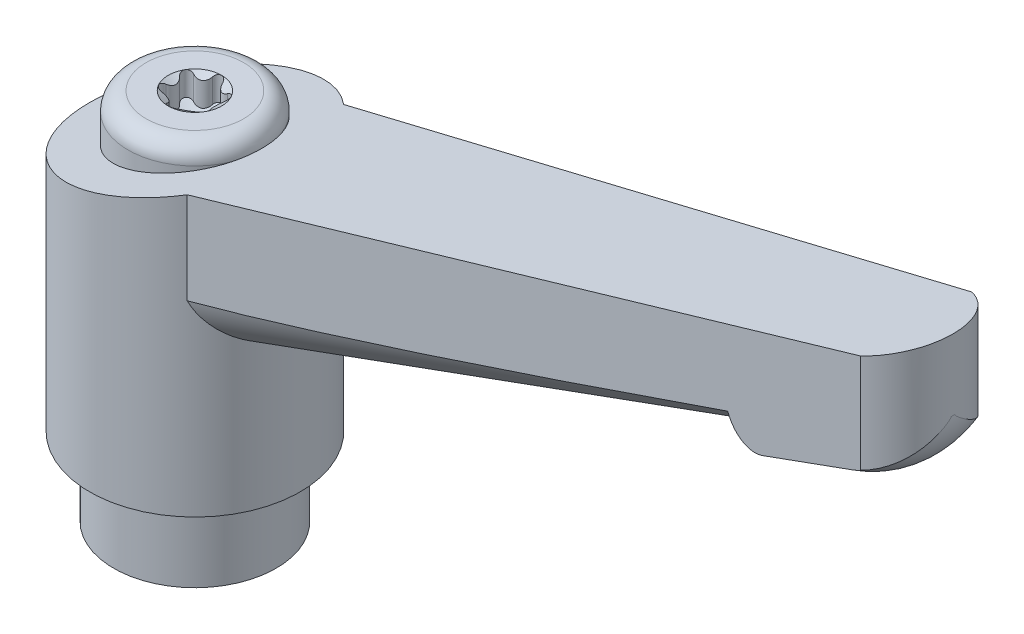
ISO-10303-21;
HEADER;
FILE_DESCRIPTION(('STEP AP214'),'2;1');
FILE_NAME('part.step','',(''),(''),'','','');
FILE_SCHEMA(('AUTOMOTIVE_DESIGN { 1 0 10303 214 1 1 1 1 }'));
ENDSEC;
DATA;
#1=APPLICATION_CONTEXT('core data for automotive mechanical design processes');
#2=APPLICATION_PROTOCOL_DEFINITION('international standard','automotive_design',2000,#1);
#3=PRODUCT_CONTEXT('',#1,'mechanical');
#4=PRODUCT('Part','Part','',(#3));
#5=PRODUCT_RELATED_PRODUCT_CATEGORY('part','',(#4));
#6=PRODUCT_DEFINITION_FORMATION('','',#4);
#7=PRODUCT_DEFINITION_CONTEXT('part definition',#1,'design');
#8=PRODUCT_DEFINITION('design','',#6,#7);
#9=PRODUCT_DEFINITION_SHAPE('','',#8);
#10=(LENGTH_UNIT() NAMED_UNIT(*) SI_UNIT(.MILLI.,.METRE.));
#11=(NAMED_UNIT(*) PLANE_ANGLE_UNIT() SI_UNIT($,.RADIAN.));
#12=(NAMED_UNIT(*) SI_UNIT($,.STERADIAN.) SOLID_ANGLE_UNIT());
#13=UNCERTAINTY_MEASURE_WITH_UNIT(LENGTH_MEASURE(1.E-05),#10,'distance_accuracy_value','');
#14=(GEOMETRIC_REPRESENTATION_CONTEXT(3) GLOBAL_UNCERTAINTY_ASSIGNED_CONTEXT((#13)) GLOBAL_UNIT_ASSIGNED_CONTEXT((#10,
#11,#12)) REPRESENTATION_CONTEXT('',''));
#15=CARTESIAN_POINT('',(0.,0.,0.));
#16=DIRECTION('',(0.,0.,1.));
#17=DIRECTION('',(1.,0.,0.));
#18=AXIS2_PLACEMENT_3D('',#15,#16,#17);
#19=CARTESIAN_POINT('',(1.53459701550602,27.,0.886000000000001));
#20=DIRECTION('',(0.,1.,0.));
#21=DIRECTION('',(0.,0.,1.));
#22=AXIS2_PLACEMENT_3D('',#19,#20,#21);
#23=CYLINDRICAL_SURFACE('',#22,0.443);
#24=DIRECTION('',(0.,1.,0.));
#25=VECTOR('',#24,1.);
#26=CARTESIAN_POINT('',(1.83864943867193,27.,0.563818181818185));
#27=LINE('',#26,#25);
#28=CARTESIAN_POINT('',(1.83864943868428,28.8315028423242,0.563818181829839));
#29=VERTEX_POINT('',#28);
#30=CARTESIAN_POINT('',(1.83864943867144,30.8315028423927,0.563818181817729));
#31=VERTEX_POINT('',#30);
#32=EDGE_CURVE('E190',#29,#31,#27,.T.);
#33=ORIENTED_EDGE('',*,*,#32,.F.);
#34=CARTESIAN_POINT('',(1.40760557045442,28.8315028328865,1.31040802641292));
#35=CARTESIAN_POINT('',(1.43210071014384,28.8447477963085,1.31775635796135));
#36=CARTESIAN_POINT('',(1.45748061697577,28.857597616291,1.32301894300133));
#37=CARTESIAN_POINT('',(1.50939354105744,28.8822631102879,1.32905299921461));
#38=CARTESIAN_POINT('',(1.53593128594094,28.8940738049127,1.32980389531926));
#39=CARTESIAN_POINT('',(1.58939185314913,28.916326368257,1.32641640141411));
#40=CARTESIAN_POINT('',(1.6163156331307,28.9267637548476,1.32226242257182));
#41=CARTESIAN_POINT('',(1.6694679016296,28.945880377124,1.30885630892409));
#42=CARTESIAN_POINT('',(1.69569771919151,28.9545632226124,1.29961479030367));
#43=CARTESIAN_POINT('',(1.74416106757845,28.9691875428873,1.27712730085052));
#44=CARTESIAN_POINT('',(1.76654208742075,28.9753049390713,1.26431433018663));
#45=CARTESIAN_POINT('',(1.80902319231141,28.9856214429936,1.23472360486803));
#46=CARTESIAN_POINT('',(1.82912382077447,28.9898210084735,1.217946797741));
#47=CARTESIAN_POINT('',(1.8644468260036,28.9958358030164,1.18266742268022));
#48=CARTESIAN_POINT('',(1.87995072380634,28.9978388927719,1.16447789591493));
#49=CARTESIAN_POINT('',(1.90786323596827,29.0000666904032,1.12577049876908));
#50=CARTESIAN_POINT('',(1.92027330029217,29.0002922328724,1.10525372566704));
#51=CARTESIAN_POINT('',(1.94108819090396,28.9989909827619,1.06356864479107));
#52=CARTESIAN_POINT('',(1.94965709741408,28.9975480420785,1.04247927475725));
#53=CARTESIAN_POINT('',(1.96343610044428,28.993092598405,0.99939142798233));
#54=CARTESIAN_POINT('',(1.96864617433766,28.9900800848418,0.977392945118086));
#55=CARTESIAN_POINT('',(1.97568144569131,28.9825486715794,0.932944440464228));
#56=CARTESIAN_POINT('',(1.97748072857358,28.9780185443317,0.910492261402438));
#57=CARTESIAN_POINT('',(1.97770242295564,28.9675868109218,0.865898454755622));
#58=CARTESIAN_POINT('',(1.97612450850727,28.9616850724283,0.843756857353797));
#59=CARTESIAN_POINT('',(1.96960698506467,28.9482940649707,0.799093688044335));
#60=CARTESIAN_POINT('',(1.96448424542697,28.940734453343,0.776620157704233));
#61=CARTESIAN_POINT('',(1.9510022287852,28.9244342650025,0.733110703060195));
#62=CARTESIAN_POINT('',(1.94264047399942,28.9156927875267,0.712075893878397));
#63=CARTESIAN_POINT('',(1.92216028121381,28.896380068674,0.670039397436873));
#64=CARTESIAN_POINT('',(1.9097697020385,28.8857147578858,0.649214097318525));
#65=CARTESIAN_POINT('',(1.88209462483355,28.8634511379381,0.610200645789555));
#66=CARTESIAN_POINT('',(1.86681439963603,28.851854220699,0.592008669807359));
#67=CARTESIAN_POINT('',(1.8465126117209,28.8371252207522,0.571376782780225));
#68=CARTESIAN_POINT('',(1.84261149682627,28.8343227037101,0.567556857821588));
#69=CARTESIAN_POINT('',(1.83864943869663,28.831502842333,0.563818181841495));
#70=B_SPLINE_CURVE_WITH_KNOTS('',3,(#34,#35,#36,#37,#38,#39,#40,#41,#42,#43,#44,#45,#46,#47,#48,
#49,#50,#51,#52,#53,#54,#55,#56,#57,#58,#59,#60,#61,#62,#63,#64,#65,#66,#67,#68,#69),
.UNSPECIFIED.,.F.,.F.,(4,2,2,2,2,2,2,2,2,2,2,2,2,2,2,2,2,4),(0.,0.0863713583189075,
0.173136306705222,0.260177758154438,0.347038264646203,0.426115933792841,0.505174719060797,
0.576760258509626,0.648312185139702,0.71641889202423,0.784526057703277,0.853148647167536,
0.921777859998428,0.99424651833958,1.06677072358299,1.14587928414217,1.22487177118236,
1.24327909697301),.UNSPECIFIED.);
#71=CARTESIAN_POINT('',(1.40760557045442,28.8315028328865,1.31040802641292));
#72=VERTEX_POINT('',#71);
#73=EDGE_CURVE('E191',#72,#29,#70,.T.);
#74=ORIENTED_EDGE('',*,*,#73,.F.);
#75=DIRECTION('',(0.,1.,0.));
#76=VECTOR('',#75,1.);
#77=CARTESIAN_POINT('',(1.40760557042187,27.,1.31040802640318));
#78=LINE('',#77,#76);
#79=CARTESIAN_POINT('',(1.40760557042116,30.8315028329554,1.31040802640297));
#80=VERTEX_POINT('',#79);
#81=EDGE_CURVE('E217',#80,#72,#78,.F.);
#82=ORIENTED_EDGE('',*,*,#81,.F.);
#83=CARTESIAN_POINT('',(1.91824626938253,31.0000000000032,1.1075));
#84=CARTESIAN_POINT('',(1.906667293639,31.0000094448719,1.12761045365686));
#85=CARTESIAN_POINT('',(1.89347208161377,30.9991586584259,1.14676721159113));
#86=CARTESIAN_POINT('',(1.86439253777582,30.9958118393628,1.1826633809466));
#87=CARTESIAN_POINT('',(1.84851632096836,30.993320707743,1.19940981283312));
#88=CARTESIAN_POINT('',(1.81454830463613,30.9867685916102,1.23009586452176));
#89=CARTESIAN_POINT('',(1.79645716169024,30.9827080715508,1.24403631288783));
#90=CARTESIAN_POINT('',(1.75862707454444,30.9731405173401,1.26884607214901));
#91=CARTESIAN_POINT('',(1.73888757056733,30.9676329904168,1.27971433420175));
#92=CARTESIAN_POINT('',(1.69766423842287,30.9551138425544,1.29853923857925));
#93=CARTESIAN_POINT('',(1.67614422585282,30.9480582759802,1.3063869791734));
#94=CARTESIAN_POINT('',(1.63255624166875,30.9327355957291,1.31862689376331));
#95=CARTESIAN_POINT('',(1.61048794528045,30.9244677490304,1.32301696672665));
#96=CARTESIAN_POINT('',(1.56443830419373,30.9061413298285,1.32865366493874));
#97=CARTESIAN_POINT('',(1.54045694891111,30.8959896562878,1.32959482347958));
#98=CARTESIAN_POINT('',(1.49312012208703,30.8747062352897,1.32768899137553));
#99=CARTESIAN_POINT('',(1.46976415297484,30.8635752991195,1.32484510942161));
#100=CARTESIAN_POINT('',(1.43363861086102,30.8453326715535,1.31755783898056));
#101=CARTESIAN_POINT('',(1.42050076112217,30.8384715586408,1.31426920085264));
#102=CARTESIAN_POINT('',(1.40760557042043,30.831502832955,1.31040802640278));
#103=B_SPLINE_CURVE_WITH_KNOTS('',3,(#83,#84,#85,#86,#87,#88,#89,#90,#91,#92,#93,#94,#95,#96,
#97,#98,#99,#100,#101,#102),.UNSPECIFIED.,.F.,.F.,(4,2,2,2,2,2,2,2,2,4),(0.,0.0695001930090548,
0.138793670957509,0.208066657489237,0.277363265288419,0.348965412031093,0.420611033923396,
0.498467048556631,0.576259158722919,0.621744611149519),.UNSPECIFIED.);
#104=CARTESIAN_POINT('',(1.91824626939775,31.0000000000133,1.10750000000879));
#105=VERTEX_POINT('',#104);
#106=EDGE_CURVE('E20',#105,#80,#103,.T.);
#107=ORIENTED_EDGE('',*,*,#106,.F.);
#108=CARTESIAN_POINT('',(1.83864943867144,30.8315028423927,0.56381818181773));
#109=CARTESIAN_POINT('',(1.8572576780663,30.844745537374,0.581354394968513));
#110=CARTESIAN_POINT('',(1.87450246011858,30.8575932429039,0.600699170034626));
#111=CARTESIAN_POINT('',(1.90568571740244,30.8822591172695,0.642639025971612));
#112=CARTESIAN_POINT('',(1.91960758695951,30.894071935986,0.665249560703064));
#113=CARTESIAN_POINT('',(1.94340691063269,30.916326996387,0.713246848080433));
#114=CARTESIAN_POINT('',(1.95327180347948,30.9267649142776,0.738641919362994));
#115=CARTESIAN_POINT('',(1.96823731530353,30.9458813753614,0.791376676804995));
#116=CARTESIAN_POINT('',(1.97334832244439,30.9545637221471,0.818711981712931));
#117=CARTESIAN_POINT('',(1.97810579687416,30.9691889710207,0.871929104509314));
#118=CARTESIAN_POINT('',(1.97819974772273,30.9753073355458,0.897722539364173));
#119=CARTESIAN_POINT('',(1.97381135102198,30.9856234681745,0.949310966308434));
#120=CARTESIAN_POINT('',(1.96933204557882,30.9898225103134,0.975105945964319));
#121=CARTESIAN_POINT('',(1.95758987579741,30.9953007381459,1.01903441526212));
#122=CARTESIAN_POINT('',(1.95137244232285,30.9970578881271,1.03739460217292));
#123=CARTESIAN_POINT('',(1.93656393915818,30.9994094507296,1.07321574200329));
#124=CARTESIAN_POINT('',(1.92797210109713,31.0000034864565,1.09067640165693));
#125=CARTESIAN_POINT('',(1.91824626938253,31.0000000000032,1.1075));
#126=B_SPLINE_CURVE_WITH_KNOTS('',3,(#108,#109,#110,#111,#112,#113,#114,#115,#116,#117,#118,
#119,#120,#121,#122,#123,#124,#125),.UNSPECIFIED.,.F.,.F.,(4,2,2,2,2,2,2,2,4),(0.,
0.0863566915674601,0.173136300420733,0.260182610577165,0.347038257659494,0.42613277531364,
0.505174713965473,0.563374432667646,0.621593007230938),.UNSPECIFIED.);
#127=EDGE_CURVE('E178',#31,#105,#126,.T.);
#128=ORIENTED_EDGE('',*,*,#127,.F.);
#129=EDGE_LOOP('',(#33,#74,#82,#107,#128));
#130=FACE_BOUND('',#129,.T.);
#131=ADVANCED_FACE('F16',(#130),#23,.F.);
#132=CARTESIAN_POINT('',(2.37074117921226,27.,0.));
#133=DIRECTION('',(0.,1.,0.));
#134=DIRECTION('',(0.,0.,1.));
#135=AXIS2_PLACEMENT_3D('',#132,#133,#134);
#136=CYLINDRICAL_SURFACE('',#135,0.77525);
#137=DIRECTION('',(0.,1.,0.));
#138=VECTOR('',#137,1.);
#139=CARTESIAN_POINT('',(1.83864943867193,27.,-0.56381818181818));
#140=LINE('',#139,#138);
#141=CARTESIAN_POINT('',(1.83864943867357,30.8315028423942,-0.56381818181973));
#142=VERTEX_POINT('',#141);
#143=CARTESIAN_POINT('',(1.83864943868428,28.8315028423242,-0.563818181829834));
#144=VERTEX_POINT('',#143);
#145=EDGE_CURVE('E424',#142,#144,#140,.F.);
#146=ORIENTED_EDGE('',*,*,#145,.T.);
#147=CARTESIAN_POINT('',(1.83864943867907,28.8315028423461,-0.563818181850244));
#148=CARTESIAN_POINT('',(1.80915300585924,28.8105445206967,-0.53598682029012));
#149=CARTESIAN_POINT('',(1.7814886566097,28.7902259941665,-0.505493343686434));
#150=CARTESIAN_POINT('',(1.73058626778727,28.751896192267,-0.439285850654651));
#151=CARTESIAN_POINT('',(1.70738543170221,28.7339046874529,-0.403531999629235));
#152=CARTESIAN_POINT('',(1.67019355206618,28.7044191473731,-0.333946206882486));
#153=CARTESIAN_POINT('',(1.65530380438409,28.6923395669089,-0.300849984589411));
#154=CARTESIAN_POINT('',(1.630122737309,28.6716281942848,-0.232021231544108));
#155=CARTESIAN_POINT('',(1.61981761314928,28.6629860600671,-0.196296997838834));
#156=CARTESIAN_POINT('',(1.60432487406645,28.6498980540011,-0.122654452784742));
#157=CARTESIAN_POINT('',(1.59918123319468,28.6454882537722,-0.0847201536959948));
#158=CARTESIAN_POINT('',(1.59459047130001,28.6415559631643,-0.00824210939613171));
#159=CARTESIAN_POINT('',(1.59514288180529,28.6420330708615,0.030301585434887));
#160=CARTESIAN_POINT('',(1.60146702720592,28.6474413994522,0.101762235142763));
#161=CARTESIAN_POINT('',(1.60658332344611,28.6518131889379,0.134784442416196));
#162=CARTESIAN_POINT('',(1.62082381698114,28.6638273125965,0.199321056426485));
#163=CARTESIAN_POINT('',(1.62994854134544,28.6714700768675,0.230835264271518));
#164=CARTESIAN_POINT('',(1.65234234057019,28.6899169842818,0.293391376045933));
#165=CARTESIAN_POINT('',(1.66580585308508,28.7008675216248,0.32431922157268));
#166=CARTESIAN_POINT('',(1.69616628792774,28.7250583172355,0.383495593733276));
#167=CARTESIAN_POINT('',(1.71306681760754,28.7383009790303,0.411741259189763));
#168=CARTESIAN_POINT('',(1.74731799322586,28.7645480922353,0.461676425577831));
#169=CARTESIAN_POINT('',(1.76429766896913,28.777341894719,0.483735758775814));
#170=CARTESIAN_POINT('',(1.80012754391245,28.8038211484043,0.525514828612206));
#171=CARTESIAN_POINT('',(1.81897016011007,28.8175029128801,0.545243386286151));
#172=CARTESIAN_POINT('',(1.83864943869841,28.8315028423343,0.563818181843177));
#173=B_SPLINE_CURVE_WITH_KNOTS('',3,(#147,#148,#149,#150,#151,#152,#153,#154,#155,#156,#157,
#158,#159,#160,#161,#162,#163,#164,#165,#166,#167,#168,#169,#170,#171,#172),.UNSPECIFIED.,.F.,
.F.,(4,2,2,2,2,2,2,2,2,2,2,2,4),(0.,0.137065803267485,0.275228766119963,0.389514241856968,
0.503453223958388,0.618354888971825,0.733247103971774,0.833898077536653,0.934562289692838,
1.04057496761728,1.146699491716,1.23845086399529,1.32984304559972),.UNSPECIFIED.);
#174=EDGE_CURVE('E250',#144,#29,#173,.T.);
#175=ORIENTED_EDGE('',*,*,#174,.T.);
#176=ORIENTED_EDGE('',*,*,#32,.T.);
#177=CARTESIAN_POINT('',(1.83864943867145,30.8315028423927,0.563818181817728));
#178=CARTESIAN_POINT('',(1.80915300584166,30.8105445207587,0.535986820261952));
#179=CARTESIAN_POINT('',(1.78148865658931,30.7902259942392,0.505493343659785));
#180=CARTESIAN_POINT('',(1.73058626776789,30.7518961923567,0.439285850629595));
#181=CARTESIAN_POINT('',(1.70738543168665,30.7339046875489,0.403531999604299));
#182=CARTESIAN_POINT('',(1.67019355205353,30.704419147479,0.333946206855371));
#183=CARTESIAN_POINT('',(1.65530380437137,30.6923395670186,0.300849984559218));
#184=CARTESIAN_POINT('',(1.63012273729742,30.6716281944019,0.232021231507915));
#185=CARTESIAN_POINT('',(1.61981761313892,30.6629860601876,0.196296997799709));
#186=CARTESIAN_POINT('',(1.60432487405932,30.6498980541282,0.122654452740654));
#187=CARTESIAN_POINT('',(1.59918123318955,30.6454882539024,0.0847201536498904));
#188=CARTESIAN_POINT('',(1.5945904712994,30.6415559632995,0.00824210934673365));
#189=CARTESIAN_POINT('',(1.5951428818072,30.6420330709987,-0.0303015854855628));
#190=CARTESIAN_POINT('',(1.60146702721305,30.6474413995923,-0.101762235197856));
#191=CARTESIAN_POINT('',(1.60658332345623,30.6518131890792,-0.134784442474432));
#192=CARTESIAN_POINT('',(1.62082381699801,30.6638273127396,-0.199321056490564));
#193=CARTESIAN_POINT('',(1.62994854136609,30.6714700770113,-0.230835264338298));
#194=CARTESIAN_POINT('',(1.65234234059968,30.6899169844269,-0.293391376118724));
#195=CARTESIAN_POINT('',(1.66580585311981,30.7008675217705,-0.324319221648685));
#196=CARTESIAN_POINT('',(1.69616628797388,30.7250583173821,-0.383495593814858));
#197=CARTESIAN_POINT('',(1.71306681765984,30.7383009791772,-0.411741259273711));
#198=CARTESIAN_POINT('',(1.74731799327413,30.7645480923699,-0.461676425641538));
#199=CARTESIAN_POINT('',(1.76429766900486,30.7773418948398,-0.483735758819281));
#200=CARTESIAN_POINT('',(1.80012754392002,30.8038211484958,-0.525514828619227));
#201=CARTESIAN_POINT('',(1.81897016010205,30.817502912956,-0.545243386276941));
#202=CARTESIAN_POINT('',(1.83864943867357,30.8315028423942,-0.56381818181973));
#203=B_SPLINE_CURVE_WITH_KNOTS('',3,(#177,#178,#179,#180,#181,#182,#183,#184,#185,#186,#187,
#188,#189,#190,#191,#192,#193,#194,#195,#196,#197,#198,#199,#200,#201,#202),.UNSPECIFIED.,.F.,
.F.,(4,2,2,2,2,2,2,2,2,2,2,2,4),(0.,0.137065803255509,0.275228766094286,0.389514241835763,
0.50345322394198,0.618354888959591,0.733247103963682,0.833898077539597,0.93456228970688,
1.04057496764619,1.14669949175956,1.23845086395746,1.32984304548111),.UNSPECIFIED.);
#204=EDGE_CURVE('E184',#31,#142,#203,.T.);
#205=ORIENTED_EDGE('',*,*,#204,.T.);
#206=EDGE_LOOP('',(#146,#175,#176,#205));
#207=FACE_BOUND('',#206,.T.);
#208=ADVANCED_FACE('F360',(#207),#136,.T.);
#209=CARTESIAN_POINT('',(1.18537058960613,27.,2.0531220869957));
#210=DIRECTION('',(0.,1.,0.));
#211=DIRECTION('',(0.,0.,1.));
#212=AXIS2_PLACEMENT_3D('',#209,#210,#211);
#213=CYLINDRICAL_SURFACE('',#212,0.775250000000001);
#214=ORIENTED_EDGE('',*,*,#81,.T.);
#215=CARTESIAN_POINT('',(1.40760557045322,28.8315028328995,1.31040802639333));
#216=CARTESIAN_POINT('',(1.36875468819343,28.8105445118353,1.29877904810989));
#217=CARTESIAN_POINT('',(1.32851438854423,28.7902259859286,1.29006775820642));
#218=CARTESIAN_POINT('',(1.2457258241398,28.751896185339,1.2790887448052));
#219=CARTESIAN_POINT('',(1.20316166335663,28.7339046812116,1.27687315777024));
#220=CARTESIAN_POINT('',(1.12430266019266,28.7044191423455,1.27945694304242));
#221=CARTESIAN_POINT('',(1.08819561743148,28.6923395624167,1.28311015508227));
#222=CARTESIAN_POINT('',(1.0159976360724,28.6716281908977,1.29571708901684));
#223=CARTESIAN_POINT('',(0.979906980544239,28.6629860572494,1.30465470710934));
#224=CARTESIAN_POINT('',(0.90838429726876,28.6498980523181,1.32805887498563));
#225=CARTESIAN_POINT('',(0.872960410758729,28.6454882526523,1.34257150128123));
#226=CARTESIAN_POINT('',(0.804433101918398,28.641555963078,1.37683480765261));
#227=CARTESIAN_POINT('',(0.77132948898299,28.6420330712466,1.39658505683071));
#228=CARTESIAN_POINT('',(0.712604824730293,28.6474414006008,1.43779225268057));
#229=CARTESIAN_POINT('',(0.686564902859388,28.6518131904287,1.45873419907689));
#230=CARTESIAN_POINT('',(0.637794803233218,28.6638273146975,1.50333513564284));
#231=CARTESIAN_POINT('',(0.615065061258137,28.6714700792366,1.52699448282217));
#232=CARTESIAN_POINT('',(0.572086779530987,28.6899169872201,1.57766613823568));
#233=CARTESIAN_POINT('',(0.552034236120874,28.7008675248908,1.60478980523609));
#234=CARTESIAN_POINT('',(0.515966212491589,28.7250583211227,1.66067089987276));
#235=CARTESIAN_POINT('',(0.499955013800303,28.7383009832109,1.68943002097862));
#236=CARTESIAN_POINT('',(0.473835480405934,28.7645480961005,1.74405999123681));
#237=CARTESIAN_POINT('',(0.46322137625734,28.777341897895,1.76979448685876));
#238=CARTESIAN_POINT('',(0.444954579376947,28.8038211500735,1.82171360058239));
#239=CARTESIAN_POINT('',(0.437290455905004,28.8175029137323,1.84789606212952));
#240=CARTESIAN_POINT('',(0.431043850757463,28.8315028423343,1.87422621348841));
#241=B_SPLINE_CURVE_WITH_KNOTS('',3,(#215,#216,#217,#218,#219,#220,#221,#222,#223,#224,#225,
#226,#227,#228,#229,#230,#231,#232,#233,#234,#235,#236,#237,#238,#239,#240),.UNSPECIFIED.,.F.,
.F.,(4,2,2,2,2,2,2,2,2,2,2,2,4),(0.,0.137065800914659,0.275228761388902,0.38951423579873,
0.503453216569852,0.618354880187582,0.733247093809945,0.833898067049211,0.934562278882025,
1.04057495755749,1.14669948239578,1.23845084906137,1.32984302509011),.UNSPECIFIED.);
#242=CARTESIAN_POINT('',(0.431043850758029,28.831502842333,1.87422621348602));
#243=VERTEX_POINT('',#242);
#244=EDGE_CURVE('E338',#72,#243,#241,.T.);
#245=ORIENTED_EDGE('',*,*,#244,.T.);
#246=DIRECTION('',(0.,1.,0.));
#247=VECTOR('',#246,1.);
#248=CARTESIAN_POINT('',(0.431043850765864,27.,1.87422621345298));
#249=LINE('',#248,#247);
#250=CARTESIAN_POINT('',(0.431043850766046,30.8315028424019,1.87422621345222));
#251=VERTEX_POINT('',#250);
#252=EDGE_CURVE('E395',#243,#251,#249,.T.);
#253=ORIENTED_EDGE('',*,*,#252,.T.);
#254=CARTESIAN_POINT('',(0.431043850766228,30.8315028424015,1.87422621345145));
#255=CARTESIAN_POINT('',(0.440398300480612,30.8105445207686,1.83476587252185));
#256=CARTESIAN_POINT('',(0.452974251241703,30.7902259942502,1.79556110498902));
#257=CARTESIAN_POINT('',(0.484860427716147,30.7518961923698,1.71837459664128));
#258=CARTESIAN_POINT('',(0.504223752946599,30.733904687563,1.6804051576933));
#259=CARTESIAN_POINT('',(0.545890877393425,30.7044191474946,1.61340314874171));
#260=CARTESIAN_POINT('',(0.567108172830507,30.6923395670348,1.58396013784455));
#261=CARTESIAN_POINT('',(0.614125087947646,30.671628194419,1.52773831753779));
#262=CARTESIAN_POINT('',(0.639910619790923,30.6629860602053,1.50095170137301));
#263=CARTESIAN_POINT('',(0.695940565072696,30.6498980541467,1.45071332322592));
#264=CARTESIAN_POINT('',(0.726220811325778,30.6454882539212,1.42729165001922));
#265=CARTESIAN_POINT('',(0.790157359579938,30.6415559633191,1.38507691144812));
#266=CARTESIAN_POINT('',(0.823813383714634,30.6420330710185,1.36628346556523));
#267=CARTESIAN_POINT('',(0.888862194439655,30.6474413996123,1.33603001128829));
#268=CARTESIAN_POINT('',(0.920018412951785,30.6518131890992,1.32394975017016));
#269=CARTESIAN_POINT('',(0.983029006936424,30.6638273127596,1.3040140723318));
#270=CARTESIAN_POINT('',(1.01488347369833,30.6714700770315,1.29615921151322));
#271=CARTESIAN_POINT('',(1.08025555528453,30.6899169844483,1.2842747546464));
#272=CARTESIAN_POINT('',(1.11377161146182,30.7008675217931,1.28047057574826));
#273=CARTESIAN_POINT('',(1.18020007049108,30.7250583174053,1.27717529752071));
#274=CARTESIAN_POINT('',(1.2131117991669,30.7383009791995,1.2776887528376));
#275=CARTESIAN_POINT('',(1.27348250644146,30.7645480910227,1.28238355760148));
#276=CARTESIAN_POINT('',(1.30107628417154,30.7773418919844,1.28605872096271));
#277=CARTESIAN_POINT('',(1.35517295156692,30.8038211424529,1.29619876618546));
#278=CARTESIAN_POINT('',(1.38167968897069,30.8175029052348,1.3026526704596));
#279=CARTESIAN_POINT('',(1.40760557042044,30.831502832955,1.31040802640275));
#280=B_SPLINE_CURVE_WITH_KNOTS('',3,(#254,#255,#256,#257,#258,#259,#260,#261,#262,#263,#264,
#265,#266,#267,#268,#269,#270,#271,#272,#273,#274,#275,#276,#277,#278,#279),.UNSPECIFIED.,.F.,
.F.,(4,2,2,2,2,2,2,2,2,2,2,2,4),(0.,0.137065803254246,0.275228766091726,0.389514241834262,
0.503453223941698,0.618354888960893,0.733247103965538,0.833898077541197,0.934562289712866,
1.04057496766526,1.14669949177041,1.23845085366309,1.32984302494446),.UNSPECIFIED.);
#281=EDGE_CURVE('E351',#251,#80,#280,.T.);
#282=ORIENTED_EDGE('',*,*,#281,.T.);
#283=EDGE_LOOP('',(#214,#245,#253,#282));
#284=FACE_BOUND('',#283,.T.);
#285=ADVANCED_FACE('F356',(#284),#213,.T.);
#286=CARTESIAN_POINT('',(1.53459701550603,27.,-0.886));
#287=DIRECTION('',(0.,1.,0.));
#288=DIRECTION('',(0.,0.,1.));
#289=AXIS2_PLACEMENT_3D('',#286,#287,#288);
#290=CYLINDRICAL_SURFACE('',#289,0.443);
#291=DIRECTION('',(0.,1.,0.));
#292=VECTOR('',#291,1.);
#293=CARTESIAN_POINT('',(1.40760558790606,27.,-1.31040803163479));
#294=LINE('',#293,#292);
#295=CARTESIAN_POINT('',(1.40760558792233,28.8315028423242,-1.31040803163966));
#296=VERTEX_POINT('',#295);
#297=CARTESIAN_POINT('',(1.40760558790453,30.8315028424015,-1.31040803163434));
#298=VERTEX_POINT('',#297);
#299=EDGE_CURVE('E394',#296,#298,#294,.T.);
#300=ORIENTED_EDGE('',*,*,#299,.F.);
#301=CARTESIAN_POINT('',(1.83864943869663,28.831502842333,-0.563818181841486));
#302=CARTESIAN_POINT('',(1.85726084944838,28.844747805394,-0.581357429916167));
#303=CARTESIAN_POINT('',(1.87450833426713,28.8575976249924,-0.600705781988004));
#304=CARTESIAN_POINT('',(1.90569044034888,28.8822631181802,-0.642646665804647));
#305=CARTESIAN_POINT('',(1.91960960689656,28.8940738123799,-0.665253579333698));
#306=CARTESIAN_POINT('',(1.94340623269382,28.9163263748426,-0.713245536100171));
#307=CARTESIAN_POINT('',(1.95327067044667,28.9267637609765,-0.738639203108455));
#308=CARTESIAN_POINT('',(1.96823676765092,28.9458803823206,-0.791373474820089));
#309=CARTESIAN_POINT('',(1.9733482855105,28.9545632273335,-0.81870992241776));
#310=CARTESIAN_POINT('',(1.97810522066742,28.9691875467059,-0.871924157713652));
#311=CARTESIAN_POINT('',(1.97819937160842,28.975304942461,-0.897713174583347));
#312=CARTESIAN_POINT('',(1.97381360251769,28.9856214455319,-0.949298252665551));
#313=CARTESIAN_POINT('',(1.96933477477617,28.9898210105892,-0.975094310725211));
#314=CARTESIAN_POINT('',(1.95644344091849,28.9958358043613,-1.02332461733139));
#315=CARTESIAN_POINT('',(1.94844279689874,28.9978388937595,-1.04584614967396));
#316=CARTESIAN_POINT('',(1.92887746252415,29.0000666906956,-1.08937279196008));
#317=CARTESIAN_POINT('',(1.91731444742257,29.0002922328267,-1.11037860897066));
#318=CARTESIAN_POINT('',(1.89162155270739,28.9989909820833,-1.14924737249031));
#319=CARTESIAN_POINT('',(1.87764207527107,28.9975480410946,-1.16721294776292));
#320=CARTESIAN_POINT('',(1.84721640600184,28.9930925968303,-1.20068983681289));
#321=CARTESIAN_POINT('',(1.8307701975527,28.9900800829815,-1.21620113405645));
#322=CARTESIAN_POINT('',(1.79579429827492,28.982548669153,-1.24451810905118));
#323=CARTESIAN_POINT('',(1.7772497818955,28.9780185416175,-1.25730242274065));
#324=CARTESIAN_POINT('',(1.73874125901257,28.9675868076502,-1.27979131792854));
#325=CARTESIAN_POINT('',(1.71877711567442,28.9616850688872,-1.289495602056));
#326=CARTESIAN_POINT('',(1.67683891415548,28.9482940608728,-1.30618284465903));
#327=CARTESIAN_POINT('',(1.65481489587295,28.940734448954,-1.3129831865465));
#328=CARTESIAN_POINT('',(1.61039359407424,28.9244342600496,-1.32306214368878));
#329=CARTESIAN_POINT('',(1.58799603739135,28.9156927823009,-1.32633805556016));
#330=CARTESIAN_POINT('',(1.54135126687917,28.8963800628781,-1.32961993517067));
#331=CARTESIAN_POINT('',(1.51712073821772,28.8857147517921,-1.32930202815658));
#332=CARTESIAN_POINT('',(1.46949655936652,28.8634511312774,-1.32484143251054));
#333=CARTESIAN_POINT('',(1.44610173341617,28.8518542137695,-1.32070435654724));
#334=CARTESIAN_POINT('',(1.41808310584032,28.837125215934,-1.31343843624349));
#335=CARTESIAN_POINT('',(1.41282440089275,28.834322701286,-1.31196993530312));
#336=CARTESIAN_POINT('',(1.40760558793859,28.831502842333,-1.31040803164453));
#337=B_SPLINE_CURVE_WITH_KNOTS('',3,(#301,#302,#303,#304,#305,#306,#307,#308,#309,#310,#311,
#312,#313,#314,#315,#316,#317,#318,#319,#320,#321,#322,#323,#324,#325,#326,#327,#328,#329,#330,
#331,#332,#333,#334,#335,#336),.UNSPECIFIED.,.F.,.F.,(4,2,2,2,2,2,2,2,2,2,2,2,2,2,2,2,2,4),(0.,
0.0863713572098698,0.17313630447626,0.260177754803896,0.34703826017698,0.426115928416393,
0.505174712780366,0.576760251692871,0.648312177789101,0.716418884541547,0.784526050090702,
0.853148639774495,0.921777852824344,0.994246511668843,1.06677071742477,1.14587927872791,
1.22487176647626,1.24327907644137),.UNSPECIFIED.);
#338=EDGE_CURVE('E329',#144,#296,#337,.T.);
#339=ORIENTED_EDGE('',*,*,#338,.F.);
#340=ORIENTED_EDGE('',*,*,#145,.F.);
#341=CARTESIAN_POINT('',(1.91824626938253,31.0000000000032,-1.1075));
#342=CARTESIAN_POINT('',(1.92987294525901,31.0000094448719,-1.08741708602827));
#343=CARTESIAN_POINT('',(1.93986557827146,30.9991586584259,-1.06641131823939));
#344=CARTESIAN_POINT('',(1.95641280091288,30.9958118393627,-1.02327960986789));
#345=CARTESIAN_POINT('',(1.96297752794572,30.9933207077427,-1.00115718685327));
#346=CARTESIAN_POINT('',(1.97256842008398,30.9867685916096,-0.956396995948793));
#347=CARTESIAN_POINT('',(1.97559563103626,30.98270807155,-0.933759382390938));
#348=CARTESIAN_POINT('',(1.97816646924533,30.9731405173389,-0.88859268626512));
#349=CARTESIAN_POINT('',(1.9777089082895,30.9676329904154,-0.866063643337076));
#350=CARTESIAN_POINT('',(1.97340008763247,30.9551138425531,-0.820950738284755));
#351=CARTESIAN_POINT('',(1.96943642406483,30.948058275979,-0.798389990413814));
#352=CARTESIAN_POINT('',(1.95824250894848,30.9327355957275,-0.754521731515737));
#353=CARTESIAN_POINT('',(1.95101027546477,30.9244677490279,-0.733214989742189));
#354=CARTESIAN_POINT('',(1.93286697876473,30.9061413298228,-0.690516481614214));
#355=CARTESIAN_POINT('',(1.92169136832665,30.8959896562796,-0.669277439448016));
#356=CARTESIAN_POINT('',(1.89637245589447,30.8747062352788,-0.629235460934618));
#357=CARTESIAN_POINT('',(1.88223159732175,30.863575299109,-0.610430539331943));
#358=CARTESIAN_POINT('',(1.85785786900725,30.8453326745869,-0.582788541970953));
#359=CARTESIAN_POINT('',(1.84844090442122,30.8384715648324,-0.573055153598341));
#360=CARTESIAN_POINT('',(1.83864943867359,30.8315028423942,-0.563818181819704));
#361=B_SPLINE_CURVE_WITH_KNOTS('',3,(#341,#342,#343,#344,#345,#346,#347,#348,#349,#350,#351,
#352,#353,#354,#355,#356,#357,#358,#359,#360),.UNSPECIFIED.,.F.,.F.,(4,2,2,2,2,2,2,2,2,4),(0.,
0.069500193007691,0.138793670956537,0.20806665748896,0.277363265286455,0.348965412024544,
0.420611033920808,0.498467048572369,0.576259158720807,0.621744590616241),.UNSPECIFIED.);
#362=CARTESIAN_POINT('',(1.91824626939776,31.0000000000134,-1.10750000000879));
#363=VERTEX_POINT('',#362);
#364=EDGE_CURVE('E346',#363,#142,#361,.T.);
#365=ORIENTED_EDGE('',*,*,#364,.F.);
#366=CARTESIAN_POINT('',(1.40760558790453,30.8315028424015,-1.31040803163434));
#367=CARTESIAN_POINT('',(1.43209651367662,30.844745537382,-1.31775513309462));
#368=CARTESIAN_POINT('',(1.45747197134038,30.8575932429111,-1.3230171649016));
#369=CARTESIAN_POINT('',(1.50938458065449,30.8822591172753,-1.32905272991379));
#370=CARTESIAN_POINT('',(1.53592681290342,30.8940719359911,-1.32980415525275));
#371=CARTESIAN_POINT('',(1.58939334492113,30.9163269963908,-1.32641633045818));
#372=CARTESIAN_POINT('',(1.6163185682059,30.9267649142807,-1.322262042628));
#373=CARTESIAN_POINT('',(1.66947096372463,30.9458813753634,-1.30885517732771));
#374=CARTESIAN_POINT('',(1.69569953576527,30.9545637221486,-1.29961378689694));
#375=CARTESIAN_POINT('',(1.74416565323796,30.9691889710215,-1.27712531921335));
#376=CARTESIAN_POINT('',(1.76655039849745,30.9753073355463,-1.26430996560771));
#377=CARTESIAN_POINT('',(1.80903308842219,30.9856234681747,-1.23471528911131));
#378=CARTESIAN_POINT('',(1.82913254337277,30.9898225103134,-1.21793860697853));
#379=CARTESIAN_POINT('',(1.86130462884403,30.9953007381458,-1.18580535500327));
#380=CARTESIAN_POINT('',(1.87409630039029,30.9970578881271,-1.17124080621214));
#381=CARTESIAN_POINT('',(1.89771406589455,30.9994094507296,-1.14050569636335));
#382=CARTESIAN_POINT('',(1.90853952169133,31.0000034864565,-1.12433461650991));
#383=CARTESIAN_POINT('',(1.91824626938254,31.0000000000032,-1.1075));
#384=B_SPLINE_CURVE_WITH_KNOTS('',3,(#366,#367,#368,#369,#370,#371,#372,#373,#374,#375,#376,
#377,#378,#379,#380,#381,#382,#383),.UNSPECIFIED.,.F.,.F.,(4,2,2,2,2,2,2,2,4),(0.,
0.0863566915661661,0.173136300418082,0.260182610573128,0.347038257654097,0.426132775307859,
0.505174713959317,0.563374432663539,0.621593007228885),.UNSPECIFIED.);
#385=EDGE_CURVE('E415',#298,#363,#384,.T.);
#386=ORIENTED_EDGE('',*,*,#385,.F.);
#387=EDGE_LOOP('',(#300,#339,#340,#365,#386));
#388=FACE_BOUND('',#387,.T.);
#389=ADVANCED_FACE('F359',(#388),#290,.F.);
#390=CARTESIAN_POINT('',(0.,27.,1.772));
#391=DIRECTION('',(0.,1.,0.));
#392=DIRECTION('',(0.,0.,1.));
#393=AXIS2_PLACEMENT_3D('',#390,#391,#392);
#394=CYLINDRICAL_SURFACE('',#393,0.443);
#395=ORIENTED_EDGE('',*,*,#252,.F.);
#396=CARTESIAN_POINT('',(-0.431043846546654,28.8315028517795,1.87422623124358));
#397=CARTESIAN_POINT('',(-0.425160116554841,28.8447478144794,1.89911380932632));
#398=CARTESIAN_POINT('',(-0.417027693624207,28.8575976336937,1.92372474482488));
#399=CARTESIAN_POINT('',(-0.396296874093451,28.8822631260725,1.97169968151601));
#400=CARTESIAN_POINT('',(-0.383678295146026,28.8940738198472,1.99505748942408));
#401=CARTESIAN_POINT('',(-0.354014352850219,28.9163263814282,2.03966194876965));
#402=CARTESIAN_POINT('',(-0.336955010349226,28.9267637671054,2.06090163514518));
#403=CARTESIAN_POINT('',(-0.298768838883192,28.9458803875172,2.10022978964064));
#404=CARTESIAN_POINT('',(-0.277650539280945,28.9545632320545,2.11832471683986));
#405=CARTESIAN_POINT('',(-0.233944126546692,28.9691875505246,2.14905145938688));
#406=CARTESIAN_POINT('',(-0.211657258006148,28.9753049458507,2.16202750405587));
#407=CARTESIAN_POINT('',(-0.164790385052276,28.9856214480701,2.18402185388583));
#408=CARTESIAN_POINT('',(-0.140210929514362,28.989821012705,2.19304110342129));
#409=CARTESIAN_POINT('',(-0.0919965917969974,28.9958358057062,2.20599203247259));
#410=CARTESIAN_POINT('',(-0.0684920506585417,28.9978388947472,2.21032403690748));
#411=CARTESIAN_POINT('',(-0.0210142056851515,29.000066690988,2.21514327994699));
#412=CARTESIAN_POINT('',(0.0029588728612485,29.000292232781,2.21563232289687));
#413=CARTESIAN_POINT('',(0.0494666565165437,28.9989909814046,2.21281600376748));
#414=CARTESIAN_POINT('',(0.072015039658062,28.9975480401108,2.20969220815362));
#415=CARTESIAN_POINT('',(0.116219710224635,28.9930925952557,2.20008124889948));
#416=CARTESIAN_POINT('',(0.137875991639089,28.9900800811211,2.19359406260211));
#417=CARTESIAN_POINT('',(0.179887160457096,28.9825486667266,2.17746253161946));
#418=CARTESIAN_POINT('',(0.200230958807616,28.9780185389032,2.16779466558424));
#419=CARTESIAN_POINT('',(0.23896117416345,28.9675868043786,2.14568975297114));
#420=CARTESIAN_POINT('',(0.257347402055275,28.9616850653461,2.13325243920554));
#421=CARTESIAN_POINT('',(0.292768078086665,28.9482940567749,2.10527651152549));
#422=CARTESIAN_POINT('',(0.309669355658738,28.9407344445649,2.08960332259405));
#423=CARTESIAN_POINT('',(0.340608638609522,28.9244342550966,2.05617282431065));
#424=CARTESIAN_POINT('',(0.354644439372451,28.915692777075,2.03841392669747));
#425=CARTESIAN_POINT('',(0.380809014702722,28.8963800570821,1.999659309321));
#426=CARTESIAN_POINT('',(0.392648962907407,28.8857147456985,1.9785161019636));
#427=CARTESIAN_POINT('',(0.41259806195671,28.8634511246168,1.93504205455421));
#428=CARTESIAN_POINT('',(0.420712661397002,28.8518542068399,1.91271300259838));
#429=CARTESIAN_POINT('',(0.428429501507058,28.8371252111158,1.88481520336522));
#430=CARTESIAN_POINT('',(0.429787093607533,28.8343226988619,1.8795267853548));
#431=CARTESIAN_POINT('',(0.431043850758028,28.831502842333,1.87422621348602));
#432=B_SPLINE_CURVE_WITH_KNOTS('',3,(#396,#397,#398,#399,#400,#401,#402,#403,#404,#405,#406,
#407,#408,#409,#410,#411,#412,#413,#414,#415,#416,#417,#418,#419,#420,#421,#422,#423,#424,#425,
#426,#427,#428,#429,#430,#431),.UNSPECIFIED.,.F.,.F.,(4,2,2,2,2,2,2,2,2,2,2,2,2,2,2,2,2,4),(0.,
0.0863713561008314,0.173136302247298,0.260177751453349,0.347038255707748,0.426115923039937,
0.505174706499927,0.576760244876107,0.648312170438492,0.716418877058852,0.784526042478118,
0.853148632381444,0.921777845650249,0.994246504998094,1.06677071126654,1.14587927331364,
1.22487176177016,1.24327905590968),.UNSPECIFIED.);
#433=CARTESIAN_POINT('',(-0.431043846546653,28.8315028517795,1.87422623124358));
#434=VERTEX_POINT('',#433);
#435=EDGE_CURVE('E320',#434,#243,#432,.T.);
#436=ORIENTED_EDGE('',*,*,#435,.F.);
#437=DIRECTION('',(0.,1.,0.));
#438=VECTOR('',#437,1.);
#439=CARTESIAN_POINT('',(-0.431043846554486,27.,1.87422623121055));
#440=LINE('',#439,#438);
#441=CARTESIAN_POINT('',(-0.431043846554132,30.8315028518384,1.87422623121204));
#442=VERTEX_POINT('',#441);
#443=EDGE_CURVE('E1093',#442,#434,#440,.F.);
#444=ORIENTED_EDGE('',*,*,#443,.F.);
#445=CARTESIAN_POINT('',(0.,31.0000000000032,2.215));
#446=CARTESIAN_POINT('',(-0.0232056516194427,31.0000094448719,2.21502753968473));
#447=CARTESIAN_POINT('',(-0.046393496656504,30.9991586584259,2.21317852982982));
#448=CARTESIAN_POINT('',(-0.0920202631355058,30.9958118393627,2.20594299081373));
#449=CARTESIAN_POINT('',(-0.114461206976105,30.9933207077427,2.20056699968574));
#450=CARTESIAN_POINT('',(-0.158020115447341,30.9867685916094,2.18649286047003));
#451=CARTESIAN_POINT('',(-0.179138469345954,30.9827080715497,2.17779569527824));
#452=CARTESIAN_POINT('',(-0.219539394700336,30.9731405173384,2.15743875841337));
#453=CARTESIAN_POINT('',(-0.238821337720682,30.967632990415,2.14577797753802));
#454=CARTESIAN_POINT('',(-0.275735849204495,30.9551138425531,2.11948997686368));
#455=CARTESIAN_POINT('',(-0.293292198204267,30.9480582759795,2.10477696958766));
#456=CARTESIAN_POINT('',(-0.325686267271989,30.9327355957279,2.07314862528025));
#457=CARTESIAN_POINT('',(-0.340522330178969,30.9244677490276,2.05623195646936));
#458=CARTESIAN_POINT('',(-0.3684286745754,30.90614132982,2.01917014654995));
#459=CARTESIAN_POINT('',(-0.381234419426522,30.8959896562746,1.99887226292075));
#460=CARTESIAN_POINT('',(-0.403252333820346,30.8747062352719,1.95692445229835));
#461=CARTESIAN_POINT('',(-0.412467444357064,30.8635752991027,1.93527564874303));
#462=CARTESIAN_POINT('',(-0.424219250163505,30.8453326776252,1.90034638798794));
#463=CARTESIAN_POINT('',(-0.427940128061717,30.8384715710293,1.88732436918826));
#464=CARTESIAN_POINT('',(-0.43104384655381,30.8315028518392,1.87422623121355));
#465=B_SPLINE_CURVE_WITH_KNOTS('',3,(#445,#446,#447,#448,#449,#450,#451,#452,#453,#454,#455,
#456,#457,#458,#459,#460,#461,#462,#463,#464),.UNSPECIFIED.,.F.,.F.,(4,2,2,2,2,2,2,2,2,4),(0.,
0.0695001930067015,0.138793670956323,0.208066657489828,0.277363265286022,0.348965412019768,
0.42061103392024,0.49846704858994,0.57625915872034,0.621744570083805),.UNSPECIFIED.);
#466=CARTESIAN_POINT('',(0.,31.0000000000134,2.21500000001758));
#467=VERTEX_POINT('',#466);
#468=EDGE_CURVE('E409',#467,#442,#465,.T.);
#469=ORIENTED_EDGE('',*,*,#468,.F.);
#470=CARTESIAN_POINT('',(0.431043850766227,30.8315028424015,1.87422621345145));
#471=CARTESIAN_POINT('',(0.42516116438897,30.844745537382,1.89910952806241));
#472=CARTESIAN_POINT('',(0.417030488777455,30.8575932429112,1.92371633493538));
#473=CARTESIAN_POINT('',(0.396301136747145,30.8822591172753,1.97169175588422));
#474=CARTESIAN_POINT('',(0.383680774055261,30.8940719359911,1.99505371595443));
#475=CARTESIAN_POINT('',(0.354013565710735,30.9163269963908,2.03966317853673));
#476=CARTESIAN_POINT('',(0.33695323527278,30.9267649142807,2.06090396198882));
#477=CARTESIAN_POINT('',(0.298766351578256,30.9458813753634,2.10023185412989));
#478=CARTESIAN_POINT('',(0.277648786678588,30.9545637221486,2.11832576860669));
#479=CARTESIAN_POINT('',(0.233940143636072,30.9691889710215,2.14905442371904));
#480=CARTESIAN_POINT('',(0.211649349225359,30.9753073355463,2.16203250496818));
#481=CARTESIAN_POINT('',(0.164778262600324,30.9856234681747,2.1840262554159));
#482=CARTESIAN_POINT('',(0.140199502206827,30.9898225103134,2.19304455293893));
#483=CARTESIAN_POINT('',(0.0962852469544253,30.9953007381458,2.20483977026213));
#484=CARTESIAN_POINT('',(0.077276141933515,30.9970578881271,2.20863540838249));
#485=CARTESIAN_POINT('',(0.0388498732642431,30.9994094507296,2.21372143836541));
#486=CARTESIAN_POINT('',(0.0194325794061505,31.0000034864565,2.21501101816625));
#487=CARTESIAN_POINT('',(0.,31.0000000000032,2.215));
#488=B_SPLINE_CURVE_WITH_KNOTS('',3,(#470,#471,#472,#473,#474,#475,#476,#477,#478,#479,#480,
#481,#482,#483,#484,#485,#486,#487),.UNSPECIFIED.,.F.,.F.,(4,2,2,2,2,2,2,2,4),(0.,
0.0863566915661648,0.173136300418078,0.260182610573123,0.34703825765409,0.426132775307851,
0.505174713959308,0.563374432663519,0.621593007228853),.UNSPECIFIED.);
#489=EDGE_CURVE('E212',#251,#467,#488,.T.);
#490=ORIENTED_EDGE('',*,*,#489,.F.);
#491=EDGE_LOOP('',(#395,#436,#444,#469,#490));
#492=FACE_BOUND('',#491,.T.);
#493=ADVANCED_FACE('F401',(#492),#394,.F.);
#494=CARTESIAN_POINT('',(1.18537058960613,27.,-2.05312208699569));
#495=DIRECTION('',(0.,1.,0.));
#496=DIRECTION('',(0.,0.,1.));
#497=AXIS2_PLACEMENT_3D('',#494,#495,#496);
#498=CYLINDRICAL_SURFACE('',#497,0.775249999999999);
#499=DIRECTION('',(0.,1.,0.));
#500=VECTOR('',#499,1.);
#501=CARTESIAN_POINT('',(0.431043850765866,27.,-1.87422621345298));
#502=LINE('',#501,#500);
#503=CARTESIAN_POINT('',(0.431043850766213,30.8315028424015,-1.87422621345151));
#504=VERTEX_POINT('',#503);
#505=CARTESIAN_POINT('',(0.431043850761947,28.8315028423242,-1.8742262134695));
#506=VERTEX_POINT('',#505);
#507=EDGE_CURVE('E1086',#504,#506,#502,.F.);
#508=ORIENTED_EDGE('',*,*,#507,.T.);
#509=CARTESIAN_POINT('',(0.431043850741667,28.8315028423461,-1.87422621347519));
#510=CARTESIAN_POINT('',(0.440398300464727,28.8105445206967,-1.83476587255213));
#511=CARTESIAN_POINT('',(0.452974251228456,28.7902259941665,-1.79556110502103));
#512=CARTESIAN_POINT('',(0.484860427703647,28.751896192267,-1.7183745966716));
#513=CARTESIAN_POINT('',(0.504223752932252,28.7339046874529,-1.68040515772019));
#514=CARTESIAN_POINT('',(0.545890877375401,28.7044191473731,-1.61340314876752));
#515=CARTESIAN_POINT('',(0.567108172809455,28.6923395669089,-1.58396013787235));
#516=CARTESIAN_POINT('',(0.614125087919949,28.6716281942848,-1.52773831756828));
#517=CARTESIAN_POINT('',(0.63991061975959,28.6629860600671,-1.50095170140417));
#518=CARTESIAN_POINT('',(0.695940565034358,28.6498980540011,-1.45071332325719));
#519=CARTESIAN_POINT('',(0.726220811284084,28.6454882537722,-1.42729165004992));
#520=CARTESIAN_POINT('',(0.790157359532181,28.6415559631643,-1.38507691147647));
#521=CARTESIAN_POINT('',(0.8238133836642,28.6420330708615,-1.36628346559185));
#522=CARTESIAN_POINT('',(0.888862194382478,28.6474413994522,-1.33603001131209));
#523=CARTESIAN_POINT('',(0.920018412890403,28.6518131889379,-1.32394975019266));
#524=CARTESIAN_POINT('',(0.983029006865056,28.6638273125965,-1.30401407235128));
#525=CARTESIAN_POINT('',(1.01488347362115,28.6714700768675,-1.29615921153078));
#526=CARTESIAN_POINT('',(1.08025555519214,28.6899169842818,-1.28427475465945));
#527=CARTESIAN_POINT('',(1.11377161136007,28.7008675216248,-1.28047057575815));
#528=CARTESIAN_POINT('',(1.18020007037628,28.7250583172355,-1.27717529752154));
#529=CARTESIAN_POINT('',(1.2131117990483,28.7383009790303,-1.27768875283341));
#530=CARTESIAN_POINT('',(1.27348250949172,28.7645480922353,-1.28238355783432));
#531=CARTESIAN_POINT('',(1.30107629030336,28.777341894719,-1.28605872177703));
#532=CARTESIAN_POINT('',(1.35517296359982,28.8038211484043,-1.29619876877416));
#533=CARTESIAN_POINT('',(1.38167970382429,28.8175029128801,-1.30265267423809));
#534=CARTESIAN_POINT('',(1.40760558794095,28.8315028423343,-1.31040803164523));
#535=B_SPLINE_CURVE_WITH_KNOTS('',3,(#509,#510,#511,#512,#513,#514,#515,#516,#517,#518,#519,
#520,#521,#522,#523,#524,#525,#526,#527,#528,#529,#530,#531,#532,#533,#534),.UNSPECIFIED.,.F.,
.F.,(4,2,2,2,2,2,2,2,2,2,2,2,4),(0.,0.137065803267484,0.275228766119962,0.389514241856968,
0.503453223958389,0.618354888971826,0.733247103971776,0.833898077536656,0.93456228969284,
1.04057496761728,1.146699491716,1.23845086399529,1.32984304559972),.UNSPECIFIED.);
#536=EDGE_CURVE('E311',#506,#296,#535,.T.);
#537=ORIENTED_EDGE('',*,*,#536,.T.);
#538=ORIENTED_EDGE('',*,*,#299,.T.);
#539=CARTESIAN_POINT('',(1.40760558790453,30.8315028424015,-1.31040803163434));
#540=CARTESIAN_POINT('',(1.3687547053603,30.8105445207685,-1.29877905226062));
#541=CARTESIAN_POINT('',(1.32851440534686,30.7902259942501,-1.29006776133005));
#542=CARTESIAN_POINT('',(1.24572584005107,30.7518961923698,-1.27908874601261));
#543=CARTESIAN_POINT('',(1.20316167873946,30.733904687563,-1.27687315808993));
#544=CARTESIAN_POINT('',(1.12430267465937,30.7044191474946,-1.27945694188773));
#545=CARTESIAN_POINT('',(1.08819563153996,30.6923395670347,-1.28311015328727));
#546=CARTESIAN_POINT('',(1.01599764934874,30.671628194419,-1.29571708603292));
#547=CARTESIAN_POINT('',(0.979906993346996,30.6629860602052,-1.30465470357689));
#548=CARTESIAN_POINT('',(0.908384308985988,30.6498980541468,-1.32805887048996));
#549=CARTESIAN_POINT('',(0.872960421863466,30.6454882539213,-1.34257149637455));
#550=CARTESIAN_POINT('',(0.804433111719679,30.6415559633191,-1.37683480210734));
#551=CARTESIAN_POINT('',(0.77132949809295,30.6420330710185,-1.396585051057));
#552=CARTESIAN_POINT('',(0.712604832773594,30.6474413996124,-1.43779224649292));
#553=CARTESIAN_POINT('',(0.686564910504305,30.6518131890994,-1.45873419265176));
#554=CARTESIAN_POINT('',(0.637794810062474,30.66382731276,-1.5033351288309));
#555=CARTESIAN_POINT('',(0.61506506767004,30.6714700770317,-1.52699447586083));
#556=CARTESIAN_POINT('',(0.572086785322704,30.6899169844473,-1.57766613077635));
#557=CARTESIAN_POINT('',(0.552034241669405,30.700867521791,-1.60478979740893));
#558=CARTESIAN_POINT('',(0.515966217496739,30.7250583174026,-1.66067089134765));
#559=CARTESIAN_POINT('',(0.499955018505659,30.7383009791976,-1.68943001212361));
#560=CARTESIAN_POINT('',(0.473835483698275,30.7645480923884,-1.74405998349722));
#561=CARTESIAN_POINT('',(0.4632213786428,30.7773418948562,-1.76979448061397));
#562=CARTESIAN_POINT('',(0.444954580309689,30.8038211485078,-1.82171359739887));
#563=CARTESIAN_POINT('',(0.437290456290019,30.8175029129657,-1.84789606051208));
#564=CARTESIAN_POINT('',(0.431043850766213,30.8315028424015,-1.87422621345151));
#565=B_SPLINE_CURVE_WITH_KNOTS('',3,(#539,#540,#541,#542,#543,#544,#545,#546,#547,#548,#549,
#550,#551,#552,#553,#554,#555,#556,#557,#558,#559,#560,#561,#562,#563,#564),.UNSPECIFIED.,.F.,
.F.,(4,2,2,2,2,2,2,2,2,2,2,2,4),(0.,0.137065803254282,0.27522876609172,0.389514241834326,
0.503453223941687,0.61835488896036,0.733247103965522,0.8338980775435,0.934562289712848,
1.0405749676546,1.1466994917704,1.23845086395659,1.32984304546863),.UNSPECIFIED.);
#566=EDGE_CURVE('E396',#298,#504,#565,.T.);
#567=ORIENTED_EDGE('',*,*,#566,.T.);
#568=EDGE_LOOP('',(#508,#537,#538,#567));
#569=FACE_BOUND('',#568,.T.);
#570=ADVANCED_FACE('F404',(#569),#498,.T.);
#571=CARTESIAN_POINT('',(-1.18537058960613,27.,2.05312208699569));
#572=DIRECTION('',(0.,1.,0.));
#573=DIRECTION('',(0.,0.,1.));
#574=AXIS2_PLACEMENT_3D('',#571,#572,#573);
#575=CYLINDRICAL_SURFACE('',#574,0.775249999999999);
#576=ORIENTED_EDGE('',*,*,#443,.T.);
#577=CARTESIAN_POINT('',(-0.431043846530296,28.8315028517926,1.87422623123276));
#578=CARTESIAN_POINT('',(-0.440398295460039,28.810544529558,1.83476588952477));
#579=CARTESIAN_POINT('',(-0.452974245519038,28.7902260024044,1.79556112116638));
#580=CARTESIAN_POINT('',(-0.484860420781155,28.7518961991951,1.71837461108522));
#581=CARTESIAN_POINT('',(-0.504223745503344,28.7339046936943,1.68040517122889));
#582=CARTESIAN_POINT('',(-0.545890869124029,28.7044191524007,1.61340316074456));
#583=CARTESIAN_POINT('',(-0.567108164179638,28.6923395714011,1.583960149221));
#584=CARTESIAN_POINT('',(-0.614125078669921,28.6716281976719,1.52773832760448));
#585=CARTESIAN_POINT('',(-0.639910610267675,28.6629860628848,1.50095171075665));
#586=CARTESIAN_POINT('',(-0.695940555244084,28.6498980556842,1.45071333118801));
#587=CARTESIAN_POINT('',(-0.726220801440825,28.6454882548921,1.42729165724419));
#588=CARTESIAN_POINT('',(-0.79015734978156,28.6415559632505,1.38507691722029));
#589=CARTESIAN_POINT('',(-0.823813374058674,28.6420330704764,1.36628347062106));
#590=CARTESIAN_POINT('',(-0.888862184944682,28.6474413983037,1.33603001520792));
#591=CARTESIAN_POINT('',(-0.920018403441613,28.6518131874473,1.32394975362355));
#592=CARTESIAN_POINT('',(-0.983028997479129,28.6638273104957,1.30401407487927));
#593=CARTESIAN_POINT('',(-1.01488346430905,28.6714700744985,1.29615921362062));
#594=CARTESIAN_POINT('',(-1.08025554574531,28.689916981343,1.28427475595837));
#595=CARTESIAN_POINT('',(-1.11377160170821,28.7008675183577,1.2804705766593));
#596=CARTESIAN_POINT('',(-1.18020006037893,28.7250583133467,1.27717529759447));
#597=CARTESIAN_POINT('',(-1.2131117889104,28.7383009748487,1.27768875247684));
#598=CARTESIAN_POINT('',(-1.27348250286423,28.7645480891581,1.28238355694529));
#599=CARTESIAN_POINT('',(-1.30107628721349,28.7773418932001,1.28605872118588));
#600=CARTESIAN_POINT('',(-1.3551729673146,28.803821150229,1.29619876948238));
#601=CARTESIAN_POINT('',(-1.3816797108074,28.8175029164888,1.30265267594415));
#602=CARTESIAN_POINT('',(-1.40760559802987,28.8315028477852,1.31040803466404));
#603=B_SPLINE_CURVE_WITH_KNOTS('',3,(#577,#578,#579,#580,#581,#582,#583,#584,#585,#586,#587,
#588,#589,#590,#591,#592,#593,#594,#595,#596,#597,#598,#599,#600,#601,#602),.UNSPECIFIED.,.F.,
.F.,(4,2,2,2,2,2,2,2,2,2,2,2,4),(0.,0.13706580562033,0.27522877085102,0.389514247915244,
0.503453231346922,0.618354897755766,0.733247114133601,0.833898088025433,0.934562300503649,
1.04057497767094,1.14669950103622,1.23845088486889,1.32984307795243),.UNSPECIFIED.);
#604=CARTESIAN_POINT('',(-1.40760559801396,28.8315028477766,1.31040803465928));
#605=VERTEX_POINT('',#604);
#606=EDGE_CURVE('E302',#434,#605,#603,.T.);
#607=ORIENTED_EDGE('',*,*,#606,.T.);
#608=DIRECTION('',(0.,1.,0.));
#609=VECTOR('',#608,1.);
#610=CARTESIAN_POINT('',(-1.40760559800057,27.,1.31040803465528));
#611=LINE('',#610,#609);
#612=CARTESIAN_POINT('',(-1.40760559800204,30.8315028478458,1.31040803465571));
#613=VERTEX_POINT('',#612);
#614=EDGE_CURVE('E1104',#605,#613,#611,.T.);
#615=ORIENTED_EDGE('',*,*,#614,.T.);
#616=CARTESIAN_POINT('',(-1.40760559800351,30.8315028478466,1.31040803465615));
#617=CARTESIAN_POINT('',(-1.36875471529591,30.8105445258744,1.29877905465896));
#618=CARTESIAN_POINT('',(-1.3285144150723,30.7902259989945,1.29006776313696));
#619=CARTESIAN_POINT('',(-1.24572584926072,30.7518961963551,1.27908874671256));
#620=CARTESIAN_POINT('',(-1.20316168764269,30.7339046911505,1.27687315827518));
#621=CARTESIAN_POINT('',(-1.12430268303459,30.7044191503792,1.27945694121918));
#622=CARTESIAN_POINT('',(-1.08819563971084,30.6923395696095,1.28311015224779));
#623=CARTESIAN_POINT('',(-1.01599765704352,30.6716281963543,1.2957170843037));
#624=CARTESIAN_POINT('',(-0.979907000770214,30.6629860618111,1.30465470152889));
#625=CARTESIAN_POINT('',(-0.908384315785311,30.6498980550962,1.32805886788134));
#626=CARTESIAN_POINT('',(-0.872960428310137,30.645488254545,1.34257149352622));
#627=CARTESIAN_POINT('',(-0.804433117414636,30.641555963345,1.37683479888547));
#628=CARTESIAN_POINT('',(-0.771329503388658,30.642033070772,1.39658504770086));
#629=CARTESIAN_POINT('',(-0.712604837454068,30.6474413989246,1.43779224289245));
#630=CARTESIAN_POINT('',(-0.686564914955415,30.6518131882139,1.45873418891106));
#631=CARTESIAN_POINT('',(-0.637794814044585,30.6638273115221,1.50333512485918));
#632=CARTESIAN_POINT('',(-0.615065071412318,30.6714700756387,1.52699447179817));
#633=CARTESIAN_POINT('',(-0.572086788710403,30.6899169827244,1.57766612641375));
#634=CARTESIAN_POINT('',(-0.552034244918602,30.7008675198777,1.60478979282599));
#635=CARTESIAN_POINT('',(-0.515966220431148,30.7250583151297,1.66067088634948));
#636=CARTESIAN_POINT('',(-0.499955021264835,30.7383009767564,1.689430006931));
#637=CARTESIAN_POINT('',(-0.473835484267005,30.7645480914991,1.74405998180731));
#638=CARTESIAN_POINT('',(-0.463221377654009,30.7773418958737,1.76979448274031));
#639=CARTESIAN_POINT('',(-0.444954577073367,30.803821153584,1.82171360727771));
#640=CARTESIAN_POINT('',(-0.437290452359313,30.8175029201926,1.84789607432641));
#641=CARTESIAN_POINT('',(-0.431043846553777,30.8315028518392,1.87422623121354));
#642=B_SPLINE_CURVE_WITH_KNOTS('',3,(#616,#617,#618,#619,#620,#621,#622,#623,#624,#625,#626,
#627,#628,#629,#630,#631,#632,#633,#634,#635,#636,#637,#638,#639,#640,#641),.UNSPECIFIED.,.F.,
.F.,(4,2,2,2,2,2,2,2,2,2,2,2,4),(0.,0.137065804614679,0.275228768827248,0.389514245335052,
0.503453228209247,0.618354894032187,0.733247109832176,0.833898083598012,0.93456229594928,
1.04057497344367,1.14669949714,1.23845088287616,1.32984307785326),.UNSPECIFIED.);
#643=EDGE_CURVE('E1089',#613,#442,#642,.T.);
#644=ORIENTED_EDGE('',*,*,#643,.T.);
#645=EDGE_LOOP('',(#576,#607,#615,#644));
#646=FACE_BOUND('',#645,.T.);
#647=ADVANCED_FACE('F1011',(#646),#575,.T.);
#648=CARTESIAN_POINT('',(0.,27.,-1.772));
#649=DIRECTION('',(0.,1.,0.));
#650=DIRECTION('',(0.,0.,1.));
#651=AXIS2_PLACEMENT_3D('',#648,#649,#650);
#652=CYLINDRICAL_SURFACE('',#651,0.443);
#653=DIRECTION('',(0.,1.,0.));
#654=VECTOR('',#653,1.);
#655=CARTESIAN_POINT('',(-0.431043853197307,27.,-1.87422620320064));
#656=LINE('',#655,#654);
#657=CARTESIAN_POINT('',(-0.431043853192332,28.8315028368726,-1.87422620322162));
#658=VERTEX_POINT('',#657);
#659=CARTESIAN_POINT('',(-0.431043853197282,30.8315028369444,-1.87422620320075));
#660=VERTEX_POINT('',#659);
#661=EDGE_CURVE('E1130',#658,#660,#656,.T.);
#662=ORIENTED_EDGE('',*,*,#661,.F.);
#663=CARTESIAN_POINT('',(0.43104385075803,28.831502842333,-1.87422621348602));
#664=CARTESIAN_POINT('',(0.425160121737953,28.844747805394,-1.89911379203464));
#665=CARTESIAN_POINT('',(0.417027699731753,28.8575976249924,-1.92372472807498));
#666=CARTESIAN_POINT('',(0.396296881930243,28.8822631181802,-1.9716996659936));
#667=CARTESIAN_POINT('',(0.383678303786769,28.8940738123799,-1.99505747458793));
#668=CARTESIAN_POINT('',(0.354014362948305,28.9163263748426,-2.03966193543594));
#669=CARTESIAN_POINT('',(0.336955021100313,28.9267637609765,-2.0609016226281));
#670=CARTESIAN_POINT('',(0.298768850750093,28.9458803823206,-2.10022977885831));
#671=CARTESIAN_POINT('',(0.277650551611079,28.9545632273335,-2.11832470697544));
#672=CARTESIAN_POINT('',(0.233944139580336,28.9691875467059,-2.14905145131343));
#673=CARTESIAN_POINT('',(0.211657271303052,28.975304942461,-2.16202749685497));
#674=CARTESIAN_POINT('',(0.164790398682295,28.9856214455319,-2.18402184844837));
#675=CARTESIAN_POINT('',(0.140210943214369,28.9898210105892,-2.19304109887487));
#676=CARTESIAN_POINT('',(0.0919966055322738,28.9958358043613,-2.20599202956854));
#677=CARTESIAN_POINT('',(0.0684920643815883,28.9978388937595,-2.21032403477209));
#678=CARTESIAN_POINT('',(0.0210142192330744,29.0000666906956,-2.21514327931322));
#679=CARTESIAN_POINT('',(-0.00295885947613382,29.0002922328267,-2.21563232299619));
#680=CARTESIAN_POINT('',(-0.0494666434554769,28.9989909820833,-2.21281600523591));
#681=CARTESIAN_POINT('',(-0.0720150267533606,28.9975480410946,-2.20969221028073));
#682=CARTESIAN_POINT('',(-0.116219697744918,28.9930925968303,-2.2000812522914));
#683=CARTESIAN_POINT('',(-0.137875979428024,28.9900800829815,-2.1935940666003));
#684=CARTESIAN_POINT('',(-0.179887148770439,28.9825486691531,-2.17746253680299));
#685=CARTESIAN_POINT('',(-0.200230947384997,28.9780185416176,-2.16779467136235));
#686=CARTESIAN_POINT('',(-0.23896116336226,28.9675868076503,-2.14568975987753));
#687=CARTESIAN_POINT('',(-0.257347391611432,28.9616850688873,-2.13325244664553));
#688=CARTESIAN_POINT('',(-0.29276806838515,28.9482940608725,-2.10527652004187));
#689=CARTESIAN_POINT('',(-0.309669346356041,28.9407344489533,-2.08960333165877));
#690=CARTESIAN_POINT('',(-0.340608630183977,28.9244342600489,-2.05617283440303));
#691=CARTESIAN_POINT('',(-0.354644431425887,28.9156927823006,-2.03841393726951));
#692=CARTESIAN_POINT('',(-0.380809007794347,28.8963800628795,-1.999659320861));
#693=CARTESIAN_POINT('',(-0.392648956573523,28.885714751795,-1.97851611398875));
#694=CARTESIAN_POINT('',(-0.412598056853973,28.8634511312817,-1.93504206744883));
#695=CARTESIAN_POINT('',(-0.420712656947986,28.8518542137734,-1.91271301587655));
#696=CARTESIAN_POINT('',(-0.428429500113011,28.8371252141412,-1.88481520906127));
#697=CARTESIAN_POINT('',(-0.429787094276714,28.8343226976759,-1.87952678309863));
#698=CARTESIAN_POINT('',(-0.431043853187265,28.831502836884,-1.87422620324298));
#699=B_SPLINE_CURVE_WITH_KNOTS('',3,(#663,#664,#665,#666,#667,#668,#669,#670,#671,#672,#673,
#674,#675,#676,#677,#678,#679,#680,#681,#682,#683,#684,#685,#686,#687,#688,#689,#690,#691,#692,
#693,#694,#695,#696,#697,#698),.UNSPECIFIED.,.F.,.F.,(4,2,2,2,2,2,2,2,2,2,2,2,2,2,2,2,2,4),(0.,
0.086371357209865,0.17313630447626,0.260177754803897,0.347038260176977,0.426115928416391,
0.505174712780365,0.576760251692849,0.648312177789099,0.716418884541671,0.7845260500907,
0.853148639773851,0.921777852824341,0.994246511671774,1.06677071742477,1.14587927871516,
1.22487176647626,1.2432790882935),.UNSPECIFIED.);
#700=EDGE_CURVE('E292',#506,#658,#699,.T.);
#701=ORIENTED_EDGE('',*,*,#700,.F.);
#702=ORIENTED_EDGE('',*,*,#507,.F.);
#703=CARTESIAN_POINT('',(0.,31.0000000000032,-2.215));
#704=CARTESIAN_POINT('',(0.0232056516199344,31.0000094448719,-2.21502753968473));
#705=CARTESIAN_POINT('',(0.0463934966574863,30.9991586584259,-2.21317852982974));
#706=CARTESIAN_POINT('',(0.0920202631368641,30.9958118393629,-2.20594299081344));
#707=CARTESIAN_POINT('',(0.114461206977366,30.993320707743,-2.2005669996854));
#708=CARTESIAN_POINT('',(0.15802011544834,30.9867685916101,-2.18649286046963));
#709=CARTESIAN_POINT('',(0.179138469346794,30.9827080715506,-2.17779569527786));
#710=CARTESIAN_POINT('',(0.219539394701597,30.9731405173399,-2.15743875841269));
#711=CARTESIAN_POINT('',(0.238821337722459,30.9676329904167,-2.14577797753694));
#712=CARTESIAN_POINT('',(0.27573584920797,30.9551138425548,-2.11948997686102));
#713=CARTESIAN_POINT('',(0.293292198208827,30.948058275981,-2.10477696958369));
#714=CARTESIAN_POINT('',(0.325686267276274,30.9327355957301,-2.07314862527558));
#715=CARTESIAN_POINT('',(0.340522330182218,30.9244677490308,-2.05623195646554));
#716=CARTESIAN_POINT('',(0.368428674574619,30.9061413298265,-2.01917014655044));
#717=CARTESIAN_POINT('',(0.381234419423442,30.8959896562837,-1.99887226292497));
#718=CARTESIAN_POINT('',(0.403252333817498,30.8747062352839,-1.95692445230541));
#719=CARTESIAN_POINT('',(0.412467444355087,30.8635752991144,-1.93527564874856));
#720=CARTESIAN_POINT('',(0.424219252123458,30.8453326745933,-1.90034638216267));
#721=CARTESIAN_POINT('',(0.427940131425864,30.8384715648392,-1.88732435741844));
#722=CARTESIAN_POINT('',(0.431043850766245,30.8315028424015,-1.87422621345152));
#723=B_SPLINE_CURVE_WITH_KNOTS('',3,(#703,#704,#705,#706,#707,#708,#709,#710,#711,#712,#713,
#714,#715,#716,#717,#718,#719,#720,#721,#722),.UNSPECIFIED.,.F.,.F.,(4,2,2,2,2,2,2,2,2,4),(0.,
0.0695001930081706,0.13879367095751,0.20806665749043,0.277363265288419,0.348965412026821,
0.420611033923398,0.49846704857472,0.576259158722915,0.621744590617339),.UNSPECIFIED.);
#724=CARTESIAN_POINT('',(0.,31.0000000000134,-2.21500000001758));
#725=VERTEX_POINT('',#724);
#726=EDGE_CURVE('E1096',#725,#504,#723,.T.);
#727=ORIENTED_EDGE('',*,*,#726,.F.);
#728=CARTESIAN_POINT('',(-0.431043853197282,30.8315028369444,-1.87422620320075));
#729=CARTESIAN_POINT('',(-0.425161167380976,30.8447455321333,-1.8991095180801));
#730=CARTESIAN_POINT('',(-0.417030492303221,30.8575932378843,-1.92371632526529));
#731=CARTESIAN_POINT('',(-0.396301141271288,30.8822591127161,-1.97169174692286));
#732=CARTESIAN_POINT('',(-0.383680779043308,30.8940719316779,-1.99505370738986));
#733=CARTESIAN_POINT('',(-0.354013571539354,30.9163269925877,-2.03966317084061));
#734=CARTESIAN_POINT('',(-0.336953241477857,30.9267649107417,-2.0609039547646));
#735=CARTESIAN_POINT('',(-0.29876635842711,30.945881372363,-2.10023184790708));
#736=CARTESIAN_POINT('',(-0.277648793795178,30.9545637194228,-2.11832576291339));
#737=CARTESIAN_POINT('',(-0.233940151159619,30.9691889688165,-2.14905441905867));
#738=CARTESIAN_POINT('',(-0.21164935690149,30.9753073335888,-2.16203250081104));
#739=CARTESIAN_POINT('',(-0.164778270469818,30.9856234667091,-2.18402625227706));
#740=CARTESIAN_POINT('',(-0.140199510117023,30.989822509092,-2.19304455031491));
#741=CARTESIAN_POINT('',(-0.0962852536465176,30.9953007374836,-2.2048397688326));
#742=CARTESIAN_POINT('',(-0.0772761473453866,30.9970578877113,-2.20863540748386));
#743=CARTESIAN_POINT('',(-0.0388498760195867,30.9994094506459,-2.21372143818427));
#744=CARTESIAN_POINT('',(-0.0194325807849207,31.0000034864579,-2.21501101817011));
#745=CARTESIAN_POINT('',(0.,31.0000000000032,-2.215));
#746=B_SPLINE_CURVE_WITH_KNOTS('',3,(#728,#729,#730,#731,#732,#733,#734,#735,#736,#737,#738,
#739,#740,#741,#742,#743,#744,#745),.UNSPECIFIED.,.F.,.F.,(4,2,2,2,2,2,2,2,4),(0.,
0.0863566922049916,0.173136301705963,0.260182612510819,0.347038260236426,0.426132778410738,
0.50517471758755,0.563374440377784,0.62159301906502),.UNSPECIFIED.);
#747=EDGE_CURVE('E1101',#660,#725,#746,.T.);
#748=ORIENTED_EDGE('',*,*,#747,.F.);
#749=EDGE_LOOP('',(#662,#701,#702,#727,#748));
#750=FACE_BOUND('',#749,.T.);
#751=ADVANCED_FACE('F1002',(#750),#652,.F.);
#752=CARTESIAN_POINT('',(-1.53459701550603,27.,0.886));
#753=DIRECTION('',(0.,1.,0.));
#754=DIRECTION('',(0.,0.,1.));
#755=AXIS2_PLACEMENT_3D('',#752,#753,#754);
#756=CYLINDRICAL_SURFACE('',#755,0.443);
#757=ORIENTED_EDGE('',*,*,#614,.F.);
#758=CARTESIAN_POINT('',(-1.40760559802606,28.8315028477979,1.31040803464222));
#759=CARTESIAN_POINT('',(-1.43210073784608,28.8447478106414,1.31775636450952));
#760=CARTESIAN_POINT('',(-1.45748064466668,28.8575976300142,1.32301894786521));
#761=CARTESIAN_POINT('',(-1.50939356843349,28.8822631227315,1.32905300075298));
#762=CARTESIAN_POINT('',(-1.53593131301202,28.8940738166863,1.32980389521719));
#763=CARTESIAN_POINT('',(-1.5893918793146,28.9163263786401,1.32641639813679));
#764=CARTESIAN_POINT('',(-1.61631565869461,28.9267637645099,1.32226241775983));
#765=CARTESIAN_POINT('',(-1.66946792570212,28.9458803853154,1.30885630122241));
#766=CARTESIAN_POINT('',(-1.69569774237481,28.9545632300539,1.29961478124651));
#767=CARTESIAN_POINT('',(-1.74416108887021,28.9691875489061,1.27712728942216));
#768=CARTESIAN_POINT('',(-1.76654210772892,28.975304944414,1.26431431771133));
#769=CARTESIAN_POINT('',(-1.80902321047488,28.9856214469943,1.23472359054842));
#770=CARTESIAN_POINT('',(-1.82912383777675,28.9898210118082,1.21794678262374));
#771=CARTESIAN_POINT('',(-1.86444684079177,28.9958358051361,1.18266740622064));
#772=CARTESIAN_POINT('',(-1.87995073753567,28.9978388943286,1.16447787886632));
#773=CARTESIAN_POINT('',(-1.90786324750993,29.0000666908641,1.12577048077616));
#774=CARTESIAN_POINT('',(-1.92027331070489,29.0002922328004,1.10525370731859));
#775=CARTESIAN_POINT('',(-1.9410881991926,28.9989909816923,1.06356862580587));
#776=CARTESIAN_POINT('',(-1.94965710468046,28.9975480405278,1.04247925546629));
#777=CARTESIAN_POINT('',(-1.96343610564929,28.9930925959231,0.999391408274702));
#778=CARTESIAN_POINT('',(-1.96864617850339,28.9900800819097,0.977392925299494));
#779=CARTESIAN_POINT('',(-1.97568144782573,28.9825486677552,0.932944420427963));
#780=CARTESIAN_POINT('',(-1.97748072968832,28.9780185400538,0.910492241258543));
#781=CARTESIAN_POINT('',(-1.97770242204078,28.9675868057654,0.865898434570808));
#782=CARTESIAN_POINT('',(-1.97612450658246,28.9616850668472,0.843756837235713));
#783=CARTESIAN_POINT('',(-1.96960698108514,28.9482940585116,0.799093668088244));
#784=CARTESIAN_POINT('',(-1.96448424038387,28.9407344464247,0.776620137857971));
#785=CARTESIAN_POINT('',(-1.95100222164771,28.9244342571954,0.73311068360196));
#786=CARTESIAN_POINT('',(-1.94264046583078,28.9156927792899,0.712075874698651));
#787=CARTESIAN_POINT('',(-1.92216027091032,28.8963800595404,0.670039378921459));
#788=CARTESIAN_POINT('',(-1.90976969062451,28.8857147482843,0.649214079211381));
#789=CARTESIAN_POINT('',(-1.8820946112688,28.8634511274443,0.6102006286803));
#790=CARTESIAN_POINT('',(-1.86681438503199,28.8518542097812,0.592008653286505));
#791=CARTESIAN_POINT('',(-1.84651259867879,28.8371252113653,0.571376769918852));
#792=CARTESIAN_POINT('',(-1.84261148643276,28.8343226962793,0.567556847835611));
#793=CARTESIAN_POINT('',(-1.83864943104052,28.831502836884,0.563818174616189));
#794=B_SPLINE_CURVE_WITH_KNOTS('',3,(#758,#759,#760,#761,#762,#763,#764,#765,#766,#767,#768,
#769,#770,#771,#772,#773,#774,#775,#776,#777,#778,#779,#780,#781,#782,#783,#784,#785,#786,#787,
#788,#789,#790,#791,#792,#793),.UNSPECIFIED.,.F.,.F.,(4,2,2,2,2,2,2,2,2,2,2,2,2,2,2,2,2,4),(0.,
0.0863713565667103,0.173136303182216,0.260177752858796,0.347038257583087,0.426115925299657,
0.505174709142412,0.576760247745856,0.648312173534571,0.716418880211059,0.784526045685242,
0.853148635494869,0.921777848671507,0.994246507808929,1.0667707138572,1.1458792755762,
1.2248717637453,1.24327907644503),.UNSPECIFIED.);
#795=CARTESIAN_POINT('',(-1.83864943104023,28.8315028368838,0.563818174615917));
#796=VERTEX_POINT('',#795);
#797=EDGE_CURVE('E283',#605,#796,#794,.T.);
#798=ORIENTED_EDGE('',*,*,#797,.T.);
#799=DIRECTION('',(0.,1.,0.));
#800=VECTOR('',#799,1.);
#801=CARTESIAN_POINT('',(-1.83864943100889,27.,0.563818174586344));
#802=LINE('',#801,#800);
#803=CARTESIAN_POINT('',(-1.8386494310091,30.8315028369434,0.563818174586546));
#804=VERTEX_POINT('',#803);
#805=EDGE_CURVE('E1185',#804,#796,#802,.F.);
#806=ORIENTED_EDGE('',*,*,#805,.F.);
#807=CARTESIAN_POINT('',(-1.91824626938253,31.0000000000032,1.1075));
#808=CARTESIAN_POINT('',(-1.92987294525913,31.0000094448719,1.08741708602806));
#809=CARTESIAN_POINT('',(-1.93986557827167,30.9991586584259,1.06641131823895));
#810=CARTESIAN_POINT('',(-1.95641280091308,30.9958118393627,1.02327960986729));
#811=CARTESIAN_POINT('',(-1.96297752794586,30.9933207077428,1.00115718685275));
#812=CARTESIAN_POINT('',(-1.97256842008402,30.9867685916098,0.956396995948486));
#813=CARTESIAN_POINT('',(-1.97559563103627,30.9827080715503,0.933759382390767));
#814=CARTESIAN_POINT('',(-1.97816646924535,30.9731405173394,0.888592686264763));
#815=CARTESIAN_POINT('',(-1.9777089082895,30.967632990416,0.8660636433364));
#816=CARTESIAN_POINT('',(-1.97340008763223,30.9551138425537,0.82095073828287));
#817=CARTESIAN_POINT('',(-1.9694364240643,30.9480582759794,0.798389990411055));
#818=CARTESIAN_POINT('',(-1.95824250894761,30.9327355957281,0.754521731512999));
#819=CARTESIAN_POINT('',(-1.95101027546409,30.924467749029,0.733214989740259));
#820=CARTESIAN_POINT('',(-1.93286697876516,30.9061413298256,0.690516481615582));
#821=CARTESIAN_POINT('',(-1.92169136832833,30.8959896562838,0.669277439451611));
#822=CARTESIAN_POINT('',(-1.89637245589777,30.8747062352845,0.629235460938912));
#823=CARTESIAN_POINT('',(-1.8822315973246,30.8635752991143,0.610430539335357));
#824=CARTESIAN_POINT('',(-1.85785786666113,30.8453326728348,0.582788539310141));
#825=CARTESIAN_POINT('',(-1.84844089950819,30.8384715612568,0.573055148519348));
#826=CARTESIAN_POINT('',(-1.83864943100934,30.8315028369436,0.563818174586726));
#827=B_SPLINE_CURVE_WITH_KNOTS('',3,(#807,#808,#809,#810,#811,#812,#813,#814,#815,#816,#817,
#818,#819,#820,#821,#822,#823,#824,#825,#826),.UNSPECIFIED.,.F.,.F.,(4,2,2,2,2,2,2,2,2,4),(0.,
0.0695001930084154,0.138793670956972,0.208066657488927,0.277363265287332,0.348965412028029,
0.420611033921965,0.498467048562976,0.57625915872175,0.621744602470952),.UNSPECIFIED.);
#828=CARTESIAN_POINT('',(-1.91824626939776,31.0000000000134,1.10750000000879));
#829=VERTEX_POINT('',#828);
#830=EDGE_CURVE('E1120',#829,#804,#827,.T.);
#831=ORIENTED_EDGE('',*,*,#830,.F.);
#832=CARTESIAN_POINT('',(-1.40760559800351,30.8315028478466,1.31040803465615));
#833=CARTESIAN_POINT('',(-1.43209652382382,30.8447455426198,1.31775513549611));
#834=CARTESIAN_POINT('',(-1.45747198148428,30.8575932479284,1.3230171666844));
#835=CARTESIAN_POINT('',(-1.50938459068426,30.882259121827,1.32905273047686));
#836=CARTESIAN_POINT('',(-1.53592682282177,30.8940719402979,1.32980415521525));
#837=CARTESIAN_POINT('',(-1.58939335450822,30.9163270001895,1.32641632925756));
#838=CARTESIAN_POINT('',(-1.61631857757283,30.9267649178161,1.32226204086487));
#839=CARTESIAN_POINT('',(-1.66947097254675,30.9458813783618,1.30885517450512));
#840=CARTESIAN_POINT('',(-1.69569954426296,30.9545637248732,1.29961378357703));
#841=CARTESIAN_POINT('',(-1.74416566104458,30.9691889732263,1.27712531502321));
#842=CARTESIAN_POINT('',(-1.76655040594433,30.9753073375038,1.26430996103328));
#843=CARTESIAN_POINT('',(-1.80903309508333,30.9856234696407,1.23471528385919));
#844=CARTESIAN_POINT('',(-1.82913254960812,30.9898225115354,1.21793860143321));
#845=CARTESIAN_POINT('',(-1.86130463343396,30.9953007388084,1.185805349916));
#846=CARTESIAN_POINT('',(-1.87409630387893,30.9970578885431,1.17124080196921));
#847=CARTESIAN_POINT('',(-1.89771406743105,30.9994094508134,1.14050569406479));
#848=CARTESIAN_POINT('',(-1.90853952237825,31.0000034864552,1.12433461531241));
#849=CARTESIAN_POINT('',(-1.91824626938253,31.0000000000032,1.1075));
#850=B_SPLINE_CURVE_WITH_KNOTS('',3,(#832,#833,#834,#835,#836,#837,#838,#839,#840,#841,#842,
#843,#844,#845,#846,#847,#848,#849),.UNSPECIFIED.,.F.,.F.,(4,2,2,2,2,2,2,2,4),(0.,
0.0863566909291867,0.173136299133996,0.260182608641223,0.347038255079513,0.426132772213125,
0.505174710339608,0.563374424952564,0.621592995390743),.UNSPECIFIED.);
#851=EDGE_CURVE('E1118',#613,#829,#850,.T.);
#852=ORIENTED_EDGE('',*,*,#851,.F.);
#853=EDGE_LOOP('',(#757,#798,#806,#831,#852));
#854=FACE_BOUND('',#853,.T.);
#855=ADVANCED_FACE('F993',(#854),#756,.F.);
#856=CARTESIAN_POINT('',(0.,12.100000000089,0.));
#857=DIRECTION('',(0.,-1.,0.));
#858=DIRECTION('',(0.,0.,-1.));
#859=AXIS2_PLACEMENT_3D('',#856,#857,#858);
#860=CONICAL_SURFACE('',#859,3.32349999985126,1.04719755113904);
#861=CARTESIAN_POINT('',(-1.13686837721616E-10,14.0188236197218,0.));
#862=VERTEX_POINT('',#861);
#863=VERTEX_LOOP('',#862);
#864=FACE_BOUND('',#863,.T.);
#865=CARTESIAN_POINT('',(0.,12.1,0.));
#866=DIRECTION('',(0.,-1.,0.));
#867=DIRECTION('',(1.,0.,0.));
#868=AXIS2_PLACEMENT_3D('',#865,#866,#867);
#869=CIRCLE('',#868,3.3235);
#870=CARTESIAN_POINT('',(3.3235,12.1,0.));
#871=VERTEX_POINT('',#870);
#872=EDGE_CURVE('E1222',#871,#871,#869,.T.);
#873=ORIENTED_EDGE('',*,*,#872,.T.);
#874=EDGE_LOOP('',(#873));
#875=FACE_BOUND('',#874,.T.);
#876=ADVANCED_FACE('F984',(#864,#875),#860,.F.);
#877=CARTESIAN_POINT('',(-1.18537058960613,27.,-2.05312208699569));
#878=DIRECTION('',(0.,1.,0.));
#879=DIRECTION('',(0.,0.,1.));
#880=AXIS2_PLACEMENT_3D('',#877,#878,#879);
#881=CYLINDRICAL_SURFACE('',#880,0.775249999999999);
#882=DIRECTION('',(0.,1.,0.));
#883=VECTOR('',#882,1.);
#884=CARTESIAN_POINT('',(-1.40760558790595,27.,-1.31040803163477));
#885=LINE('',#884,#883);
#886=CARTESIAN_POINT('',(-1.40760558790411,30.8315028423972,-1.31040803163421));
#887=VERTEX_POINT('',#886);
#888=CARTESIAN_POINT('',(-1.40760558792,28.8315028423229,-1.31040803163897));
#889=VERTEX_POINT('',#888);
#890=EDGE_CURVE('E1213',#887,#889,#885,.F.);
#891=ORIENTED_EDGE('',*,*,#890,.T.);
#892=CARTESIAN_POINT('',(-1.40760558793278,28.8315028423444,-1.3104080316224));
#893=CARTESIAN_POINT('',(-1.36875470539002,28.8105445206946,-1.29877905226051));
#894=CARTESIAN_POINT('',(-1.32851440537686,28.7902259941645,-1.29006776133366));
#895=CARTESIAN_POINT('',(-1.24572584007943,28.7518961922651,-1.27908874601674));
#896=CARTESIAN_POINT('',(-1.20316167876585,28.7339046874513,-1.27687315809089));
#897=CARTESIAN_POINT('',(-1.12430267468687,28.7044191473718,-1.27945694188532));
#898=CARTESIAN_POINT('',(-1.08819563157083,28.6923395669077,-1.28311015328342));
#899=CARTESIAN_POINT('',(-1.01599764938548,28.6716281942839,-1.29571708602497));
#900=CARTESIAN_POINT('',(-0.979906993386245,28.6629860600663,-1.30465470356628));
#901=CARTESIAN_POINT('',(-0.908384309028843,28.6498980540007,-1.32805887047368));
#902=CARTESIAN_POINT('',(-0.872960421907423,28.6454882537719,-1.34257149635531));
#903=CARTESIAN_POINT('',(-0.804433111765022,28.6415559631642,-1.37683480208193));
#904=CARTESIAN_POINT('',(-0.771329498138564,28.6420330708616,-1.39658505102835));
#905=CARTESIAN_POINT('',(-0.712604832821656,28.6474413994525,-1.43779224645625));
#906=CARTESIAN_POINT('',(-0.686564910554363,28.6518131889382,-1.45873419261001));
#907=CARTESIAN_POINT('',(-0.637794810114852,28.6638273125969,-1.50333512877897));
#908=CARTESIAN_POINT('',(-0.615065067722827,28.671470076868,-1.52699447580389));
#909=CARTESIAN_POINT('',(-0.57208678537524,28.6899169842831,-1.57766613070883));
#910=CARTESIAN_POINT('',(-0.5520342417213,28.7008675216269,-1.60478979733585));
#911=CARTESIAN_POINT('',(-0.515966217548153,28.7250583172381,-1.66067089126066));
#912=CARTESIAN_POINT('',(-0.499955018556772,28.7383009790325,-1.68943001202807));
#913=CARTESIAN_POINT('',(-0.473835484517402,28.7645480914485,-1.74405998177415));
#914=CARTESIAN_POINT('',(-0.463221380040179,28.7773418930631,-1.76979447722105));
#915=CARTESIAN_POINT('',(-0.444954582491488,28.8038211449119,-1.82171359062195));
#916=CARTESIAN_POINT('',(-0.43729045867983,28.8175029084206,-1.84789605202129));
#917=CARTESIAN_POINT('',(-0.431043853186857,28.8315028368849,-1.8742262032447));
#918=B_SPLINE_CURVE_WITH_KNOTS('',3,(#892,#893,#894,#895,#896,#897,#898,#899,#900,#901,#902,
#903,#904,#905,#906,#907,#908,#909,#910,#911,#912,#913,#914,#915,#916,#917),.UNSPECIFIED.,.F.,
.F.,(4,2,2,2,2,2,2,2,2,2,2,2,4),(0.,0.137065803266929,0.275228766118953,0.389514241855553,
0.503453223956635,0.618354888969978,0.733247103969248,0.833898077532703,0.934562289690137,
1.04057496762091,1.14669949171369,1.23845085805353,1.32984303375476),.UNSPECIFIED.);
#919=EDGE_CURVE('E276',#889,#658,#918,.T.);
#920=ORIENTED_EDGE('',*,*,#919,.T.);
#921=ORIENTED_EDGE('',*,*,#661,.T.);
#922=CARTESIAN_POINT('',(-0.431043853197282,30.8315028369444,-1.87422620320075));
#923=CARTESIAN_POINT('',(-0.440398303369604,30.8105445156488,-1.8347658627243));
#924=CARTESIAN_POINT('',(-0.452974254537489,30.7902259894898,-1.79556109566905));
#925=CARTESIAN_POINT('',(-0.484860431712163,30.7518961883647,-1.718374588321));
#926=CARTESIAN_POINT('',(-0.504223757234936,30.7339046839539,-1.6804051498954));
#927=CARTESIAN_POINT('',(-0.545890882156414,30.7044191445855,-1.61340314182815));
#928=CARTESIAN_POINT('',(-0.567108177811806,30.6923395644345,-1.5839601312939));
#929=CARTESIAN_POINT('',(-0.614125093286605,30.6716281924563,-1.52773831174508));
#930=CARTESIAN_POINT('',(-0.639910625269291,30.662986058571,-1.50095169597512));
#931=CARTESIAN_POINT('',(-0.6959405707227,30.6498980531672,-1.45071331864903));
#932=CARTESIAN_POINT('',(-0.726220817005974,30.6454882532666,-1.42729164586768));
#933=CARTESIAN_POINT('',(-0.790157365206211,30.6415559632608,-1.38507690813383));
#934=CARTESIAN_POINT('',(-0.823813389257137,30.6420330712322,-1.36628346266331));
#935=CARTESIAN_POINT('',(-0.888862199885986,30.6474414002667,-1.33603000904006));
#936=CARTESIAN_POINT('',(-0.920018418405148,30.6518131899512,-1.32394974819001));
#937=CARTESIAN_POINT('',(-0.983029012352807,30.663827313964,-1.304014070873));
#938=CARTESIAN_POINT('',(-1.01488347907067,30.6714700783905,-1.29615921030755));
#939=CARTESIAN_POINT('',(-1.08025556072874,30.6899169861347,-1.28427475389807));
#940=CARTESIAN_POINT('',(-1.11377161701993,30.7008675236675,-1.2804705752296));
#941=CARTESIAN_POINT('',(-1.18020007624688,30.7250583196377,-1.27717529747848));
#942=CARTESIAN_POINT('',(-1.2131118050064,30.7383009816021,-1.27768875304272));
#943=CARTESIAN_POINT('',(-1.27348251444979,30.7645480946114,-1.28238355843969));
#944=CARTESIAN_POINT('',(-1.30107629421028,30.7773418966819,-1.28605872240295));
#945=CARTESIAN_POINT('',(-1.35517296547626,30.8038211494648,-1.29619876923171));
#946=CARTESIAN_POINT('',(-1.38167970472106,30.8175029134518,-1.30265267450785));
#947=CARTESIAN_POINT('',(-1.40760558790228,30.8315028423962,-1.31040803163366));
#948=B_SPLINE_CURVE_WITH_KNOTS('',3,(#922,#923,#924,#925,#926,#927,#928,#929,#930,#931,#932,
#933,#934,#935,#936,#937,#938,#939,#940,#941,#942,#943,#944,#945,#946,#947),.UNSPECIFIED.,.F.,
.F.,(4,2,2,2,2,2,2,2,2,2,2,2,4),(0.,0.137065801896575,0.275228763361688,0.389514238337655,
0.503453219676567,0.618354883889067,0.733247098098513,0.833898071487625,0.934562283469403,
1.04057496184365,1.14669948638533,1.23845085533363,1.32984303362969),.UNSPECIFIED.);
#949=EDGE_CURVE('E1125',#660,#887,#948,.T.);
#950=ORIENTED_EDGE('',*,*,#949,.T.);
#951=EDGE_LOOP('',(#891,#920,#921,#950));
#952=FACE_BOUND('',#951,.T.);
#953=ADVANCED_FACE('F241',(#952),#881,.T.);
#954=CARTESIAN_POINT('',(0.,29.007704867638,0.));
#955=DIRECTION('',(0.,1.,0.));
#956=DIRECTION('',(0.,0.,1.));
#957=AXIS2_PLACEMENT_3D('',#954,#955,#956);
#958=CONICAL_SURFACE('',#957,2.22834522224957,1.04719755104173);
#959=CARTESIAN_POINT('',(0.,27.7211691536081,-2.27373675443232E-10));
#960=VERTEX_POINT('',#959);
#961=VERTEX_LOOP('',#960);
#962=FACE_BOUND('',#961,.T.);
#963=ORIENTED_EDGE('',*,*,#919,.F.);
#964=CARTESIAN_POINT('',(-1.40760558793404,28.8315028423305,-1.31040803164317));
#965=CARTESIAN_POINT('',(-1.43210072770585,28.8447478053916,-1.31775636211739));
#966=CARTESIAN_POINT('',(-1.4574806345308,28.8575976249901,-1.32301894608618));
#967=CARTESIAN_POINT('',(-1.50939355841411,28.8822631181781,-1.3290530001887));
#968=CARTESIAN_POINT('',(-1.53593130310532,28.894073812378,-1.32980389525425));
#969=CARTESIAN_POINT('',(-1.58939186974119,28.9163263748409,-1.32641639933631));
#970=CARTESIAN_POINT('',(-1.61631564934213,28.9267637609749,-1.32226241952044));
#971=CARTESIAN_POINT('',(-1.66946791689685,28.9458803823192,-1.30885630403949));
#972=CARTESIAN_POINT('',(-1.69569773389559,28.9545632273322,-1.29961478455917));
#973=CARTESIAN_POINT('',(-1.74416108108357,28.9691875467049,-1.27712729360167));
#974=CARTESIAN_POINT('',(-1.76654210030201,28.9753049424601,-1.26431432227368));
#975=CARTESIAN_POINT('',(-1.80902320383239,28.9856214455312,-1.23472359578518));
#976=CARTESIAN_POINT('',(-1.82912383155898,28.9898210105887,-1.21794678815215));
#977=CARTESIAN_POINT('',(-1.86444683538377,28.995835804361,-1.18266741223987));
#978=CARTESIAN_POINT('',(-1.87995073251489,28.9978388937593,-1.16447788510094));
#979=CARTESIAN_POINT('',(-1.90786324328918,29.0000666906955,-1.1257704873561));
#980=CARTESIAN_POINT('',(-1.92027330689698,29.0002922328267,-1.10525371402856));
#981=CARTESIAN_POINT('',(-1.94108819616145,28.9989909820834,-1.06356863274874));
#982=CARTESIAN_POINT('',(-1.94965710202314,28.9975480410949,-1.042479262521));
#983=CARTESIAN_POINT('',(-1.96343610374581,28.9930925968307,-0.999391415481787));
#984=CARTESIAN_POINT('',(-1.96864617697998,28.9900800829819,-0.977392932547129));
#985=CARTESIAN_POINT('',(-1.97568144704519,28.9825486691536,-0.932944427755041));
#986=CARTESIAN_POINT('',(-1.97748072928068,28.9780185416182,-0.910492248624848));
#987=CARTESIAN_POINT('',(-1.97770242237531,28.967586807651,-0.865898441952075));
#988=CARTESIAN_POINT('',(-1.97612450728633,28.9616850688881,-0.843756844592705));
#989=CARTESIAN_POINT('',(-1.96960698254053,28.9482940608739,-0.799093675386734));
#990=CARTESIAN_POINT('',(-1.96448424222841,28.9407344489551,-0.77662014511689));
#991=CARTESIAN_POINT('',(-1.95100222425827,28.9244342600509,-0.733110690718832));
#992=CARTESIAN_POINT('',(-1.94264046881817,28.9156927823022,-0.712075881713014));
#993=CARTESIAN_POINT('',(-1.9221602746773,28.8963800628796,-0.670039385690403));
#994=CARTESIAN_POINT('',(-1.90976969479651,28.8857147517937,-0.649214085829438));
#995=CARTESIAN_POINT('',(-1.88209461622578,28.8634511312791,-0.610200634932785));
#996=CARTESIAN_POINT('',(-1.86681439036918,28.8518542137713,-0.59200865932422));
#997=CARTESIAN_POINT('',(-1.84651260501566,28.8371252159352,-0.571376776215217));
#998=CARTESIAN_POINT('',(-1.84261149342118,28.8343227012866,-0.567556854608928));
#999=CARTESIAN_POINT('',(-1.83864943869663,28.831502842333,-0.563818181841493));
#1000=B_SPLINE_CURVE_WITH_KNOTS('',3,(#964,#965,#966,#967,#968,#969,#970,#971,#972,#973,#974,
#975,#976,#977,#978,#979,#980,#981,#982,#983,#984,#985,#986,#987,#988,#989,#990,#991,#992,#993,
#994,#995,#996,#997,#998,#999),.UNSPECIFIED.,.F.,.F.,(4,2,2,2,2,2,2,2,2,2,2,2,2,2,2,2,2,4),(0.,
0.0863713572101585,0.173136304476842,0.260177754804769,0.347038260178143,0.426115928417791,
0.505174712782,0.576760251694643,0.648312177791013,0.716418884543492,0.784526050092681,
0.853148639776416,0.921777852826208,0.994246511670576,1.06677071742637,1.14587927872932,
1.22487176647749,1.24327907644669),.UNSPECIFIED.);
#1001=CARTESIAN_POINT('',(-1.83864943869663,28.831502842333,-0.563818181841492));
#1002=VERTEX_POINT('',#1001);
#1003=EDGE_CURVE('E259',#889,#1002,#1000,.T.);
#1004=ORIENTED_EDGE('',*,*,#1003,.T.);
#1005=CARTESIAN_POINT('',(-1.83864943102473,28.8315028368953,0.563818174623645));
#1006=CARTESIAN_POINT('',(-1.80915299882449,28.8105445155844,0.535986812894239));
#1007=CARTESIAN_POINT('',(-1.78148865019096,28.7902259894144,0.505493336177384));
#1008=CARTESIAN_POINT('',(-1.73058626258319,28.7518961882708,0.439285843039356));
#1009=CARTESIAN_POINT('',(-1.70738542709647,28.7339046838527,0.403531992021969));
#1010=CARTESIAN_POINT('',(-1.67019354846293,28.704419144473,0.333946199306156));
#1011=CARTESIAN_POINT('',(-1.65530380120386,28.6923395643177,0.300849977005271));
#1012=CARTESIAN_POINT('',(-1.63012273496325,28.6716281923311,0.232021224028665));
#1013=CARTESIAN_POINT('',(-1.61981761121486,28.6629860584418,0.196296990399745));
#1014=CARTESIAN_POINT('',(-1.60432487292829,28.6498980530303,0.122654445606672));
#1015=CARTESIAN_POINT('',(-1.59918123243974,28.6454882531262,0.0847201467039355));
#1016=CARTESIAN_POINT('',(-1.59459047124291,28.6415559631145,0.00824210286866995));
#1017=CARTESIAN_POINT('',(-1.59514288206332,28.6420330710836,-0.0303015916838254));
#1018=CARTESIAN_POINT('',(-1.6014670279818,28.6474414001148,-0.101762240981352));
#1019=CARTESIAN_POINT('',(-1.60658332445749,28.6518131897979,-0.134784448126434));
#1020=CARTESIAN_POINT('',(-1.62082381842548,28.6638273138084,-0.199321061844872));
#1021=CARTESIAN_POINT('',(-1.62994854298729,28.6714700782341,-0.230835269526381));
#1022=CARTESIAN_POINT('',(-1.65234234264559,28.6899169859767,-0.293391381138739));
#1023=CARTESIAN_POINT('',(-1.66580585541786,28.7008675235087,-0.324319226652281));
#1024=CARTESIAN_POINT('',(-1.69616629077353,28.7250583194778,-0.383495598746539));
#1025=CARTESIAN_POINT('',(-1.71306682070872,28.7383009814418,-0.411741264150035));
#1026=CARTESIAN_POINT('',(-1.74731799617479,28.7645480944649,-0.461676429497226));
#1027=CARTESIAN_POINT('',(-1.76429767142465,28.777341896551,-0.483735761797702));
#1028=CARTESIAN_POINT('',(-1.80012754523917,28.8038211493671,-0.525514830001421));
#1029=CARTESIAN_POINT('',(-1.81897016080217,28.8175029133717,-0.545243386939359));
#1030=CARTESIAN_POINT('',(-1.83864943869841,28.8315028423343,-0.563818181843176));
#1031=B_SPLINE_CURVE_WITH_KNOTS('',3,(#1005,#1006,#1007,#1008,#1009,#1010,#1011,#1012,#1013,
#1014,#1015,#1016,#1017,#1018,#1019,#1020,#1021,#1022,#1023,#1024,#1025,#1026,#1027,#1028,#1029,
#1030),.UNSPECIFIED.,.F.,.F.,(4,2,2,2,2,2,2,2,2,2,2,2,4),(0.,0.137065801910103,
0.275228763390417,0.389514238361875,0.503453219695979,0.618354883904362,0.733247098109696,
0.83389807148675,0.934562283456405,1.04057496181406,1.1466994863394,1.23845085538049,
1.32984303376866),.UNSPECIFIED.);
#1032=EDGE_CURVE('E268',#796,#1002,#1031,.T.);
#1033=ORIENTED_EDGE('',*,*,#1032,.F.);
#1034=ORIENTED_EDGE('',*,*,#797,.F.);
#1035=ORIENTED_EDGE('',*,*,#606,.F.);
#1036=ORIENTED_EDGE('',*,*,#435,.T.);
#1037=ORIENTED_EDGE('',*,*,#244,.F.);
#1038=ORIENTED_EDGE('',*,*,#73,.T.);
#1039=ORIENTED_EDGE('',*,*,#174,.F.);
#1040=ORIENTED_EDGE('',*,*,#338,.T.);
#1041=ORIENTED_EDGE('',*,*,#536,.F.);
#1042=ORIENTED_EDGE('',*,*,#700,.T.);
#1043=EDGE_LOOP('',(#963,#1004,#1033,#1034,#1035,#1036,#1037,#1038,#1039,#1040,#1041,#1042));
#1044=FACE_BOUND('',#1043,.T.);
#1045=ADVANCED_FACE('F235',(#962,#1044),#958,.F.);
#1046=CARTESIAN_POINT('',(-2.37074117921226,27.,0.));
#1047=DIRECTION('',(0.,1.,0.));
#1048=DIRECTION('',(0.,0.,1.));
#1049=AXIS2_PLACEMENT_3D('',#1046,#1047,#1048);
#1050=CYLINDRICAL_SURFACE('',#1049,0.77525);
#1051=ORIENTED_EDGE('',*,*,#805,.T.);
#1052=ORIENTED_EDGE('',*,*,#1032,.T.);
#1053=DIRECTION('',(0.,1.,0.));
#1054=VECTOR('',#1053,1.);
#1055=CARTESIAN_POINT('',(-1.83864943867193,27.,-0.563818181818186));
#1056=LINE('',#1055,#1054);
#1057=CARTESIAN_POINT('',(-1.83864943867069,30.8315028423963,-0.563818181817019));
#1058=VERTEX_POINT('',#1057);
#1059=EDGE_CURVE('E1217',#1002,#1058,#1056,.T.);
#1060=ORIENTED_EDGE('',*,*,#1059,.T.);
#1061=CARTESIAN_POINT('',(-1.83864943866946,30.8315028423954,-0.563818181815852));
#1062=CARTESIAN_POINT('',(-1.80915300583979,30.810544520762,-0.535986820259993));
#1063=CARTESIAN_POINT('',(-1.78148865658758,30.7902259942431,-0.50549334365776));
#1064=CARTESIAN_POINT('',(-1.73058626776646,30.7518961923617,-0.439285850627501));
#1065=CARTESIAN_POINT('',(-1.70738543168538,30.7339046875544,-0.403531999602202));
#1066=CARTESIAN_POINT('',(-1.67019355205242,30.7044191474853,-0.333946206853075));
#1067=CARTESIAN_POINT('',(-1.6553038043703,30.6923395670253,-0.300849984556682));
#1068=CARTESIAN_POINT('',(-1.63012273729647,30.6716281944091,-0.232021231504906));
#1069=CARTESIAN_POINT('',(-1.61981761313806,30.6629860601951,-0.196296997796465));
#1070=CARTESIAN_POINT('',(-1.60432487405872,30.6498980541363,-0.122654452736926));
#1071=CARTESIAN_POINT('',(-1.5991812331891,30.6454882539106,-0.084720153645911));
#1072=CARTESIAN_POINT('',(-1.59459047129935,30.6415559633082,-0.0082421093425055));
#1073=CARTESIAN_POINT('',(-1.59514288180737,30.6420330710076,0.0303015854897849));
#1074=CARTESIAN_POINT('',(-1.60146702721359,30.6474413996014,0.101762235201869));
#1075=CARTESIAN_POINT('',(-1.6065833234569,30.6518131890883,0.134784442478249));
#1076=CARTESIAN_POINT('',(-1.62082381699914,30.6638273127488,0.19932105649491));
#1077=CARTESIAN_POINT('',(-1.62994854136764,30.6714700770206,0.230835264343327));
#1078=CARTESIAN_POINT('',(-1.65234234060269,30.6899169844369,0.293391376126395));
#1079=CARTESIAN_POINT('',(-1.66580585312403,30.7008675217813,0.324319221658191));
#1080=CARTESIAN_POINT('',(-1.69616628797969,30.7250583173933,0.383495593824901));
#1081=CARTESIAN_POINT('',(-1.71306681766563,30.7383009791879,0.411741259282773));
#1082=CARTESIAN_POINT('',(-1.74731799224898,30.7645480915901,0.46167642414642));
#1083=CARTESIAN_POINT('',(-1.76429766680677,30.7773418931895,0.483735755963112));
#1084=CARTESIAN_POINT('',(-1.80012753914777,30.8038211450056,0.525514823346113));
#1085=CARTESIAN_POINT('',(-1.81897015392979,30.8175029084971,0.545243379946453));
#1086=CARTESIAN_POINT('',(-1.83864943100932,30.8315028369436,0.563818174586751));
#1087=B_SPLINE_CURVE_WITH_KNOTS('',3,(#1061,#1062,#1063,#1064,#1065,#1066,#1067,#1068,#1069,
#1070,#1071,#1072,#1073,#1074,#1075,#1076,#1077,#1078,#1079,#1080,#1081,#1082,#1083,#1084,#1085,
#1086),.UNSPECIFIED.,.F.,.F.,(4,2,2,2,2,2,2,2,2,2,2,2,4),(0.,0.13706580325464,0.275228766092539,
0.38951424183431,0.503453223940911,0.618354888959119,0.733247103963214,0.833898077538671,
0.934562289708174,1.04057496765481,1.14669949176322,1.23845085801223,1.32984303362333),.UNSPECIFIED.);
#1088=EDGE_CURVE('E1129',#1058,#804,#1087,.T.);
#1089=ORIENTED_EDGE('',*,*,#1088,.T.);
#1090=EDGE_LOOP('',(#1051,#1052,#1060,#1089));
#1091=FACE_BOUND('',#1090,.T.);
#1092=ADVANCED_FACE('F240',(#1091),#1050,.T.);
#1093=CARTESIAN_POINT('',(0.,0.,0.));
#1094=DIRECTION('',(0.,-1.,0.));
#1095=DIRECTION('',(1.,0.,0.));
#1096=AXIS2_PLACEMENT_3D('',#1093,#1094,#1095);
#1097=CYLINDRICAL_SURFACE('',#1096,3.3235);
#1098=ORIENTED_EDGE('',*,*,#872,.F.);
#1099=EDGE_LOOP('',(#1098));
#1100=FACE_BOUND('',#1099,.T.);
#1101=CARTESIAN_POINT('',(0.,0.676499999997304,0.));
#1102=DIRECTION('',(0.,-1.,0.));
#1103=DIRECTION('',(1.,0.,0.));
#1104=AXIS2_PLACEMENT_3D('',#1101,#1102,#1103);
#1105=CIRCLE('',#1104,3.3235000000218);
#1106=CARTESIAN_POINT('',(3.3235000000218,0.676499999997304,0.));
#1107=VERTEX_POINT('',#1106);
#1108=EDGE_CURVE('E1157',#1107,#1107,#1105,.T.);
#1109=ORIENTED_EDGE('',*,*,#1108,.T.);
#1110=EDGE_LOOP('',(#1109));
#1111=FACE_BOUND('',#1110,.T.);
#1112=ADVANCED_FACE('F950',(#1100,#1111),#1097,.F.);
#1113=CARTESIAN_POINT('',(-1.53459701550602,27.,-0.886));
#1114=DIRECTION('',(0.,1.,0.));
#1115=DIRECTION('',(0.,0.,1.));
#1116=AXIS2_PLACEMENT_3D('',#1113,#1114,#1115);
#1117=CYLINDRICAL_SURFACE('',#1116,0.443);
#1118=ORIENTED_EDGE('',*,*,#1059,.F.);
#1119=ORIENTED_EDGE('',*,*,#1003,.F.);
#1120=ORIENTED_EDGE('',*,*,#890,.F.);
#1121=CARTESIAN_POINT('',(-1.40760558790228,30.8315028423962,-1.31040803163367));
#1122=CARTESIAN_POINT('',(-1.43209651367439,30.8447455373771,-1.3177551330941));
#1123=CARTESIAN_POINT('',(-1.45747197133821,30.8575932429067,-1.32301716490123));
#1124=CARTESIAN_POINT('',(-1.50938458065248,30.8822591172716,-1.32905272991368));
#1125=CARTESIAN_POINT('',(-1.53592681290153,30.8940719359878,-1.32980415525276));
#1126=CARTESIAN_POINT('',(-1.58939334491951,30.9163269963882,-1.32641633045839));
#1127=CARTESIAN_POINT('',(-1.61631856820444,30.9267649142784,-1.32226204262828));
#1128=CARTESIAN_POINT('',(-1.66947096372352,30.9458813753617,-1.30885517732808));
#1129=CARTESIAN_POINT('',(-1.69569953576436,30.9545637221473,-1.2996137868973));
#1130=CARTESIAN_POINT('',(-1.7441656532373,30.9691889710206,-1.2771253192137));
#1131=CARTESIAN_POINT('',(-1.76655039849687,30.9753073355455,-1.26430996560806));
#1132=CARTESIAN_POINT('',(-1.80903308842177,30.9856234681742,-1.23471528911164));
#1133=CARTESIAN_POINT('',(-1.82913254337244,30.9898225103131,-1.21793860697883));
#1134=CARTESIAN_POINT('',(-1.86130462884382,30.9953007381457,-1.1858053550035));
#1135=CARTESIAN_POINT('',(-1.87409630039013,30.997057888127,-1.17124080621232));
#1136=CARTESIAN_POINT('',(-1.89771406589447,30.9994094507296,-1.14050569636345));
#1137=CARTESIAN_POINT('',(-1.90853952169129,31.0000034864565,-1.12433461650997));
#1138=CARTESIAN_POINT('',(-1.91824626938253,31.0000000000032,-1.1075));
#1139=B_SPLINE_CURVE_WITH_KNOTS('',3,(#1121,#1122,#1123,#1124,#1125,#1126,#1127,#1128,#1129,
#1130,#1131,#1132,#1133,#1134,#1135,#1136,#1137,#1138),.UNSPECIFIED.,.F.,.F.,(4,2,2,2,2,2,2,2,
4),(0.,0.0863566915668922,0.173136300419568,0.260182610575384,0.347038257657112,
0.426132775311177,0.505174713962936,0.563374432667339,0.621593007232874),.UNSPECIFIED.);
#1140=CARTESIAN_POINT('',(-1.91824626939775,31.0000000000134,-1.10750000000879));
#1141=VERTEX_POINT('',#1140);
#1142=EDGE_CURVE('E1149',#887,#1141,#1139,.T.);
#1143=ORIENTED_EDGE('',*,*,#1142,.T.);
#1144=CARTESIAN_POINT('',(-1.91824626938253,31.0000000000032,-1.1075));
#1145=CARTESIAN_POINT('',(-1.92987294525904,31.0000094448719,-1.08741708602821));
#1146=CARTESIAN_POINT('',(-1.93986557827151,30.9991586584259,-1.06641131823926));
#1147=CARTESIAN_POINT('',(-1.95641280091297,30.9958118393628,-1.02327960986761));
#1148=CARTESIAN_POINT('',(-1.96297752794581,30.9933207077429,-1.00115718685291));
#1149=CARTESIAN_POINT('',(-1.97256842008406,30.9867685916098,-0.95639699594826));
#1150=CARTESIAN_POINT('',(-1.97559563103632,30.9827080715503,-0.933759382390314));
#1151=CARTESIAN_POINT('',(-1.97816646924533,30.9731405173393,-0.888592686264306));
#1152=CARTESIAN_POINT('',(-1.97770890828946,30.967632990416,-0.866063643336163));
#1153=CARTESIAN_POINT('',(-1.97340008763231,30.9551138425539,-0.820950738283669));
#1154=CARTESIAN_POINT('',(-1.96943642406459,30.9480582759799,-0.798389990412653));
#1155=CARTESIAN_POINT('',(-1.95824250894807,30.9327355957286,-0.754521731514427));
#1156=CARTESIAN_POINT('',(-1.95101027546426,30.9244677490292,-0.733214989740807));
#1157=CARTESIAN_POINT('',(-1.93286697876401,30.9061413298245,-0.690516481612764));
#1158=CARTESIAN_POINT('',(-1.92169136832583,30.8959896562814,-0.669277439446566));
#1159=CARTESIAN_POINT('',(-1.89637245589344,30.8747062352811,-0.629235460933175));
#1160=CARTESIAN_POINT('',(-1.8822315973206,30.8635752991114,-0.610430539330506));
#1161=CARTESIAN_POINT('',(-1.8578578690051,30.8453326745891,-0.582788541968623));
#1162=CARTESIAN_POINT('',(-1.84844090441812,30.8384715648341,-0.573055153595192));
#1163=CARTESIAN_POINT('',(-1.83864943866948,30.8315028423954,-0.56381818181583));
#1164=B_SPLINE_CURVE_WITH_KNOTS('',3,(#1144,#1145,#1146,#1147,#1148,#1149,#1150,#1151,#1152,
#1153,#1154,#1155,#1156,#1157,#1158,#1159,#1160,#1161,#1162,#1163),.UNSPECIFIED.,.F.,.F.,(4,2,2,
2,2,2,2,2,2,4),(0.,0.0695001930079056,0.138793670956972,0.208066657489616,0.277363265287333,
0.34896541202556,0.420611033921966,0.498467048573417,0.576259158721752,0.62174459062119),.UNSPECIFIED.);
#1165=EDGE_CURVE('E1156',#1141,#1058,#1164,.T.);
#1166=ORIENTED_EDGE('',*,*,#1165,.T.);
#1167=EDGE_LOOP('',(#1118,#1119,#1120,#1143,#1166));
#1168=FACE_BOUND('',#1167,.T.);
#1169=ADVANCED_FACE('F939',(#1168),#1117,.F.);
#1170=CARTESIAN_POINT('',(0.,5.68435455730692E-11,0.));
#1171=DIRECTION('',(0.,-1.,0.));
#1172=DIRECTION('',(1.,0.,0.));
#1173=AXIS2_PLACEMENT_3D('',#1170,#1171,#1172);
#1174=CONICAL_SURFACE('',#1173,3.99999999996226,0.785398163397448);
#1175=ORIENTED_EDGE('',*,*,#1108,.F.);
#1176=EDGE_LOOP('',(#1175));
#1177=FACE_BOUND('',#1176,.T.);
#1178=CARTESIAN_POINT('',(0.,5.68435455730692E-11,0.));
#1179=DIRECTION('',(0.,-1.,0.));
#1180=DIRECTION('',(1.,0.,0.));
#1181=AXIS2_PLACEMENT_3D('',#1178,#1179,#1180);
#1182=CIRCLE('',#1181,3.99999999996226);
#1183=CARTESIAN_POINT('',(3.99999999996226,5.6843418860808E-11,0.));
#1184=VERTEX_POINT('',#1183);
#1185=EDGE_CURVE('E1168',#1184,#1184,#1182,.T.);
#1186=ORIENTED_EDGE('',*,*,#1185,.T.);
#1187=EDGE_LOOP('',(#1186));
#1188=FACE_BOUND('',#1187,.T.);
#1189=ADVANCED_FACE('F929',(#1177,#1188),#1174,.F.);
#1190=CARTESIAN_POINT('',(0.,30.9999999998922,0.));
#1191=DIRECTION('',(0.,1.,0.));
#1192=DIRECTION('',(-1.,0.,0.));
#1193=AXIS2_PLACEMENT_3D('',#1190,#1191,#1192);
#1194=CONICAL_SURFACE('',#1193,2.21499999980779,1.04719755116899);
#1195=CARTESIAN_POINT('',(0.,31.0000000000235,0.));
#1196=DIRECTION('',(0.,1.,0.));
#1197=DIRECTION('',(-1.,0.,0.));
#1198=AXIS2_PLACEMENT_3D('',#1195,#1196,#1197);
#1199=CIRCLE('',#1198,2.21500000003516);
#1200=EDGE_CURVE('E214',#829,#467,#1199,.T.);
#1201=ORIENTED_EDGE('',*,*,#1200,.T.);
#1202=ORIENTED_EDGE('',*,*,#468,.T.);
#1203=ORIENTED_EDGE('',*,*,#643,.F.);
#1204=ORIENTED_EDGE('',*,*,#851,.T.);
#1205=EDGE_LOOP('',(#1201,#1202,#1203,#1204));
#1206=FACE_BOUND('',#1205,.T.);
#1207=ADVANCED_FACE('F384',(#1206),#1194,.F.);
#1208=CARTESIAN_POINT('',(0.,30.9999999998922,0.));
#1209=DIRECTION('',(0.,1.,0.));
#1210=DIRECTION('',(-1.,0.,0.));
#1211=AXIS2_PLACEMENT_3D('',#1208,#1209,#1210);
#1212=CONICAL_SURFACE('',#1211,2.21499999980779,1.0471975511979);
#1213=ORIENTED_EDGE('',*,*,#281,.F.);
#1214=ORIENTED_EDGE('',*,*,#489,.T.);
#1215=CARTESIAN_POINT('',(0.,31.0000000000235,0.));
#1216=DIRECTION('',(0.,1.,0.));
#1217=DIRECTION('',(-1.,0.,0.));
#1218=AXIS2_PLACEMENT_3D('',#1215,#1216,#1217);
#1219=CIRCLE('',#1218,2.21500000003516);
#1220=EDGE_CURVE('E201',#467,#105,#1219,.T.);
#1221=ORIENTED_EDGE('',*,*,#1220,.T.);
#1222=ORIENTED_EDGE('',*,*,#106,.T.);
#1223=EDGE_LOOP('',(#1213,#1214,#1221,#1222));
#1224=FACE_BOUND('',#1223,.T.);
#1225=ADVANCED_FACE('F209',(#1224),#1212,.F.);
#1226=CARTESIAN_POINT('',(0.,30.9999999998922,0.));
#1227=DIRECTION('',(0.,1.,0.));
#1228=DIRECTION('',(-1.,0.,0.));
#1229=AXIS2_PLACEMENT_3D('',#1226,#1227,#1228);
#1230=CONICAL_SURFACE('',#1229,2.21499999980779,1.04719755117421);
#1231=ORIENTED_EDGE('',*,*,#204,.F.);
#1232=ORIENTED_EDGE('',*,*,#127,.T.);
#1233=CARTESIAN_POINT('',(0.,31.0000000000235,0.));
#1234=DIRECTION('',(0.,1.,0.));
#1235=DIRECTION('',(-1.,0.,0.));
#1236=AXIS2_PLACEMENT_3D('',#1233,#1234,#1235);
#1237=CIRCLE('',#1236,2.21500000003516);
#1238=EDGE_CURVE('E181',#105,#363,#1237,.T.);
#1239=ORIENTED_EDGE('',*,*,#1238,.T.);
#1240=ORIENTED_EDGE('',*,*,#364,.T.);
#1241=EDGE_LOOP('',(#1231,#1232,#1239,#1240));
#1242=FACE_BOUND('',#1241,.T.);
#1243=ADVANCED_FACE('F180',(#1242),#1230,.F.);
#1244=CARTESIAN_POINT('',(0.,30.9999999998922,0.));
#1245=DIRECTION('',(0.,1.,0.));
#1246=DIRECTION('',(-1.,0.,0.));
#1247=AXIS2_PLACEMENT_3D('',#1244,#1245,#1246);
#1248=CONICAL_SURFACE('',#1247,2.21499999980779,1.0471975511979);
#1249=ORIENTED_EDGE('',*,*,#566,.F.);
#1250=ORIENTED_EDGE('',*,*,#385,.T.);
#1251=CARTESIAN_POINT('',(0.,31.0000000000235,0.));
#1252=DIRECTION('',(0.,1.,0.));
#1253=DIRECTION('',(-1.,0.,0.));
#1254=AXIS2_PLACEMENT_3D('',#1251,#1252,#1253);
#1255=CIRCLE('',#1254,2.21500000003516);
#1256=EDGE_CURVE('E204',#363,#725,#1255,.T.);
#1257=ORIENTED_EDGE('',*,*,#1256,.T.);
#1258=ORIENTED_EDGE('',*,*,#726,.T.);
#1259=EDGE_LOOP('',(#1249,#1250,#1257,#1258));
#1260=FACE_BOUND('',#1259,.T.);
#1261=ADVANCED_FACE('F376',(#1260),#1248,.F.);
#1262=CARTESIAN_POINT('',(0.,30.9999999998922,0.));
#1263=DIRECTION('',(0.,1.,0.));
#1264=DIRECTION('',(-1.,0.,0.));
#1265=AXIS2_PLACEMENT_3D('',#1262,#1263,#1264);
#1266=CONICAL_SURFACE('',#1265,2.21499999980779,1.04719755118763);
#1267=CARTESIAN_POINT('',(0.,31.0000000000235,0.));
#1268=DIRECTION('',(0.,1.,0.));
#1269=DIRECTION('',(-1.,0.,0.));
#1270=AXIS2_PLACEMENT_3D('',#1267,#1268,#1269);
#1271=CIRCLE('',#1270,2.21500000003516);
#1272=EDGE_CURVE('E1177',#725,#1141,#1271,.T.);
#1273=ORIENTED_EDGE('',*,*,#1272,.T.);
#1274=ORIENTED_EDGE('',*,*,#1142,.F.);
#1275=ORIENTED_EDGE('',*,*,#949,.F.);
#1276=ORIENTED_EDGE('',*,*,#747,.T.);
#1277=EDGE_LOOP('',(#1273,#1274,#1275,#1276));
#1278=FACE_BOUND('',#1277,.T.);
#1279=ADVANCED_FACE('F883',(#1278),#1266,.F.);
#1280=CARTESIAN_POINT('',(0.,30.9999999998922,0.));
#1281=DIRECTION('',(0.,1.,0.));
#1282=DIRECTION('',(-1.,0.,0.));
#1283=AXIS2_PLACEMENT_3D('',#1280,#1281,#1282);
#1284=CONICAL_SURFACE('',#1283,2.21499999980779,1.04719755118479);
#1285=CARTESIAN_POINT('',(0.,31.0000000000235,0.));
#1286=DIRECTION('',(0.,1.,0.));
#1287=DIRECTION('',(-1.,0.,0.));
#1288=AXIS2_PLACEMENT_3D('',#1285,#1286,#1287);
#1289=CIRCLE('',#1288,2.21500000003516);
#1290=EDGE_CURVE('E485',#1141,#829,#1289,.T.);
#1291=ORIENTED_EDGE('',*,*,#1290,.T.);
#1292=ORIENTED_EDGE('',*,*,#830,.T.);
#1293=ORIENTED_EDGE('',*,*,#1088,.F.);
#1294=ORIENTED_EDGE('',*,*,#1165,.F.);
#1295=EDGE_LOOP('',(#1291,#1292,#1293,#1294));
#1296=FACE_BOUND('',#1295,.T.);
#1297=ADVANCED_FACE('F872',(#1296),#1284,.F.);
#1298=CARTESIAN_POINT('',(6.75,0.,0.));
#1299=DIRECTION('',(0.,1.,0.));
#1300=DIRECTION('',(0.,0.,1.));
#1301=AXIS2_PLACEMENT_3D('',#1298,#1299,#1300);
#1302=PLANE('',#1301);
#1303=CARTESIAN_POINT('',(0.,0.,0.));
#1304=DIRECTION('',(0.,-1.,0.));
#1305=DIRECTION('',(0.,0.,-1.));
#1306=AXIS2_PLACEMENT_3D('',#1303,#1304,#1305);
#1307=CIRCLE('',#1306,6.75);
#1308=CARTESIAN_POINT('',(0.,0.,-6.75));
#1309=VERTEX_POINT('',#1308);
#1310=EDGE_CURVE('E1258',#1309,#1309,#1307,.F.);
#1311=ORIENTED_EDGE('',*,*,#1310,.F.);
#1312=EDGE_LOOP('',(#1311));
#1313=FACE_BOUND('',#1312,.T.);
#1314=ORIENTED_EDGE('',*,*,#1185,.F.);
#1315=EDGE_LOOP('',(#1314));
#1316=FACE_BOUND('',#1315,.T.);
#1317=ADVANCED_FACE('F863',(#1313,#1316),#1302,.F.);
#1318=CARTESIAN_POINT('',(0.,31.,0.));
#1319=DIRECTION('',(0.,-1.,0.));
#1320=DIRECTION('',(0.,0.,-1.));
#1321=AXIS2_PLACEMENT_3D('',#1318,#1319,#1320);
#1322=PLANE('',#1321);
#1323=ORIENTED_EDGE('',*,*,#1272,.F.);
#1324=ORIENTED_EDGE('',*,*,#1256,.F.);
#1325=ORIENTED_EDGE('',*,*,#1238,.F.);
#1326=ORIENTED_EDGE('',*,*,#1220,.F.);
#1327=ORIENTED_EDGE('',*,*,#1200,.F.);
#1328=ORIENTED_EDGE('',*,*,#1290,.F.);
#1329=EDGE_LOOP('',(#1323,#1324,#1325,#1326,#1327,#1328));
#1330=FACE_BOUND('',#1329,.T.);
#1331=CARTESIAN_POINT('',(0.,31.,0.));
#1332=DIRECTION('',(0.,-1.,0.));
#1333=DIRECTION('',(0.,0.,-1.));
#1334=AXIS2_PLACEMENT_3D('',#1331,#1332,#1333);
#1335=CIRCLE('',#1334,4.05);
#1336=CARTESIAN_POINT('',(0.,31.,-4.05));
#1337=VERTEX_POINT('',#1336);
#1338=EDGE_CURVE('E559',#1337,#1337,#1335,.T.);
#1339=ORIENTED_EDGE('',*,*,#1338,.F.);
#1340=EDGE_LOOP('',(#1339));
#1341=FACE_BOUND('',#1340,.T.);
#1342=ADVANCED_FACE('F198',(#1330,#1341),#1322,.F.);
#1343=CARTESIAN_POINT('',(56.6993234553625,42.6885353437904,0.));
#1344=DIRECTION('',(-0.939692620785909,-0.342020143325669,0.));
#1345=DIRECTION('',(0.342020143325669,-0.939692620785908,0.));
#1346=AXIS2_PLACEMENT_3D('',#1343,#1344,#1345);
#1347=DEGENERATE_TOROIDAL_SURFACE('',#1346,3.80000000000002,4.99999999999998,.T.);
#1348=CARTESIAN_POINT('',(56.6993234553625,42.6885353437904,0.));
#1349=DIRECTION('',(-0.939692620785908,-0.342020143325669,0.));
#1350=DIRECTION('',(0.342020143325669,-0.939692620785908,0.));
#1351=AXIS2_PLACEMENT_3D('',#1348,#1349,#1350);
#1352=CIRCLE('',#1351,8.79999999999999);
#1353=CARTESIAN_POINT('',(59.257731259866,35.6593676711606,-4.63522937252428));
#1354=VERTEX_POINT('',#1353);
#1355=CARTESIAN_POINT('',(59.257731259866,35.6593676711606,4.63522937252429));
#1356=VERTEX_POINT('',#1355);
#1357=EDGE_CURVE('E722',#1354,#1356,#1352,.T.);
#1358=ORIENTED_EDGE('',*,*,#1357,.F.);
#1359=CARTESIAN_POINT('',(59.257731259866,35.6593676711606,-4.63522937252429));
#1360=CARTESIAN_POINT('',(59.3749553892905,35.6993556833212,-4.63113581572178));
#1361=CARTESIAN_POINT('',(59.4899858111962,35.7443085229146,-4.62711886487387));
#1362=CARTESIAN_POINT('',(59.7156592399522,35.8441438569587,-4.61923817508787));
#1363=CARTESIAN_POINT('',(59.8263022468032,35.8990263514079,-4.61537443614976));
#1364=CARTESIAN_POINT('',(59.9347515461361,35.9588736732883,-4.61158730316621));
#1365=B_SPLINE_CURVE_WITH_KNOTS('',3,(#1359,#1360,#1361,#1362,#1363,#1364),.UNSPECIFIED.,.F.,
.F.,(4,2,4),(0.,0.370702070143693,0.741404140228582),.UNSPECIFIED.);
#1366=CARTESIAN_POINT('',(59.9347515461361,35.9588736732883,-4.61158730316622));
#1367=VERTEX_POINT('',#1366);
#1368=EDGE_CURVE('E484',#1354,#1367,#1365,.T.);
#1369=ORIENTED_EDGE('',*,*,#1368,.T.);
#1370=CARTESIAN_POINT('',(62.9980997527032,39.1201767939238,-0.170293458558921));
#1371=CARTESIAN_POINT('',(62.9981023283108,39.112361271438,-0.170203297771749));
#1372=CARTESIAN_POINT('',(62.9980767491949,39.104597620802,-0.170969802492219));
#1373=CARTESIAN_POINT('',(62.9979774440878,39.0894963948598,-0.173855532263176));
#1374=CARTESIAN_POINT('',(62.9979048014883,39.082153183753,-0.175944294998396));
#1375=CARTESIAN_POINT('',(62.9976673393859,39.0638780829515,-0.1825839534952));
#1376=CARTESIAN_POINT('',(62.9974737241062,39.0532216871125,-0.187858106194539));
#1377=CARTESIAN_POINT('',(62.9970083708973,39.0326393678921,-0.199868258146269));
#1378=CARTESIAN_POINT('',(62.9967356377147,39.0227249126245,-0.206622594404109));
#1379=CARTESIAN_POINT('',(62.9951431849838,38.9722545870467,-0.24374798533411));
#1380=CARTESIAN_POINT('',(62.993288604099,38.9362338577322,-0.27989154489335));
#1381=CARTESIAN_POINT('',(62.9886079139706,38.8665176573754,-0.353943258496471));
#1382=CARTESIAN_POINT('',(62.9857787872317,38.8328298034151,-0.391856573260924));
#1383=CARTESIAN_POINT('',(62.975864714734,38.7341334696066,-0.506472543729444));
#1384=CARTESIAN_POINT('',(62.9673295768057,38.6708762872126,-0.584682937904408));
#1385=CARTESIAN_POINT('',(62.946274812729,38.5463454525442,-0.742137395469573));
#1386=CARTESIAN_POINT('',(62.933750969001,38.485073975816,-0.821382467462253));
#1387=CARTESIAN_POINT('',(62.904639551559,38.3643848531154,-0.980304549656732));
#1388=CARTESIAN_POINT('',(62.8880605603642,38.3049635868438,-1.05998030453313));
#1389=CARTESIAN_POINT('',(62.8507382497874,38.1876661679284,-1.21944982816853));
#1390=CARTESIAN_POINT('',(62.8299957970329,38.1297896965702,-1.29924356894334));
#1391=CARTESIAN_POINT('',(62.765727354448,37.9692441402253,-1.52327190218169));
#1392=CARTESIAN_POINT('',(62.7173539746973,37.8682574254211,-1.66736198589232));
#1393=CARTESIAN_POINT('',(62.6062581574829,37.6711949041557,-1.95344742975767));
#1394=CARTESIAN_POINT('',(62.5435294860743,37.5751212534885,-2.09544185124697));
#1395=CARTESIAN_POINT('',(62.4033545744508,37.3879684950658,-2.37594156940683));
#1396=CARTESIAN_POINT('',(62.3258774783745,37.2969003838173,-2.51443884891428));
#1397=CARTESIAN_POINT('',(62.1562613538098,37.1203332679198,-2.78587480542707));
#1398=CARTESIAN_POINT('',(62.0641251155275,37.0348332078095,-2.91881453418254));
#1399=CARTESIAN_POINT('',(61.8680654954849,36.8720462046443,-3.1738348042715));
#1400=CARTESIAN_POINT('',(61.7645330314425,36.7945986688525,-3.29611282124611));
#1401=CARTESIAN_POINT('',(61.5441282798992,36.6457722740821,-3.53202556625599));
#1402=CARTESIAN_POINT('',(61.4272582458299,36.5743923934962,-3.64566174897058));
#1403=CARTESIAN_POINT('',(61.181153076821,36.4383591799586,-3.86226100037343));
#1404=CARTESIAN_POINT('',(61.0519558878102,36.3736864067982,-3.96525491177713));
#1405=CARTESIAN_POINT('',(60.7818562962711,36.251358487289,-4.15919211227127));
#1406=CARTESIAN_POINT('',(60.6409636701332,36.1936975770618,-4.25014530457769));
#1407=CARTESIAN_POINT('',(60.4051802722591,36.1067314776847,-4.38586518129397));
#1408=CARTESIAN_POINT('',(60.3135718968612,36.0750842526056,-4.43489030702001));
#1409=CARTESIAN_POINT('',(60.1267814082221,36.0147456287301,-4.5274345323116));
#1410=CARTESIAN_POINT('',(60.0316023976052,35.9860517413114,-4.57095827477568));
#1411=CARTESIAN_POINT('',(59.9347515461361,35.9588736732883,-4.61158730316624));
#1412=B_SPLINE_CURVE_WITH_KNOTS('',3,(#1370,#1371,#1372,#1373,#1374,#1375,#1376,#1377,#1378,
#1379,#1380,#1381,#1382,#1383,#1384,#1385,#1386,#1387,#1388,#1389,#1390,#1391,#1392,#1393,#1394,
#1395,#1396,#1397,#1398,#1399,#1400,#1401,#1402,#1403,#1404,#1405,#1406,#1407,#1408,#1409,#1410,
#1411),.UNSPECIFIED.,.F.,.F.,(4,2,2,2,2,2,2,2,2,2,2,2,2,2,2,2,2,2,2,2,4),(0.,0.0233128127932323,
0.046107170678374,0.0815789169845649,0.117517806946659,0.269614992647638,0.422187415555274,
0.724682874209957,1.02749925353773,1.32968019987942,1.63179831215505,2.17858047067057,
2.72560052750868,3.27377786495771,3.82185098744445,4.35494670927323,4.88795249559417,
5.41936747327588,5.95034262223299,6.27596718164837,6.60131506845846),.UNSPECIFIED.);
#1413=CARTESIAN_POINT('',(62.9980997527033,39.1201767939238,-0.170293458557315));
#1414=VERTEX_POINT('',#1413);
#1415=EDGE_CURVE('E655',#1414,#1367,#1412,.T.);
#1416=ORIENTED_EDGE('',*,*,#1415,.F.);
#1417=CARTESIAN_POINT('',(62.9980997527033,39.1201767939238,0.170293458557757));
#1418=CARTESIAN_POINT('',(62.9985830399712,39.1197646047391,0.156109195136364));
#1419=CARTESIAN_POINT('',(62.9990059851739,39.1194038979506,0.141921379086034));
#1420=CARTESIAN_POINT('',(62.9997310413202,39.1187855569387,0.113542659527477));
#1421=CARTESIAN_POINT('',(63.0000331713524,39.1185279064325,0.0993517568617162));
#1422=CARTESIAN_POINT('',(63.0005165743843,39.1181156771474,0.0709678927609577));
#1423=CARTESIAN_POINT('',(63.0006978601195,39.1179610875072,0.0567749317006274));
#1424=CARTESIAN_POINT('',(63.0009395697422,39.1177549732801,0.028387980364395));
#1425=CARTESIAN_POINT('',(63.001,39.1177034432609,0.0141939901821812));
#1426=CARTESIAN_POINT('',(63.001,39.1177034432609,-0.0141939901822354));
#1427=CARTESIAN_POINT('',(63.0009395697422,39.1177549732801,-0.0283879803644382));
#1428=CARTESIAN_POINT('',(63.0006978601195,39.1179610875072,-0.056774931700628));
#1429=CARTESIAN_POINT('',(63.0005165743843,39.1181156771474,-0.0709678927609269));
#1430=CARTESIAN_POINT('',(63.0000331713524,39.1185279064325,-0.0993517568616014));
#1431=CARTESIAN_POINT('',(62.9997310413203,39.1187855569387,-0.11354265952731));
#1432=CARTESIAN_POINT('',(62.999005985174,39.1194038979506,-0.14192137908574));
#1433=CARTESIAN_POINT('',(62.9985830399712,39.1197646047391,-0.156109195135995));
#1434=CARTESIAN_POINT('',(62.9980997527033,39.1201767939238,-0.170293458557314));
#1435=B_SPLINE_CURVE_WITH_KNOTS('',3,(#1417,#1418,#1419,#1420,#1421,#1422,#1423,#1424,#1425,
#1426,#1427,#1428,#1429,#1430,#1431,#1432,#1433,#1434),.UNSPECIFIED.,.F.,.F.,(4,2,2,2,2,2,2,2,
4),(0.,0.0425952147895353,0.0851836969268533,0.127767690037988,0.170349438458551,
0.21293118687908,0.25551517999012,0.298103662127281,0.340698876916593),.UNSPECIFIED.);
#1436=CARTESIAN_POINT('',(62.9980997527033,39.1201767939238,0.170293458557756));
#1437=VERTEX_POINT('',#1436);
#1438=EDGE_CURVE('E649',#1437,#1414,#1435,.T.);
#1439=ORIENTED_EDGE('',*,*,#1438,.F.);
#1440=CARTESIAN_POINT('',(59.9347515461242,35.958873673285,4.61158730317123));
#1441=CARTESIAN_POINT('',(60.0664211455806,35.9958159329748,4.55636928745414));
#1442=CARTESIAN_POINT('',(60.1950025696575,36.0355711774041,4.49577217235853));
#1443=CARTESIAN_POINT('',(60.4451255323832,36.1203808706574,4.36477043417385));
#1444=CARTESIAN_POINT('',(60.5666715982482,36.1654318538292,4.29437221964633));
#1445=CARTESIAN_POINT('',(60.8013864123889,36.2602935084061,4.14505652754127));
#1446=CARTESIAN_POINT('',(60.9145975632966,36.310076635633,4.06618804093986));
#1447=CARTESIAN_POINT('',(61.1328012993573,36.414329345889,3.900553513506));
#1448=CARTESIAN_POINT('',(61.2377927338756,36.4687995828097,3.81378637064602));
#1449=CARTESIAN_POINT('',(61.4388023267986,36.581992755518,3.63356769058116));
#1450=CARTESIAN_POINT('',(61.5348437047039,36.6407039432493,3.54013462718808));
#1451=CARTESIAN_POINT('',(61.7179613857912,36.7622694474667,3.34730483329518));
#1452=CARTESIAN_POINT('',(61.8050345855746,36.8251251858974,3.24790605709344));
#1453=CARTESIAN_POINT('',(61.9700710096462,36.9548170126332,3.04397259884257));
#1454=CARTESIAN_POINT('',(62.0480207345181,37.0216587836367,2.93943062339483));
#1455=CARTESIAN_POINT('',(62.194542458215,37.1590257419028,2.72626933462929));
#1456=CARTESIAN_POINT('',(62.2631135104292,37.2295512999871,2.61764961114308));
#1457=CARTESIAN_POINT('',(62.397047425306,37.3811191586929,2.38652560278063));
#1458=CARTESIAN_POINT('',(62.4614502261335,37.4625172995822,2.26369812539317));
#1459=CARTESIAN_POINT('',(62.5789679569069,37.6292792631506,2.01541896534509));
#1460=CARTESIAN_POINT('',(62.6320849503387,37.7146423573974,1.88996776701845));
#1461=CARTESIAN_POINT('',(62.7271528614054,37.889071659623,1.63773284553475));
#1462=CARTESIAN_POINT('',(62.7691199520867,37.9781322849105,1.51095133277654));
#1463=CARTESIAN_POINT('',(62.8422445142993,38.1599902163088,1.25702213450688));
#1464=CARTESIAN_POINT('',(62.8734063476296,38.2527859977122,1.12987461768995));
#1465=CARTESIAN_POINT('',(62.9116565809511,38.392581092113,0.943081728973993));
#1466=CARTESIAN_POINT('',(62.9227909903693,38.4380254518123,0.883069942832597));
#1467=CARTESIAN_POINT('',(62.942758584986,38.5299587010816,0.763421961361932));
#1468=CARTESIAN_POINT('',(62.9515909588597,38.5764479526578,0.70378590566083));
#1469=CARTESIAN_POINT('',(62.9640984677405,38.6530250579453,0.607552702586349));
#1470=CARTESIAN_POINT('',(62.9684642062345,38.6827094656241,0.570721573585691));
#1471=CARTESIAN_POINT('',(62.9763173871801,38.7427028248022,0.497605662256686));
#1472=CARTESIAN_POINT('',(62.9798067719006,38.773010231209,0.461319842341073));
#1473=CARTESIAN_POINT('',(62.9847277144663,38.8226265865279,0.403696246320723));
#1474=CARTESIAN_POINT('',(62.9864296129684,38.8415872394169,0.382077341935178));
#1475=CARTESIAN_POINT('',(62.9895278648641,38.8802753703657,0.339224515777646));
#1476=CARTESIAN_POINT('',(62.9909221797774,38.9000070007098,0.31799397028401));
#1477=CARTESIAN_POINT('',(62.9933996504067,38.9407802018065,0.276414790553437));
#1478=CARTESIAN_POINT('',(62.9944789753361,38.9618343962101,0.256079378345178));
#1479=CARTESIAN_POINT('',(62.9962823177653,39.0061805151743,0.217939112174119));
#1480=CARTESIAN_POINT('',(62.9970107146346,39.0294402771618,0.200105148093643));
#1481=CARTESIAN_POINT('',(62.9976333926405,39.0625083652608,0.183514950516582));
#1482=CARTESIAN_POINT('',(62.9977501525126,39.069898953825,0.180282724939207));
#1483=CARTESIAN_POINT('',(62.997936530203,39.0850791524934,0.175036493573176));
#1484=CARTESIAN_POINT('',(62.9980064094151,39.0928662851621,0.173015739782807));
#1485=CARTESIAN_POINT('',(62.9980667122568,39.1039705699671,0.171261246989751));
#1486=CARTESIAN_POINT('',(62.9980796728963,39.1071904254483,0.170882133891));
#1487=CARTESIAN_POINT('',(62.998096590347,39.1136654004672,0.170386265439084));
#1488=CARTESIAN_POINT('',(62.9981005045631,39.1169206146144,0.170270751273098));
#1489=CARTESIAN_POINT('',(62.9980997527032,39.1201767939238,0.170293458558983));
#1490=B_SPLINE_CURVE_WITH_KNOTS('',3,(#1440,#1441,#1442,#1443,#1444,#1445,#1446,#1447,#1448,
#1449,#1450,#1451,#1452,#1453,#1454,#1455,#1456,#1457,#1458,#1459,#1460,#1461,#1462,#1463,#1464,
#1465,#1466,#1467,#1468,#1469,#1470,#1471,#1472,#1473,#1474,#1475,#1476,#1477,#1478,#1479,#1480,
#1481,#1482,#1483,#1484,#1485,#1486,#1487,#1488,#1489),.UNSPECIFIED.,.F.,.F.,(4,2,2,2,2,2,2,2,2,
2,2,2,2,2,2,2,2,2,2,2,2,2,2,2,4),(0.,0.442231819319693,0.884175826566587,1.32368888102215,
1.76326335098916,2.20166366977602,2.64021518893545,3.07940761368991,3.51864433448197,
4.00058488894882,4.4824372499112,4.96358681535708,5.44454192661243,5.67279772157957,
5.90113385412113,6.04364135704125,6.18583017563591,6.27225275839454,6.35923195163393,
6.44722863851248,6.53409674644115,6.55822566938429,6.5822189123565,6.59193569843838,
6.6016981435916),.UNSPECIFIED.);
#1491=CARTESIAN_POINT('',(59.9347515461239,35.9588736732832,4.61158730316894));
#1492=VERTEX_POINT('',#1491);
#1493=EDGE_CURVE('E527',#1492,#1437,#1490,.T.);
#1494=ORIENTED_EDGE('',*,*,#1493,.F.);
#1495=CARTESIAN_POINT('',(59.9347515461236,35.9588736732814,4.61158730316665));
#1496=CARTESIAN_POINT('',(59.8263022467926,35.8990263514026,4.61537443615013));
#1497=CARTESIAN_POINT('',(59.7156592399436,35.8441438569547,4.61923817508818));
#1498=CARTESIAN_POINT('',(59.4899858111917,35.7443085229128,4.62711886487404));
#1499=CARTESIAN_POINT('',(59.3749553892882,35.6993556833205,4.63113581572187));
#1500=CARTESIAN_POINT('',(59.257731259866,35.6593676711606,4.63522937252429));
#1501=B_SPLINE_CURVE_WITH_KNOTS('',3,(#1495,#1496,#1497,#1498,#1499,#1500),.UNSPECIFIED.,.F.,
.F.,(4,2,4),(0.,0.370702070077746,0.741404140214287),.UNSPECIFIED.);
#1502=EDGE_CURVE('E475',#1492,#1356,#1501,.T.);
#1503=ORIENTED_EDGE('',*,*,#1502,.T.);
#1504=EDGE_LOOP('',(#1358,#1369,#1416,#1439,#1494,#1503));
#1505=FACE_BOUND('',#1504,.T.);
#1506=ADVANCED_FACE('F492',(#1505),#1347,.T.);
#1507=CARTESIAN_POINT('',(0.,0.,0.));
#1508=DIRECTION('',(0.,-1.,0.));
#1509=DIRECTION('',(0.,0.,-1.));
#1510=AXIS2_PLACEMENT_3D('',#1507,#1508,#1509);
#1511=CYLINDRICAL_SURFACE('',#1510,6.75);
#1512=CARTESIAN_POINT('',(0.,6.49999999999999,0.));
#1513=DIRECTION('',(0.,-1.,0.));
#1514=DIRECTION('',(0.,0.,-1.));
#1515=AXIS2_PLACEMENT_3D('',#1512,#1513,#1514);
#1516=CIRCLE('',#1515,6.75);
#1517=CARTESIAN_POINT('',(0.,6.49999999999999,-6.75));
#1518=VERTEX_POINT('',#1517);
#1519=EDGE_CURVE('E733',#1518,#1518,#1516,.T.);
#1520=ORIENTED_EDGE('',*,*,#1519,.T.);
#1521=EDGE_LOOP('',(#1520));
#1522=FACE_BOUND('',#1521,.T.);
#1523=ORIENTED_EDGE('',*,*,#1310,.T.);
#1524=EDGE_LOOP('',(#1523));
#1525=FACE_BOUND('',#1524,.T.);
#1526=ADVANCED_FACE('F497',(#1522,#1525),#1511,.T.);
#1527=CARTESIAN_POINT('',(0.,45.0002693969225,0.));
#1528=DIRECTION('',(0.,1.,0.));
#1529=DIRECTION('',(0.,0.,1.));
#1530=AXIS2_PLACEMENT_3D('',#1527,#1528,#1529);
#1531=CONICAL_SURFACE('',#1530,63.0010054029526,1.30899694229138);
#1532=CARTESIAN_POINT('',(63.0000026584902,45.0000007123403,0.100004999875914));
#1533=DIRECTION('',(0.,0.,-1.));
#1534=VECTOR('',#1533,1.);
#1535=LINE('',#1532,#1534);
#1536=CARTESIAN_POINT('',(62.9999999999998,45.0000106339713,0.10000499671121));
#1537=VERTEX_POINT('',#1536);
#1538=CARTESIAN_POINT('',(63.000001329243,45.000000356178,0.));
#1539=VERTEX_POINT('',#1538);
#1540=EDGE_CURVE('E628',#1537,#1539,#1535,.T.);
#1541=ORIENTED_EDGE('',*,*,#1540,.F.);
#1542=CARTESIAN_POINT('',(62.9999999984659,45.0000212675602,-0.1000050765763));
#1543=CARTESIAN_POINT('',(63.0006666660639,45.000185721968,-0.0666700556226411));
#1544=CARTESIAN_POINT('',(63.0009999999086,45.0002679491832,-0.0333350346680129));
#1545=CARTESIAN_POINT('',(63.0010000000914,45.0002679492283,0.0333350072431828));
#1546=CARTESIAN_POINT('',(63.0006666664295,45.0001857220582,0.0666700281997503));
#1547=CARTESIAN_POINT('',(62.9999999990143,45.0000212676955,0.100005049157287));
#1548=B_SPLINE_CURVE_WITH_KNOTS('',3,(#1542,#1543,#1544,#1545,#1546,#1547),.UNSPECIFIED.,.F.,
.F.,(4,2,4),(0.,0.100010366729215,0.200020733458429),.UNSPECIFIED.);
#1549=CARTESIAN_POINT('',(62.9999987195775,45.0000102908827,-0.100004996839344));
#1550=VERTEX_POINT('',#1549);
#1551=EDGE_CURVE('E528',#1550,#1537,#1548,.T.);
#1552=ORIENTED_EDGE('',*,*,#1551,.F.);
#1553=CARTESIAN_POINT('',(63.,45.,0.));
#1554=DIRECTION('',(0.,0.,-1.));
#1555=VECTOR('',#1554,1.);
#1556=LINE('',#1553,#1555);
#1557=EDGE_CURVE('E616',#1539,#1550,#1556,.T.);
#1558=ORIENTED_EDGE('',*,*,#1557,.F.);
#1559=EDGE_LOOP('',(#1541,#1552,#1558));
#1560=FACE_BOUND('',#1559,.T.);
#1561=ADVANCED_FACE('F567',(#1560),#1531,.F.);
#1562=CARTESIAN_POINT('',(0.,29.5,0.));
#1563=DIRECTION('',(0.,-1.,0.));
#1564=DIRECTION('',(0.,0.,-1.));
#1565=AXIS2_PLACEMENT_3D('',#1562,#1563,#1564);
#1566=TOROIDAL_SURFACE('',#1565,4.05,1.5);
#1567=CARTESIAN_POINT('',(0.,29.5,0.));
#1568=DIRECTION('',(0.,-1.,0.));
#1569=DIRECTION('',(0.,0.,-1.));
#1570=AXIS2_PLACEMENT_3D('',#1567,#1568,#1569);
#1571=CIRCLE('',#1570,5.55);
#1572=CARTESIAN_POINT('',(5.15321248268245,29.5,2.0608010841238));
#1573=VERTEX_POINT('',#1572);
#1574=CARTESIAN_POINT('',(5.15321248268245,29.5,-2.0608010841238));
#1575=VERTEX_POINT('',#1574);
#1576=EDGE_CURVE('E550',#1573,#1575,#1571,.T.);
#1577=ORIENTED_EDGE('',*,*,#1576,.F.);
#1578=CARTESIAN_POINT('',(5.15321248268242,29.5,-2.06080108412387));
#1579=CARTESIAN_POINT('',(5.20001274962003,29.5125400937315,-1.94376735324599));
#1580=CARTESIAN_POINT('',(5.24270673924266,29.5239799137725,-1.82502275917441));
#1581=CARTESIAN_POINT('',(5.31978919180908,29.5446340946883,-1.58470727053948));
#1582=CARTESIAN_POINT('',(5.35417953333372,29.5538489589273,-1.46313702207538));
#1583=CARTESIAN_POINT('',(5.4448349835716,29.578140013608,-1.09479544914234));
#1584=CARTESIAN_POINT('',(5.48850635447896,29.589841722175,-0.844589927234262));
#1585=CARTESIAN_POINT('',(5.54676086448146,29.6054509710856,-0.292929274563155));
#1586=CARTESIAN_POINT('',(5.55433465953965,29.6074803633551,0.00932011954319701));
#1587=CARTESIAN_POINT('',(5.52123204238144,29.5986105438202,0.610788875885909));
#1588=CARTESIAN_POINT('',(5.48060905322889,29.5877256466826,0.910011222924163));
#1589=CARTESIAN_POINT('',(5.38413191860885,29.5618746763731,1.34992462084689));
#1590=CARTESIAN_POINT('',(5.34607710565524,29.5516779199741,1.49500513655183));
#1591=CARTESIAN_POINT('',(5.25833003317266,29.5281661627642,1.7811142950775));
#1592=CARTESIAN_POINT('',(5.20865441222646,29.5148556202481,1.92214841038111));
#1593=CARTESIAN_POINT('',(5.15321248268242,29.5,2.06080108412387));
#1594=B_SPLINE_CURVE_WITH_KNOTS('',3,(#1578,#1579,#1580,#1581,#1582,#1583,#1584,#1585,#1586,
#1587,#1588,#1589,#1590,#1591,#1592,#1593),.UNSPECIFIED.,.F.,.F.,(4,2,2,2,2,2,2,4),(0.,
0.379830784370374,0.759575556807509,1.51969713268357,2.42267538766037,3.32465368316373,
3.77519071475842,4.2250865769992),.UNSPECIFIED.);
#1595=EDGE_CURVE('E577',#1575,#1573,#1594,.T.);
#1596=ORIENTED_EDGE('',*,*,#1595,.F.);
#1597=EDGE_LOOP('',(#1577,#1596));
#1598=FACE_BOUND('',#1597,.T.);
#1599=ORIENTED_EDGE('',*,*,#1338,.T.);
#1600=EDGE_LOOP('',(#1599));
#1601=FACE_BOUND('',#1600,.T.);
#1602=ADVANCED_FACE('F564',(#1598,#1601),#1566,.T.);
#1603=CARTESIAN_POINT('',(0.,16.3042939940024,0.));
#1604=DIRECTION('',(0.,-1.,0.));
#1605=DIRECTION('',(0.,0.,-1.));
#1606=AXIS2_PLACEMENT_3D('',#1603,#1604,#1605);
#1607=CYLINDRICAL_SURFACE('',#1606,5.55);
#1608=CARTESIAN_POINT('',(0.,28.1192008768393,0.));
#1609=DIRECTION('',(-0.258819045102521,0.965925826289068,0.));
#1610=DIRECTION('',(-0.965925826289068,-0.258819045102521,0.));
#1611=AXIS2_PLACEMENT_3D('',#1608,#1609,#1610);
#1612=ELLIPSE('',#1611,5.74578280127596,5.55);
#1613=EDGE_CURVE('E587',#1573,#1575,#1612,.F.);
#1614=ORIENTED_EDGE('',*,*,#1613,.F.);
#1615=ORIENTED_EDGE('',*,*,#1576,.T.);
#1616=EDGE_LOOP('',(#1614,#1615));
#1617=FACE_BOUND('',#1616,.T.);
#1618=ADVANCED_FACE('F536',(#1617),#1607,.T.);
#1619=CARTESIAN_POINT('',(58.,49.,0.));
#1620=DIRECTION('',(0.,-1.,0.));
#1621=DIRECTION('',(0.,0.,-1.));
#1622=AXIS2_PLACEMENT_3D('',#1619,#1620,#1621);
#1623=CYLINDRICAL_SURFACE('',#1622,5.00100000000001);
#1624=ORIENTED_EDGE('',*,*,#1415,.T.);
#1625=DIRECTION('',(0.,1.,0.));
#1626=VECTOR('',#1625,1.);
#1627=CARTESIAN_POINT('',(59.9347515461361,49.,-4.61158730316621));
#1628=LINE('',#1627,#1626);
#1629=CARTESIAN_POINT('',(59.9347515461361,44.1786691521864,-4.61158730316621));
#1630=VERTEX_POINT('',#1629);
#1631=EDGE_CURVE('E685',#1367,#1630,#1628,.T.);
#1632=ORIENTED_EDGE('',*,*,#1631,.T.);
#1633=CARTESIAN_POINT('',(58.,43.6602540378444,0.));
#1634=DIRECTION('',(-0.258819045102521,0.965925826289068,0.));
#1635=DIRECTION('',(-0.965925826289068,-0.258819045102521,0.));
#1636=AXIS2_PLACEMENT_3D('',#1633,#1634,#1635);
#1637=ELLIPSE('',#1636,5.17741617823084,5.00100000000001);
#1638=EDGE_CURVE('E588',#1550,#1630,#1637,.T.);
#1639=ORIENTED_EDGE('',*,*,#1638,.F.);
#1640=ORIENTED_EDGE('',*,*,#1551,.T.);
#1641=CARTESIAN_POINT('',(58.,43.6602540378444,0.));
#1642=DIRECTION('',(-0.258819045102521,0.965925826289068,0.));
#1643=DIRECTION('',(-0.965925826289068,-0.258819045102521,0.));
#1644=AXIS2_PLACEMENT_3D('',#1641,#1642,#1643);
#1645=ELLIPSE('',#1644,5.17741617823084,5.00100000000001);
#1646=CARTESIAN_POINT('',(59.9347515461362,44.1786691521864,4.61158730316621));
#1647=VERTEX_POINT('',#1646);
#1648=EDGE_CURVE('E664',#1647,#1537,#1645,.T.);
#1649=ORIENTED_EDGE('',*,*,#1648,.F.);
#1650=DIRECTION('',(0.,1.,0.));
#1651=VECTOR('',#1650,1.);
#1652=CARTESIAN_POINT('',(59.9347515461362,49.,4.61158730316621));
#1653=LINE('',#1652,#1651);
#1654=EDGE_CURVE('E659',#1647,#1492,#1653,.F.);
#1655=ORIENTED_EDGE('',*,*,#1654,.T.);
#1656=ORIENTED_EDGE('',*,*,#1493,.T.);
#1657=ORIENTED_EDGE('',*,*,#1438,.T.);
#1658=EDGE_LOOP('',(#1624,#1632,#1639,#1640,#1649,#1655,#1656,#1657));
#1659=FACE_BOUND('',#1658,.T.);
#1660=ADVANCED_FACE('F530',(#1659),#1623,.T.);
#1661=CARTESIAN_POINT('',(-2.32573697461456,21.2051702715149,0.));
#1662=DIRECTION('',(-0.939692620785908,-0.342020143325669,0.));
#1663=DIRECTION('',(0.342020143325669,-0.939692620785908,0.));
#1664=AXIS2_PLACEMENT_3D('',#1661,#1662,#1663);
#1665=CYLINDRICAL_SURFACE('',#1664,8.79999999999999);
#1666=ORIENTED_EDGE('',*,*,#1357,.T.);
#1667=CARTESIAN_POINT('',(59.257731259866,35.6593676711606,4.63522937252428));
#1668=CARTESIAN_POINT('',(58.9525350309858,35.5553133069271,4.64588706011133));
#1669=CARTESIAN_POINT('',(58.6473285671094,35.4512889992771,4.65654511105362));
#1670=CARTESIAN_POINT('',(58.0383787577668,35.2438065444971,4.67781012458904));
#1671=CARTESIAN_POINT('',(57.7346355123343,35.140348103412,4.68841708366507));
#1672=CARTESIAN_POINT('',(57.1286122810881,34.9339969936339,4.70957990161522));
#1673=CARTESIAN_POINT('',(56.8263323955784,34.8311040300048,4.72013575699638));
#1674=CARTESIAN_POINT('',(56.2232360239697,34.6258834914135,4.74119635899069));
#1675=CARTESIAN_POINT('',(55.9224196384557,34.5235556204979,4.75170110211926));
#1676=CARTESIAN_POINT('',(55.3222504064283,34.3194648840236,4.77265947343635));
#1677=CARTESIAN_POINT('',(55.0228976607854,34.2177017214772,4.78311309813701));
#1678=CARTESIAN_POINT('',(54.4256558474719,34.0147400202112,4.80396922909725));
#1679=CARTESIAN_POINT('',(54.1277668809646,33.9135411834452,4.81437173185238));
#1680=CARTESIAN_POINT('',(53.5334527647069,33.7117077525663,4.835125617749));
#1681=CARTESIAN_POINT('',(53.2370277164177,33.6110728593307,4.84547699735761));
#1682=CARTESIAN_POINT('',(52.6456415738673,33.4103669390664,4.86612863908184));
#1683=CARTESIAN_POINT('',(52.3506805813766,33.3102956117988,4.87642889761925));
#1684=CARTESIAN_POINT('',(52.0557094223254,33.2102542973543,4.88672951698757));
#1685=B_SPLINE_CURVE_WITH_KNOTS('',3,(#1667,#1668,#1669,#1670,#1671,#1672,#1673,#1674,#1675,
#1676,#1677,#1678,#1679,#1680,#1681,#1682,#1683,#1684),.UNSPECIFIED.,.F.,.F.,(4,2,2,2,2,2,2,2,
4),(0.,0.967869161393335,1.9310332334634,2.88949222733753,3.84324615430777,4.7922950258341,
5.73663885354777,6.67627764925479,7.6112114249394),.UNSPECIFIED.);
#1686=CARTESIAN_POINT('',(52.0557094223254,33.2102542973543,4.88672951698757));
#1687=VERTEX_POINT('',#1686);
#1688=EDGE_CURVE('E704',#1356,#1687,#1685,.T.);
#1689=ORIENTED_EDGE('',*,*,#1688,.T.);
#1690=CARTESIAN_POINT('',(49.5526482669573,40.0873583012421,0.));
#1691=DIRECTION('',(-0.939692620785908,-0.342020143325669,0.));
#1692=DIRECTION('',(0.342020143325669,-0.939692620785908,0.));
#1693=AXIS2_PLACEMENT_3D('',#1690,#1691,#1692);
#1694=CIRCLE('',#1693,8.79999999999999);
#1695=CARTESIAN_POINT('',(52.0557094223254,33.2102542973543,-4.88672951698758));
#1696=VERTEX_POINT('',#1695);
#1697=EDGE_CURVE('E729',#1696,#1687,#1694,.T.);
#1698=ORIENTED_EDGE('',*,*,#1697,.F.);
#1699=CARTESIAN_POINT('',(52.0557094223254,33.2102542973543,-4.88672951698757));
#1700=CARTESIAN_POINT('',(52.3506805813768,33.3102956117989,-4.87642889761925));
#1701=CARTESIAN_POINT('',(52.6456415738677,33.4103669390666,-4.86612863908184));
#1702=CARTESIAN_POINT('',(53.2370277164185,33.611072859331,-4.8454769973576));
#1703=CARTESIAN_POINT('',(53.5334527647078,33.7117077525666,-4.835125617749));
#1704=CARTESIAN_POINT('',(54.1277668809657,33.9135411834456,-4.81437173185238));
#1705=CARTESIAN_POINT('',(54.4256558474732,34.0147400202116,-4.80396922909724));
#1706=CARTESIAN_POINT('',(55.0228976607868,34.2177017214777,-4.783113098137));
#1707=CARTESIAN_POINT('',(55.3222504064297,34.3194648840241,-4.77265947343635));
#1708=CARTESIAN_POINT('',(55.9224196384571,34.5235556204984,-4.75170110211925));
#1709=CARTESIAN_POINT('',(56.2232360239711,34.625883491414,-4.74119635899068));
#1710=CARTESIAN_POINT('',(56.8263323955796,34.8311040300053,-4.72013575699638));
#1711=CARTESIAN_POINT('',(57.1286122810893,34.9339969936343,-4.70957990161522));
#1712=CARTESIAN_POINT('',(57.7346355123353,35.1403481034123,-4.68841708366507));
#1713=CARTESIAN_POINT('',(58.0383787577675,35.2438065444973,-4.67781012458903));
#1714=CARTESIAN_POINT('',(58.6473285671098,35.4512889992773,-4.65654511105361));
#1715=CARTESIAN_POINT('',(58.952535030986,35.5553133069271,-4.64588706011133));
#1716=CARTESIAN_POINT('',(59.257731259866,35.6593676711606,-4.63522937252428));
#1717=B_SPLINE_CURVE_WITH_KNOTS('',3,(#1699,#1700,#1701,#1702,#1703,#1704,#1705,#1706,#1707,
#1708,#1709,#1710,#1711,#1712,#1713,#1714,#1715,#1716),.UNSPECIFIED.,.F.,.F.,(4,2,2,2,2,2,2,2,
4),(0.,0.934933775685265,1.87457257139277,2.81891639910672,3.76796527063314,4.72171919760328,
5.68017819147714,6.64334226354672,7.6112114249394),.UNSPECIFIED.);
#1718=EDGE_CURVE('E719',#1696,#1354,#1717,.T.);
#1719=ORIENTED_EDGE('',*,*,#1718,.T.);
#1720=EDGE_LOOP('',(#1666,#1689,#1698,#1719));
#1721=FACE_BOUND('',#1720,.T.);
#1722=ADVANCED_FACE('F535',(#1721),#1665,.T.);
#1723=CARTESIAN_POINT('',(49.5526482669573,40.0873583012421,0.));
#1724=DIRECTION('',(-0.939692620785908,-0.342020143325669,0.));
#1725=DIRECTION('',(0.342020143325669,-0.939692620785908,0.));
#1726=AXIS2_PLACEMENT_3D('',#1723,#1724,#1725);
#1727=TOROIDAL_SURFACE('',#1726,6.8,1.99999999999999);
#1728=CARTESIAN_POINT('',(47.6732630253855,39.4033180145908,0.));
#1729=DIRECTION('',(-0.939692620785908,-0.342020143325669,0.));
#1730=DIRECTION('',(0.342020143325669,-0.939692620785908,0.));
#1731=AXIS2_PLACEMENT_3D('',#1728,#1729,#1730);
#1732=CIRCLE('',#1731,6.8);
#1733=CARTESIAN_POINT('',(49.2552503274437,35.0568436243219,-4.98452370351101));
#1734=VERTEX_POINT('',#1733);
#1735=CARTESIAN_POINT('',(49.2552503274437,35.0568436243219,4.98452370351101));
#1736=VERTEX_POINT('',#1735);
#1737=EDGE_CURVE('E715',#1734,#1736,#1732,.T.);
#1738=ORIENTED_EDGE('',*,*,#1737,.F.);
#1739=CARTESIAN_POINT('',(49.2552503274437,35.0568436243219,-4.98452370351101));
#1740=CARTESIAN_POINT('',(49.2909521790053,34.9587584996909,-4.9832769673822));
#1741=CARTESIAN_POINT('',(49.3301379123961,34.8618697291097,-4.98190857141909));
#1742=CARTESIAN_POINT('',(49.4160849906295,34.6712003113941,-4.97890723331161));
#1743=CARTESIAN_POINT('',(49.4628673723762,34.5774291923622,-4.97727355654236));
#1744=CARTESIAN_POINT('',(49.5649349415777,34.3933456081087,-4.97370927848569));
#1745=CARTESIAN_POINT('',(49.6203015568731,34.3030778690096,-4.97177583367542));
#1746=CARTESIAN_POINT('',(49.7395342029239,34.1283623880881,-4.96761213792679));
#1747=CARTESIAN_POINT('',(49.8033981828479,34.043913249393,-4.96538195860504));
#1748=CARTESIAN_POINT('',(49.9595615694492,33.8590173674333,-4.95992861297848));
#1749=CARTESIAN_POINT('',(50.0547524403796,33.7609710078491,-4.956604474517));
#1750=CARTESIAN_POINT('',(50.2590613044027,33.5813610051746,-4.94946985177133));
#1751=CARTESIAN_POINT('',(50.3681190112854,33.4997297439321,-4.94566147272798));
#1752=CARTESIAN_POINT('',(50.5807610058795,33.3683166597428,-4.9382358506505));
#1753=CARTESIAN_POINT('',(50.6824919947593,33.3155413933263,-4.93468332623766));
#1754=CARTESIAN_POINT('',(50.893520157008,33.2274186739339,-4.92731406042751));
#1755=CARTESIAN_POINT('',(51.0028229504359,33.1920843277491,-4.9234971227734));
#1756=CARTESIAN_POINT('',(51.1705710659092,33.1541832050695,-4.91763922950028));
#1757=CARTESIAN_POINT('',(51.2273844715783,33.1440552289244,-4.91565526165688));
#1758=CARTESIAN_POINT('',(51.3417044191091,33.1292268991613,-4.91166312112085));
#1759=CARTESIAN_POINT('',(51.3992105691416,33.1245236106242,-4.9096549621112));
#1760=CARTESIAN_POINT('',(51.5143044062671,33.1207776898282,-4.90563579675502));
#1761=CARTESIAN_POINT('',(51.5718917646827,33.1217249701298,-4.90362480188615));
#1762=CARTESIAN_POINT('',(51.68665269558,33.1294020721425,-4.89961726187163));
#1763=CARTESIAN_POINT('',(51.7438265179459,33.1361280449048,-4.89762070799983));
#1764=CARTESIAN_POINT('',(51.8438201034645,33.1531358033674,-4.89412885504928));
#1765=CARTESIAN_POINT('',(51.8868489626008,33.1622069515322,-4.89262625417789));
#1766=CARTESIAN_POINT('',(51.9720068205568,33.183715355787,-4.88965247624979));
#1767=CARTESIAN_POINT('',(52.0141367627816,33.1961488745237,-4.88818126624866));
#1768=CARTESIAN_POINT('',(52.0557094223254,33.2102542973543,-4.88672951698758));
#1769=B_SPLINE_CURVE_WITH_KNOTS('',3,(#1739,#1740,#1741,#1742,#1743,#1744,#1745,#1746,#1747,
#1748,#1749,#1750,#1751,#1752,#1753,#1754,#1755,#1756,#1757,#1758,#1759,#1760,#1761,#1762,#1763,
#1764,#1765,#1766,#1767,#1768),.UNSPECIFIED.,.F.,.F.,(4,2,2,2,2,2,2,2,2,2,2,2,2,2,4),(0.,
0.313201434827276,0.627285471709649,0.944555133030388,1.26174836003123,1.67032378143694,
2.07718004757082,2.41981505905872,2.76270716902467,2.93572163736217,3.10864245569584,
3.28125466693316,3.45375199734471,3.5856205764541,3.71734317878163),.UNSPECIFIED.);
#1770=EDGE_CURVE('E752',#1734,#1696,#1769,.T.);
#1771=ORIENTED_EDGE('',*,*,#1770,.T.);
#1772=ORIENTED_EDGE('',*,*,#1697,.T.);
#1773=CARTESIAN_POINT('',(52.0557094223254,33.2102542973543,4.88672951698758));
#1774=CARTESIAN_POINT('',(52.0088515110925,33.194351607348,4.88836583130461));
#1775=CARTESIAN_POINT('',(51.961280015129,33.1805772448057,4.89002706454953));
#1776=CARTESIAN_POINT('',(51.8651216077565,33.1573209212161,4.89338499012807));
#1777=CARTESIAN_POINT('',(51.8165351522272,33.1478370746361,4.89508166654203));
#1778=CARTESIAN_POINT('',(51.7189646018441,33.1332206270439,4.89848890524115));
#1779=CARTESIAN_POINT('',(51.6699837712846,33.12806621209,4.90019935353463));
#1780=CARTESIAN_POINT('',(51.5717711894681,33.1219793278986,4.90362901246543));
#1781=CARTESIAN_POINT('',(51.5225394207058,33.1210471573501,4.90534822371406));
#1782=CARTESIAN_POINT('',(51.3751522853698,33.1244671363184,4.91049509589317));
#1783=CARTESIAN_POINT('',(51.2770792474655,33.1350030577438,4.91391988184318));
#1784=CARTESIAN_POINT('',(51.0838178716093,33.1713913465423,4.92066871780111));
#1785=CARTESIAN_POINT('',(50.9886329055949,33.1972609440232,4.92399265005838));
#1786=CARTESIAN_POINT('',(50.7972525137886,33.2647289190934,4.93067580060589));
#1787=CARTESIAN_POINT('',(50.7013714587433,33.3072158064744,4.93402404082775));
#1788=CARTESIAN_POINT('',(50.5167385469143,33.4053941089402,4.94047156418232));
#1789=CARTESIAN_POINT('',(50.4279862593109,33.4610847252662,4.94357086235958));
#1790=CARTESIAN_POINT('',(50.2210122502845,33.6106192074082,4.95079855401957));
#1791=CARTESIAN_POINT('',(50.1070946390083,33.7104489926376,4.954776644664));
#1792=CARTESIAN_POINT('',(49.8967122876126,33.9275903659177,4.96212335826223));
#1793=CARTESIAN_POINT('',(49.8003257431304,34.0449762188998,4.9654892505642));
#1794=CARTESIAN_POINT('',(49.6156528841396,34.3054872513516,4.9719381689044));
#1795=CARTESIAN_POINT('',(49.5293859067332,34.4500233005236,4.97495067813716));
#1796=CARTESIAN_POINT('',(49.3776388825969,34.7478283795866,4.98024980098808));
#1797=CARTESIAN_POINT('',(49.3119522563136,34.9009911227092,4.98254362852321));
#1798=CARTESIAN_POINT('',(49.2552503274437,35.0568436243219,4.98452370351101));
#1799=B_SPLINE_CURVE_WITH_KNOTS('',3,(#1773,#1774,#1775,#1776,#1777,#1778,#1779,#1780,#1781,
#1782,#1783,#1784,#1785,#1786,#1787,#1788,#1789,#1790,#1791,#1792,#1793,#1794,#1795,#1796,#1797,
#1798),.UNSPECIFIED.,.F.,.F.,(4,2,2,2,2,2,2,2,2,2,2,2,4),(0.,0.148468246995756,
0.296871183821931,0.444521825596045,0.592182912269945,0.886828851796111,1.18180650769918,
1.49537421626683,1.80892296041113,2.26100005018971,2.71504661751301,3.2184475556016,
3.71662038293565),.UNSPECIFIED.);
#1800=EDGE_CURVE('E466',#1687,#1736,#1799,.T.);
#1801=ORIENTED_EDGE('',*,*,#1800,.T.);
#1802=EDGE_LOOP('',(#1738,#1771,#1772,#1801));
#1803=FACE_BOUND('',#1802,.T.);
#1804=ADVANCED_FACE('F762',(#1803),#1727,.T.);
#1805=CARTESIAN_POINT('',(8.75,6.49999999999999,0.));
#1806=DIRECTION('',(0.,1.,0.));
#1807=DIRECTION('',(0.,0.,1.));
#1808=AXIS2_PLACEMENT_3D('',#1805,#1806,#1807);
#1809=PLANE('',#1808);
#1810=CARTESIAN_POINT('',(0.,6.49999999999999,0.));
#1811=DIRECTION('',(0.,-1.,0.));
#1812=DIRECTION('',(0.,0.,-1.));
#1813=AXIS2_PLACEMENT_3D('',#1810,#1811,#1812);
#1814=CIRCLE('',#1813,8.75);
#1815=CARTESIAN_POINT('',(0.,6.49999999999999,-8.75));
#1816=VERTEX_POINT('',#1815);
#1817=EDGE_CURVE('E693',#1816,#1816,#1814,.F.);
#1818=ORIENTED_EDGE('',*,*,#1817,.F.);
#1819=EDGE_LOOP('',(#1818));
#1820=FACE_BOUND('',#1819,.T.);
#1821=ORIENTED_EDGE('',*,*,#1519,.F.);
#1822=EDGE_LOOP('',(#1821));
#1823=FACE_BOUND('',#1822,.T.);
#1824=ADVANCED_FACE('F596',(#1820,#1823),#1809,.F.);
#1825=CARTESIAN_POINT('',(-9.75,25.5066962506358,9.75));
#1826=DIRECTION('',(-0.258819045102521,0.965925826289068,0.));
#1827=DIRECTION('',(-0.965925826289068,-0.258819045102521,0.));
#1828=AXIS2_PLACEMENT_3D('',#1825,#1826,#1827);
#1829=PLANE('',#1828);
#1830=ORIENTED_EDGE('',*,*,#1595,.T.);
#1831=ORIENTED_EDGE('',*,*,#1613,.T.);
#1832=EDGE_LOOP('',(#1830,#1831));
#1833=FACE_BOUND('',#1832,.T.);
#1834=CARTESIAN_POINT('',(0.,28.1192008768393,0.));
#1835=DIRECTION('',(-0.258819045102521,0.965925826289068,0.));
#1836=DIRECTION('',(-0.965925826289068,-0.258819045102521,0.));
#1837=AXIS2_PLACEMENT_3D('',#1834,#1835,#1836);
#1838=ELLIPSE('',#1837,9.05866657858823,8.75);
#1839=CARTESIAN_POINT('',(5.85768725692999,29.6887634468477,6.5));
#1840=VERTEX_POINT('',#1839);
#1841=CARTESIAN_POINT('',(5.85768725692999,29.6887634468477,-6.5));
#1842=VERTEX_POINT('',#1841);
#1843=EDGE_CURVE('E450',#1840,#1842,#1838,.F.);
#1844=ORIENTED_EDGE('',*,*,#1843,.F.);
#1845=DIRECTION('',(0.965376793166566,0.258671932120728,-0.0337117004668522));
#1846=VECTOR('',#1845,1.);
#1847=CARTESIAN_POINT('',(5.85768725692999,29.6887634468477,6.5));
#1848=LINE('',#1847,#1846);
#1849=EDGE_CURVE('E696',#1840,#1647,#1848,.T.);
#1850=ORIENTED_EDGE('',*,*,#1849,.T.);
#1851=ORIENTED_EDGE('',*,*,#1648,.T.);
#1852=ORIENTED_EDGE('',*,*,#1540,.T.);
#1853=ORIENTED_EDGE('',*,*,#1557,.T.);
#1854=ORIENTED_EDGE('',*,*,#1638,.T.);
#1855=DIRECTION('',(-0.965376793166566,-0.258671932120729,-0.0337117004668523));
#1856=VECTOR('',#1855,1.);
#1857=CARTESIAN_POINT('',(59.9347515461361,44.1786691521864,-4.61158730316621));
#1858=LINE('',#1857,#1856);
#1859=EDGE_CURVE('E679',#1630,#1842,#1858,.T.);
#1860=ORIENTED_EDGE('',*,*,#1859,.T.);
#1861=EDGE_LOOP('',(#1844,#1850,#1851,#1852,#1853,#1854,#1860));
#1862=FACE_BOUND('',#1861,.T.);
#1863=ADVANCED_FACE('F591',(#1833,#1862),#1829,.T.);
#1864=CARTESIAN_POINT('',(59.9347515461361,49.,-4.61158730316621));
#1865=DIRECTION('',(-0.034899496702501,0.,0.999390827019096));
#1866=DIRECTION('',(0.999390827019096,0.,0.034899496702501));
#1867=AXIS2_PLACEMENT_3D('',#1864,#1865,#1866);
#1868=PLANE('',#1867);
#1869=ORIENTED_EDGE('',*,*,#1631,.F.);
#1870=ORIENTED_EDGE('',*,*,#1368,.F.);
#1871=ORIENTED_EDGE('',*,*,#1718,.F.);
#1872=ORIENTED_EDGE('',*,*,#1770,.F.);
#1873=CARTESIAN_POINT('',(191.993333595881,91.931527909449,0.));
#1874=DIRECTION('',(-0.034899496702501,0.,0.999390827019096));
#1875=DIRECTION('',(-0.939053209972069,-0.342204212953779,-0.0327924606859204));
#1876=AXIS2_PLACEMENT_3D('',#1873,#1874,#1875);
#1877=ELLIPSE('',#1876,207.349948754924,6.8);
#1878=CARTESIAN_POINT('',(5.85768725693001,22.0579996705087,-6.49999999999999));
#1879=VERTEX_POINT('',#1878);
#1880=EDGE_CURVE('E684',#1879,#1734,#1877,.T.);
#1881=ORIENTED_EDGE('',*,*,#1880,.F.);
#1882=DIRECTION('',(0.,-1.,0.));
#1883=VECTOR('',#1882,1.);
#1884=CARTESIAN_POINT('',(5.85768725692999,0.,-6.5));
#1885=LINE('',#1884,#1883);
#1886=EDGE_CURVE('E449',#1842,#1879,#1885,.T.);
#1887=ORIENTED_EDGE('',*,*,#1886,.F.);
#1888=ORIENTED_EDGE('',*,*,#1859,.F.);
#1889=EDGE_LOOP('',(#1869,#1870,#1871,#1872,#1881,#1887,#1888));
#1890=FACE_BOUND('',#1889,.T.);
#1891=ADVANCED_FACE('F595',(#1890),#1868,.F.);
#1892=CARTESIAN_POINT('',(-2.32573697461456,21.2051702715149,0.));
#1893=DIRECTION('',(-0.939692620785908,-0.342020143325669,0.));
#1894=DIRECTION('',(0.342020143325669,-0.939692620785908,0.));
#1895=AXIS2_PLACEMENT_3D('',#1892,#1893,#1894);
#1896=CYLINDRICAL_SURFACE('',#1895,6.8);
#1897=ORIENTED_EDGE('',*,*,#1737,.T.);
#1898=CARTESIAN_POINT('',(191.993333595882,91.9315279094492,0.));
#1899=DIRECTION('',(-0.0348994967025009,0.,-0.999390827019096));
#1900=DIRECTION('',(-0.939053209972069,-0.342204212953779,0.0327924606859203));
#1901=AXIS2_PLACEMENT_3D('',#1898,#1899,#1900);
#1902=ELLIPSE('',#1901,207.349948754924,6.8);
#1903=CARTESIAN_POINT('',(5.85768725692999,22.0579996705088,6.5));
#1904=VERTEX_POINT('',#1903);
#1905=EDGE_CURVE('E41',#1736,#1904,#1902,.T.);
#1906=ORIENTED_EDGE('',*,*,#1905,.T.);
#1907=CARTESIAN_POINT('',(5.85768725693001,22.0579996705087,-6.49999999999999));
#1908=CARTESIAN_POINT('',(5.91566491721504,21.8981036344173,-6.44777435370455));
#1909=CARTESIAN_POINT('',(5.97946550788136,21.7427319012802,-6.38885682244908));
#1910=CARTESIAN_POINT('',(6.11569415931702,21.4416886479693,-6.2585584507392));
#1911=CARTESIAN_POINT('',(6.18810398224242,21.2959976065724,-6.18720381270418));
#1912=CARTESIAN_POINT('',(6.33830425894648,21.015221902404,-6.03323385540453));
#1913=CARTESIAN_POINT('',(6.41605633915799,20.8800739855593,-5.95069540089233));
#1914=CARTESIAN_POINT('',(6.57493554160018,20.6191229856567,-5.77466727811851));
#1915=CARTESIAN_POINT('',(6.65606449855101,20.4933250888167,-5.68117160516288));
#1916=CARTESIAN_POINT('',(6.81891192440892,20.251864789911,-5.48462488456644));
#1917=CARTESIAN_POINT('',(6.9006213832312,20.1361333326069,-5.38165091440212));
#1918=CARTESIAN_POINT('',(7.06343082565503,19.9135817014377,-5.16610931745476));
#1919=CARTESIAN_POINT('',(7.14453091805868,19.8067599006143,-5.05354344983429));
#1920=CARTESIAN_POINT('',(7.3047733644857,19.6016564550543,-4.81902490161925));
#1921=CARTESIAN_POINT('',(7.38391094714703,19.5033943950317,-4.69705183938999));
#1922=CARTESIAN_POINT('',(7.53867113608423,19.3156544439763,-4.44442200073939));
#1923=CARTESIAN_POINT('',(7.61429361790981,19.226176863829,-4.31376491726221));
#1924=CARTESIAN_POINT('',(7.77103158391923,19.0441886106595,-4.02543315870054));
#1925=CARTESIAN_POINT('',(7.85143867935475,18.9530003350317,-3.86653398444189));
#1926=CARTESIAN_POINT('',(8.00443961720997,18.7823661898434,-3.53894530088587));
#1927=CARTESIAN_POINT('',(8.07703286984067,18.7029212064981,-3.37025505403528));
#1928=CARTESIAN_POINT('',(8.21287749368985,18.5561708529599,-3.02418162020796));
#1929=CARTESIAN_POINT('',(8.2761344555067,18.4888582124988,-2.84680372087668));
#1930=CARTESIAN_POINT('',(8.39203429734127,18.3667282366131,-2.48443913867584));
#1931=CARTESIAN_POINT('',(8.44467794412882,18.3119099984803,-2.29945300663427));
#1932=CARTESIAN_POINT('',(8.53644222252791,18.2170254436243,-1.93039475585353));
#1933=CARTESIAN_POINT('',(8.57600118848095,18.1764771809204,-1.74655568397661));
#1934=CARTESIAN_POINT('',(8.64343965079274,18.1076650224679,-1.3744789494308));
#1935=CARTESIAN_POINT('',(8.67131931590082,18.07940094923,-1.18624135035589));
#1936=CARTESIAN_POINT('',(8.71479892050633,18.0354294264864,-0.806970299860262));
#1937=CARTESIAN_POINT('',(8.73040342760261,18.0197173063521,-0.615937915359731));
#1938=CARTESIAN_POINT('',(8.74901034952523,18.000990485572,-0.232645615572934));
#1939=CARTESIAN_POINT('',(8.75201361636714,17.9979749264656,-0.0403857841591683));
#1940=CARTESIAN_POINT('',(8.7456333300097,18.0043908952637,0.327790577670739));
#1941=CARTESIAN_POINT('',(8.73725365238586,18.0128136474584,0.503743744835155));
#1942=CARTESIAN_POINT('',(8.70999631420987,18.0402917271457,0.85400019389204));
#1943=CARTESIAN_POINT('',(8.69111864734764,18.0593470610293,1.02830347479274));
#1944=CARTESIAN_POINT('',(8.64321129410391,18.1079290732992,1.37398823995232));
#1945=CARTESIAN_POINT('',(8.6141836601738,18.1374536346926,1.54537030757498));
#1946=CARTESIAN_POINT('',(8.54648863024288,18.2067508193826,1.88410874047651));
#1947=CARTESIAN_POINT('',(8.50782099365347,18.2465236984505,2.05146500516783));
#1948=CARTESIAN_POINT('',(8.42149745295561,18.3360613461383,2.38116141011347));
#1949=CARTESIAN_POINT('',(8.37383869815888,18.3858292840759,2.5434999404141));
#1950=CARTESIAN_POINT('',(8.27031541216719,18.4950817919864,2.86225014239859));
#1951=CARTESIAN_POINT('',(8.21444758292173,18.554570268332,3.01865940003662));
#1952=CARTESIAN_POINT('',(8.09539037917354,18.6830090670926,3.32477702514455));
#1953=CARTESIAN_POINT('',(8.03219650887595,18.7519652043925,3.47448119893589));
#1954=CARTESIAN_POINT('',(7.8995201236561,18.8990700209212,3.76640308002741));
#1955=CARTESIAN_POINT('',(7.83003712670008,18.9772194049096,3.9086202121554));
#1956=CARTESIAN_POINT('',(7.67997127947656,19.14931008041,4.19630432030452));
#1957=CARTESIAN_POINT('',(7.59894546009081,19.2440209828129,4.34108049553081));
#1958=CARTESIAN_POINT('',(7.43236616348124,19.443862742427,4.62048582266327));
#1959=CARTESIAN_POINT('',(7.34681245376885,19.5489941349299,4.75511445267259));
#1960=CARTESIAN_POINT('',(7.17305144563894,19.7694988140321,5.01338350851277));
#1961=CARTESIAN_POINT('',(7.08484874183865,19.8848549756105,5.13704163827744));
#1962=CARTESIAN_POINT('',(6.90761115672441,20.126109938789,5.37300431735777));
#1963=CARTESIAN_POINT('',(6.81857621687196,20.252009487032,5.4853080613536));
#1964=CARTESIAN_POINT('',(6.64916159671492,20.5039145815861,5.68922385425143));
#1965=CARTESIAN_POINT('',(6.56866639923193,20.6290805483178,5.78177570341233));
#1966=CARTESIAN_POINT('',(6.41106509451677,20.8886360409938,5.95605077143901));
#1967=CARTESIAN_POINT('',(6.33395696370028,21.0230199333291,6.03778051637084));
#1968=CARTESIAN_POINT('',(6.18509976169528,21.3019600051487,6.19018819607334));
#1969=CARTESIAN_POINT('',(6.11338191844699,21.4465672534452,6.26080398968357));
#1970=CARTESIAN_POINT('',(5.97841679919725,21.7452873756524,6.38982462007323));
#1971=CARTESIAN_POINT('',(5.91518773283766,21.8994196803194,6.44820335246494));
#1972=CARTESIAN_POINT('',(5.85768725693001,22.0579996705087,6.49999999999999));
#1973=B_SPLINE_CURVE_WITH_KNOTS('',3,(#1907,#1908,#1909,#1910,#1911,#1912,#1913,#1914,#1915,
#1916,#1917,#1918,#1919,#1920,#1921,#1922,#1923,#1924,#1925,#1926,#1927,#1928,#1929,#1930,#1931,
#1932,#1933,#1934,#1935,#1936,#1937,#1938,#1939,#1940,#1941,#1942,#1943,#1944,#1945,#1946,#1947,
#1948,#1949,#1950,#1951,#1952,#1953,#1954,#1955,#1956,#1957,#1958,#1959,#1960,#1961,#1962,#1963,
#1964,#1965,#1966,#1967,#1968,#1969,#1970,#1971,#1972),.UNSPECIFIED.,.F.,.F.,(4,2,2,2,2,2,2,2,2,
2,2,2,2,2,2,2,2,2,2,2,2,2,2,2,2,2,2,2,2,2,2,2,4),(0.,0.5331932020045,1.06527636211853,
1.59387237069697,2.12275942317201,2.64767243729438,3.17248938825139,3.6984772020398,
4.22448362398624,4.82396998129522,5.42350155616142,6.02267266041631,6.62180046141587,
7.19813137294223,7.77445395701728,8.35056198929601,8.92663106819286,9.45505798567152,
9.98348522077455,10.5118056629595,11.0401392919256,11.5686407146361,12.0973550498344,
12.6263955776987,13.1554766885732,13.7279693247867,14.3004913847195,14.872072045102,
15.4436932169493,15.9688747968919,16.4937382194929,17.0214393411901,17.550254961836),.UNSPECIFIED.);
#1974=EDGE_CURVE('E32',#1879,#1904,#1973,.T.);
#1975=ORIENTED_EDGE('',*,*,#1974,.F.);
#1976=ORIENTED_EDGE('',*,*,#1880,.T.);
#1977=EDGE_LOOP('',(#1897,#1906,#1975,#1976));
#1978=FACE_BOUND('',#1977,.T.);
#1979=ADVANCED_FACE('F452',(#1978),#1896,.T.);
#1980=CARTESIAN_POINT('',(5.85768725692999,49.,6.5));
#1981=DIRECTION('',(-0.0348994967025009,0.,-0.999390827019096));
#1982=DIRECTION('',(-0.999390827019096,0.,0.0348994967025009));
#1983=AXIS2_PLACEMENT_3D('',#1980,#1981,#1982);
#1984=PLANE('',#1983);
#1985=DIRECTION('',(0.,-1.,0.));
#1986=VECTOR('',#1985,1.);
#1987=CARTESIAN_POINT('',(5.85768725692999,0.,6.5));
#1988=LINE('',#1987,#1986);
#1989=EDGE_CURVE('E10',#1904,#1840,#1988,.F.);
#1990=ORIENTED_EDGE('',*,*,#1989,.F.);
#1991=ORIENTED_EDGE('',*,*,#1905,.F.);
#1992=ORIENTED_EDGE('',*,*,#1800,.F.);
#1993=ORIENTED_EDGE('',*,*,#1688,.F.);
#1994=ORIENTED_EDGE('',*,*,#1502,.F.);
#1995=ORIENTED_EDGE('',*,*,#1654,.F.);
#1996=ORIENTED_EDGE('',*,*,#1849,.F.);
#1997=EDGE_LOOP('',(#1990,#1991,#1992,#1993,#1994,#1995,#1996));
#1998=FACE_BOUND('',#1997,.T.);
#1999=ADVANCED_FACE('F459',(#1998),#1984,.F.);
#2000=CARTESIAN_POINT('',(0.,0.,0.));
#2001=DIRECTION('',(0.,-1.,0.));
#2002=DIRECTION('',(0.,0.,-1.));
#2003=AXIS2_PLACEMENT_3D('',#2000,#2001,#2002);
#2004=CYLINDRICAL_SURFACE('',#2003,8.75);
#2005=ORIENTED_EDGE('',*,*,#1974,.T.);
#2006=ORIENTED_EDGE('',*,*,#1989,.T.);
#2007=ORIENTED_EDGE('',*,*,#1843,.T.);
#2008=ORIENTED_EDGE('',*,*,#1886,.T.);
#2009=EDGE_LOOP('',(#2005,#2006,#2007,#2008));
#2010=FACE_BOUND('',#2009,.T.);
#2011=ORIENTED_EDGE('',*,*,#1817,.T.);
#2012=EDGE_LOOP('',(#2011));
#2013=FACE_BOUND('',#2012,.T.);
#2014=ADVANCED_FACE('F456',(#2010,#2013),#2004,.T.);
#2015=CLOSED_SHELL('',(#131,#208,#285,#389,#493,#570,#647,#751,#855,#876,#953,#1045,#1092,#1112,
#1169,#1189,#1207,#1225,#1243,#1261,#1279,#1297,#1317,#1342,#1506,#1526,#1561,#1602,#1618,#1660,
#1722,#1804,#1824,#1863,#1891,#1979,#1999,#2014));
#2016=MANIFOLD_SOLID_BREP('B1',#2015);
#2017=ADVANCED_BREP_SHAPE_REPRESENTATION('',(#18,#2016),#14);
#2018=SHAPE_DEFINITION_REPRESENTATION(#9,#2017);
ENDSEC;
END-ISO-10303-21;
